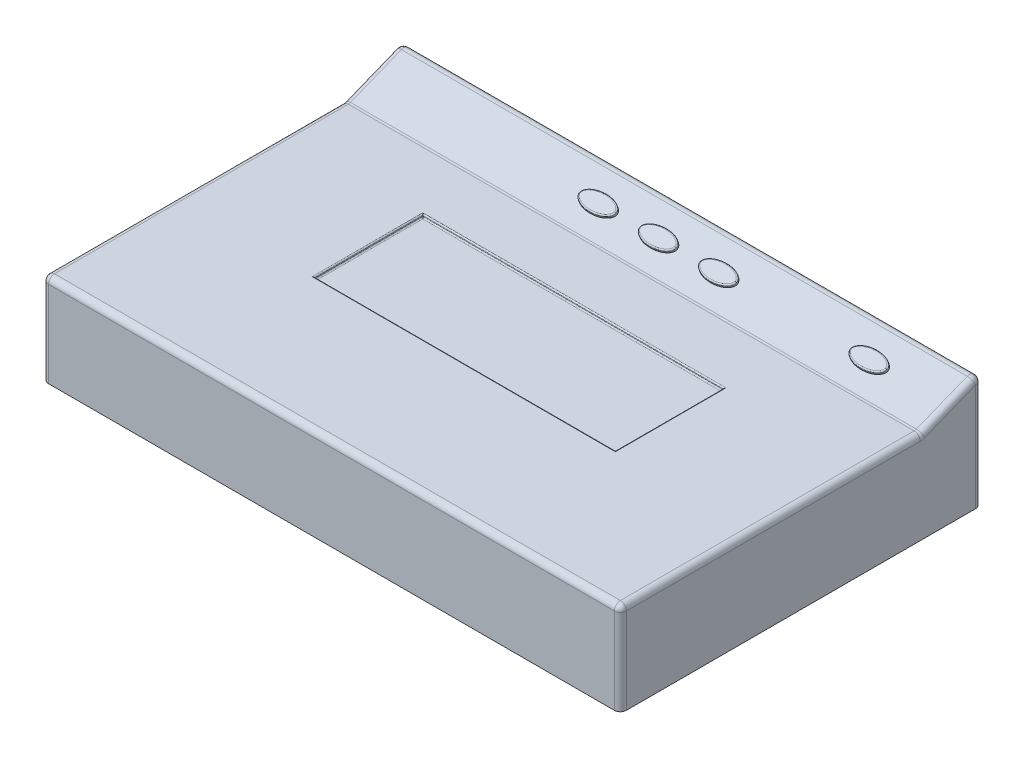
ISO-10303-21;
HEADER;
FILE_DESCRIPTION(('STEP AP214'),'2;1');
FILE_NAME('part.step','',(''),(''),'','','');
FILE_SCHEMA(('AUTOMOTIVE_DESIGN { 1 0 10303 214 1 1 1 1 }'));
ENDSEC;
DATA;
#1=APPLICATION_CONTEXT('core data for automotive mechanical design processes');
#2=APPLICATION_PROTOCOL_DEFINITION('international standard','automotive_design',2000,#1);
#3=PRODUCT_CONTEXT('',#1,'mechanical');
#4=PRODUCT('Part','Part','',(#3));
#5=PRODUCT_RELATED_PRODUCT_CATEGORY('part','',(#4));
#6=PRODUCT_DEFINITION_FORMATION('','',#4);
#7=PRODUCT_DEFINITION_CONTEXT('part definition',#1,'design');
#8=PRODUCT_DEFINITION('design','',#6,#7);
#9=PRODUCT_DEFINITION_SHAPE('','',#8);
#10=(LENGTH_UNIT() NAMED_UNIT(*) SI_UNIT(.MILLI.,.METRE.));
#11=(NAMED_UNIT(*) PLANE_ANGLE_UNIT() SI_UNIT($,.RADIAN.));
#12=(NAMED_UNIT(*) SI_UNIT($,.STERADIAN.) SOLID_ANGLE_UNIT());
#13=UNCERTAINTY_MEASURE_WITH_UNIT(LENGTH_MEASURE(1.E-05),#10,'distance_accuracy_value','');
#14=(GEOMETRIC_REPRESENTATION_CONTEXT(3) GLOBAL_UNCERTAINTY_ASSIGNED_CONTEXT((#13)) GLOBAL_UNIT_ASSIGNED_CONTEXT((#10,
#11,#12)) REPRESENTATION_CONTEXT('',''));
#15=CARTESIAN_POINT('',(0.,0.,0.));
#16=DIRECTION('',(0.,0.,1.));
#17=DIRECTION('',(1.,0.,0.));
#18=AXIS2_PLACEMENT_3D('',#15,#16,#17);
#19=CARTESIAN_POINT('',(0.,18.,0.));
#20=DIRECTION('',(0.,1.,0.));
#21=DIRECTION('',(0.,0.,1.));
#22=AXIS2_PLACEMENT_3D('',#19,#20,#21);
#23=PLANE('',#22);
#24=DIRECTION('',(0.,0.,1.));
#25=VECTOR('',#24,1.);
#26=CARTESIAN_POINT('',(-24.8,18.,-26.1788082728));
#27=LINE('',#26,#25);
#28=CARTESIAN_POINT('',(-24.8,18.,-34.9788082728));
#29=VERTEX_POINT('',#28);
#30=CARTESIAN_POINT('',(-24.8,18.,-17.3788082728));
#31=VERTEX_POINT('',#30);
#32=EDGE_CURVE('E989',#29,#31,#27,.T.);
#33=ORIENTED_EDGE('',*,*,#32,.T.);
#34=DIRECTION('',(1.,0.,0.));
#35=VECTOR('',#34,1.);
#36=CARTESIAN_POINT('',(0.,18.,-17.3788082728));
#37=LINE('',#36,#35);
#38=CARTESIAN_POINT('',(24.8,18.,-17.3788082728));
#39=VERTEX_POINT('',#38);
#40=EDGE_CURVE('E987',#31,#39,#37,.T.);
#41=ORIENTED_EDGE('',*,*,#40,.T.);
#42=DIRECTION('',(0.,0.,1.));
#43=VECTOR('',#42,1.);
#44=CARTESIAN_POINT('',(24.8,18.,-26.1788082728));
#45=LINE('',#44,#43);
#46=CARTESIAN_POINT('',(24.8,18.,-34.9788082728));
#47=VERTEX_POINT('',#46);
#48=EDGE_CURVE('E981',#39,#47,#45,.F.);
#49=ORIENTED_EDGE('',*,*,#48,.T.);
#50=DIRECTION('',(-1.,0.,0.));
#51=VECTOR('',#50,1.);
#52=CARTESIAN_POINT('',(0.,18.,-34.9788082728));
#53=LINE('',#52,#51);
#54=EDGE_CURVE('E817',#47,#29,#53,.T.);
#55=ORIENTED_EDGE('',*,*,#54,.T.);
#56=EDGE_LOOP('',(#33,#41,#49,#55));
#57=FACE_BOUND('',#56,.T.);
#58=ADVANCED_FACE('F17',(#57),#23,.T.);
#59=CARTESIAN_POINT('',(0.,0.895272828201,0.35810913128));
#60=DIRECTION('',(0.,0.928476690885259,0.371390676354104));
#61=DIRECTION('',(0.,-0.371390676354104,0.928476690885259));
#62=AXIS2_PLACEMENT_3D('',#59,#60,#61);
#63=PLANE('',#62);
#64=CARTESIAN_POINT('',(-2.8,20.7257218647,-49.21801346));
#65=CARTESIAN_POINT('',(-2.8,20.7756054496,-49.3427224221));
#66=CARTESIAN_POINT('',(-2.76002958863,20.8252850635,-49.466921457));
#67=CARTESIAN_POINT('',(-2.67356938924,20.8791262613,-49.6015244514));
#68=CARTESIAN_POINT('',(-2.44589624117,20.965850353,-49.8183346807));
#69=CARTESIAN_POINT('',(-2.11678606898,21.0401333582,-50.0040421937));
#70=CARTESIAN_POINT('',(-1.96668355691,21.067878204,-50.0734043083));
#71=CARTESIAN_POINT('',(-1.38923015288,21.1567934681,-50.2956924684));
#72=CARTESIAN_POINT('',(-0.698658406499,21.2059901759,-50.418684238));
#73=CARTESIAN_POINT('',(-0.181964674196,21.2199110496,-50.4534864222));
#74=CARTESIAN_POINT('',(0.716123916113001,21.2086911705,-50.4254367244));
#75=CARTESIAN_POINT('',(1.53962238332,21.1345404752,-50.2400599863));
#76=CARTESIAN_POINT('',(1.86398903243,21.0924715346,-50.1348876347));
#77=CARTESIAN_POINT('',(2.36320620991,20.9973984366,-49.8972048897));
#78=CARTESIAN_POINT('',(2.67351107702,20.8791104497,-49.6014849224));
#79=CARTESIAN_POINT('',(2.76002984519,20.8252847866,-49.4669207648));
#80=CARTESIAN_POINT('',(2.79999999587,20.7756055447,-49.34272266));
#81=CARTESIAN_POINT('',(2.80000000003,20.7257218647,-49.21801346));
#82=B_SPLINE_CURVE_WITH_KNOTS('',5,(#64,#65,#66,#67,#68,#69,#70,#71,#72,#73,#74,#75,#76,#77,#78,
#79,#80,#81),.UNSPECIFIED.,.F.,.F.,(6,3,3,3,3,6),(0.,2.15507803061,3.66454235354,7.56923170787,
10.4108999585,12.5659823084),.UNSPECIFIED.);
#83=CARTESIAN_POINT('',(2.800000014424,20.7257218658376,-49.218013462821));
#84=VERTEX_POINT('',#83);
#85=CARTESIAN_POINT('',(-2.8,20.7257218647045,-49.2180134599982));
#86=VERTEX_POINT('',#85);
#87=EDGE_CURVE('E793',#84,#86,#82,.F.);
#88=ORIENTED_EDGE('',*,*,#87,.T.);
#89=CARTESIAN_POINT('',(2.80000002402,20.7257218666,-49.2180134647));
#90=CARTESIAN_POINT('',(2.80000013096,20.6790400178,-49.1013088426));
#91=CARTESIAN_POINT('',(2.76481487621,20.6325415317,-48.9850626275));
#92=CARTESIAN_POINT('',(2.68993987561,20.5825979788,-48.8602037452));
#93=CARTESIAN_POINT('',(2.48368891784,20.4978312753,-48.6482869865));
#94=CARTESIAN_POINT('',(2.17724914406,20.4237121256,-48.4629891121));
#95=CARTESIAN_POINT('',(2.0288969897,20.3945084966,-48.3899800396));
#96=CARTESIAN_POINT('',(1.45497545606,20.3007884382,-48.1556798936));
#97=CARTESIAN_POINT('',(0.757399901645,20.247741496,-48.0230625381));
#98=CARTESIAN_POINT('',(0.233873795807,20.2318163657,-47.9832497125));
#99=CARTESIAN_POINT('',(-0.596543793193,20.2398422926,-48.0033145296));
#100=CARTESIAN_POINT('',(-1.36655835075,20.3014866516,-48.1574254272));
#101=CARTESIAN_POINT('',(-1.63431519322,20.330795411,-48.2306973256));
#102=CARTESIAN_POINT('',(-2.1831139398,20.413165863,-48.4366234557));
#103=CARTESIAN_POINT('',(-2.58285517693,20.5252854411,-48.716922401));
#104=CARTESIAN_POINT('',(-2.73495569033,20.5969677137,-48.8961280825));
#105=CARTESIAN_POINT('',(-2.8,20.6613463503,-49.0570746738));
#106=CARTESIAN_POINT('',(-2.8,20.7257218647,-49.21801346));
#107=B_SPLINE_CURVE_WITH_KNOTS('',5,(#89,#90,#91,#92,#93,#94,#95,#96,#97,#98,#99,#100,#101,#102,
#103,#104,#105,#106),.UNSPECIFIED.,.F.,.F.,(6,3,3,3,3,6),(0.,2.0167889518,3.55210089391,
7.51358107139,9.78476467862,12.5659252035),.UNSPECIFIED.);
#108=EDGE_CURVE('E1029',#84,#86,#107,.T.);
#109=ORIENTED_EDGE('',*,*,#108,.F.);
#110=EDGE_LOOP('',(#88,#109));
#111=FACE_BOUND('',#110,.T.);
#112=ADVANCED_FACE('F698',(#111),#63,.T.);
#113=CARTESIAN_POINT('',(0.,0.895272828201,0.35810913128));
#114=DIRECTION('',(0.,0.928476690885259,0.371390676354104));
#115=DIRECTION('',(0.,-0.371390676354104,0.928476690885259));
#116=AXIS2_PLACEMENT_3D('',#113,#114,#115);
#117=PLANE('',#116);
#118=CARTESIAN_POINT('',(-12.79998387,20.7190513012,-49.2013370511));
#119=CARTESIAN_POINT('',(-12.79998387,20.768934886,-49.3260460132));
#120=CARTESIAN_POINT('',(-12.7600134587,20.8186144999,-49.4502450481));
#121=CARTESIAN_POINT('',(-12.6735532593,20.8724556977,-49.5848480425));
#122=CARTESIAN_POINT('',(-12.4458801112,20.9591797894,-49.8016582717));
#123=CARTESIAN_POINT('',(-12.116769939,21.0334627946,-49.9873657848));
#124=CARTESIAN_POINT('',(-11.9666674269,21.0612076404,-50.0567278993));
#125=CARTESIAN_POINT('',(-11.3892140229,21.1501229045,-50.2790160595));
#126=CARTESIAN_POINT('',(-10.6986422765,21.1993196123,-50.4020078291));
#127=CARTESIAN_POINT('',(-10.1819485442,21.213240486,-50.4368100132));
#128=CARTESIAN_POINT('',(-9.28385995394,21.2020206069,-50.4087603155));
#129=CARTESIAN_POINT('',(-8.4603614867,21.1278699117,-50.2233835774));
#130=CARTESIAN_POINT('',(-8.1359948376,21.085800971,-50.1182112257));
#131=CARTESIAN_POINT('',(-7.63677766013,20.990727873,-49.8805284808));
#132=CARTESIAN_POINT('',(-7.32647279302,20.8724398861,-49.5848085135));
#133=CARTESIAN_POINT('',(-7.23995402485,20.818614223,-49.4502443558));
#134=CARTESIAN_POINT('',(-7.19998387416,20.7689349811,-49.326046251));
#135=CARTESIAN_POINT('',(-7.19998387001,20.7190513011,-49.201337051));
#136=B_SPLINE_CURVE_WITH_KNOTS('',5,(#118,#119,#120,#121,#122,#123,#124,#125,#126,#127,#128,
#129,#130,#131,#132,#133,#134,#135),.UNSPECIFIED.,.F.,.F.,(6,3,3,3,3,6),(0.,2.15507803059,
3.66454235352,7.56923170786,10.4108999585,12.5659823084),.UNSPECIFIED.);
#137=CARTESIAN_POINT('',(-7.199983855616,20.7190513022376,-49.201337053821));
#138=VERTEX_POINT('',#137);
#139=CARTESIAN_POINT('',(-12.79998387,20.7190513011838,-49.2013370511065));
#140=VERTEX_POINT('',#139);
#141=EDGE_CURVE('E684',#138,#140,#136,.F.);
#142=ORIENTED_EDGE('',*,*,#141,.T.);
#143=CARTESIAN_POINT('',(-7.19998384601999,20.719051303,-49.2013370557));
#144=CARTESIAN_POINT('',(-7.19998373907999,20.6723694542,-49.0846324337));
#145=CARTESIAN_POINT('',(-7.23516899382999,20.6258709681,-48.9683862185));
#146=CARTESIAN_POINT('',(-7.31004399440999,20.5759274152,-48.8435273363));
#147=CARTESIAN_POINT('',(-7.51629495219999,20.4911607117,-48.6316105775));
#148=CARTESIAN_POINT('',(-7.82273472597,20.417041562,-48.4463127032));
#149=CARTESIAN_POINT('',(-7.97108688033,20.387837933,-48.3733036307));
#150=CARTESIAN_POINT('',(-8.54500841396,20.2941178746,-48.1390034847));
#151=CARTESIAN_POINT('',(-9.24258396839,20.2410709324,-48.0063861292));
#152=CARTESIAN_POINT('',(-9.76611007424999,20.2251458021,-47.9665733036));
#153=CARTESIAN_POINT('',(-10.5965276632,20.233171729,-47.9866381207));
#154=CARTESIAN_POINT('',(-11.3665422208,20.294816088,-48.1407490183));
#155=CARTESIAN_POINT('',(-11.6342990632,20.3241248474,-48.2140209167));
#156=CARTESIAN_POINT('',(-12.1830978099,20.4064952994,-48.4199470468));
#157=CARTESIAN_POINT('',(-12.5828390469,20.5186148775,-48.700245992));
#158=CARTESIAN_POINT('',(-12.7349395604,20.5902971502,-48.8794516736));
#159=CARTESIAN_POINT('',(-12.79998387,20.6546757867,-49.0403982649));
#160=CARTESIAN_POINT('',(-12.79998387,20.7190513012,-49.2013370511));
#161=B_SPLINE_CURVE_WITH_KNOTS('',5,(#143,#144,#145,#146,#147,#148,#149,#150,#151,#152,#153,
#154,#155,#156,#157,#158,#159,#160),.UNSPECIFIED.,.F.,.F.,(6,3,3,3,3,6),(0.,2.0167889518,
3.55210089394,7.51358107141,9.78476467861,12.5659252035),.UNSPECIFIED.);
#162=EDGE_CURVE('E725',#138,#140,#161,.T.);
#163=ORIENTED_EDGE('',*,*,#162,.F.);
#164=EDGE_LOOP('',(#142,#163));
#165=FACE_BOUND('',#164,.T.);
#166=ADVANCED_FACE('F689',(#165),#117,.T.);
#167=CARTESIAN_POINT('',(0.,0.895272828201,0.35810913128));
#168=DIRECTION('',(0.,0.928476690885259,0.371390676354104));
#169=DIRECTION('',(0.,-0.371390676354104,0.928476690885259));
#170=AXIS2_PLACEMENT_3D('',#167,#168,#169);
#171=PLANE('',#170);
#172=CARTESIAN_POINT('',(12.8,20.7257218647,-49.21801346));
#173=CARTESIAN_POINT('',(12.8,20.6900647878,-49.1288707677));
#174=CARTESIAN_POINT('',(12.7791793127,20.6544907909,-49.0399357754));
#175=CARTESIAN_POINT('',(12.7367258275,20.6174620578,-48.9473639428));
#176=CARTESIAN_POINT('',(12.5606388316,20.5199461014,-48.7035740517));
#177=CARTESIAN_POINT('',(12.2352080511,20.4299688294,-48.4786308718));
#178=CARTESIAN_POINT('',(11.9882113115,20.382167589,-48.3591277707));
#179=CARTESIAN_POINT('',(11.4274832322,20.3017380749,-48.1580539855));
#180=CARTESIAN_POINT('',(10.7846043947,20.2570484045,-48.0463298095));
#181=CARTESIAN_POINT('',(10.4458963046,20.2436857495,-48.0129231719));
#182=CARTESIAN_POINT('',(9.69733350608,20.2346382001,-47.9903042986));
#183=CARTESIAN_POINT('',(8.96292873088,20.2699949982,-48.0786962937));
#184=CARTESIAN_POINT('',(8.58005582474,20.3015806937,-48.1576605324));
#185=CARTESIAN_POINT('',(7.90349510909,20.3906265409,-48.3802751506));
#186=CARTESIAN_POINT('',(7.42682528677,20.5210025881,-48.7062152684));
#187=CARTESIAN_POINT('',(7.26761624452,20.5942763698,-48.8893997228));
#188=CARTESIAN_POINT('',(7.2,20.6600281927,-49.05377928));
#189=CARTESIAN_POINT('',(7.2,20.7257218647,-49.21801346));
#190=B_SPLINE_CURVE_WITH_KNOTS('',5,(#172,#173,#174,#175,#176,#177,#178,#179,#180,#181,#182,
#183,#184,#185,#186,#187,#188,#189),.UNSPECIFIED.,.F.,.F.,(6,3,3,3,3,6),(0.,1.54046232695,
4.04073774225,6.64485350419,9.72751286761,12.5656206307),.UNSPECIFIED.);
#191=CARTESIAN_POINT('',(7.199999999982,20.7257218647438,-49.2180134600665));
#192=VERTEX_POINT('',#191);
#193=CARTESIAN_POINT('',(12.8,20.7257218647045,-49.2180134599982));
#194=VERTEX_POINT('',#193);
#195=EDGE_CURVE('E621',#192,#194,#190,.F.);
#196=ORIENTED_EDGE('',*,*,#195,.T.);
#197=CARTESIAN_POINT('',(7.19999999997,20.7257218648,-49.2180134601));
#198=CARTESIAN_POINT('',(7.20000000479,20.7756054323,-49.3427223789));
#199=CARTESIAN_POINT('',(7.23997046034,20.8252851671,-49.466921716));
#200=CARTESIAN_POINT('',(7.32643063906,20.8791262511,-49.6015244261));
#201=CARTESIAN_POINT('',(7.55410378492,20.9658503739,-49.8183347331));
#202=CARTESIAN_POINT('',(7.88321392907,21.0401333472,-50.0040421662));
#203=CARTESIAN_POINT('',(8.03331644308,21.067878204,-50.0734043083));
#204=CARTESIAN_POINT('',(8.61076984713,21.1567934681,-50.2956924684));
#205=CARTESIAN_POINT('',(9.30134159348,21.2059901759,-50.418684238));
#206=CARTESIAN_POINT('',(9.81803532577,21.2199110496,-50.4534864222));
#207=CARTESIAN_POINT('',(10.7161239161,21.2086911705,-50.4254367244));
#208=CARTESIAN_POINT('',(11.5396223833,21.1345404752,-50.2400599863));
#209=CARTESIAN_POINT('',(11.8639890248,21.0924715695,-50.1348877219));
#210=CARTESIAN_POINT('',(12.3632062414,20.9973984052,-49.8972048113));
#211=CARTESIAN_POINT('',(12.6735111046,20.8791104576,-49.6014849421));
#212=CARTESIAN_POINT('',(12.7600298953,20.8252846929,-49.4669205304));
#213=CARTESIAN_POINT('',(12.8,20.7756055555,-49.3427226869));
#214=CARTESIAN_POINT('',(12.8,20.7257218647,-49.21801346));
#215=B_SPLINE_CURVE_WITH_KNOTS('',5,(#197,#198,#199,#200,#201,#202,#203,#204,#205,#206,#207,
#208,#209,#210,#211,#212,#213,#214),.UNSPECIFIED.,.F.,.F.,(6,3,3,3,3,6),(12.565807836,
14.7208856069,16.2303499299,20.1350392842,22.9767075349,25.1317901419),.UNSPECIFIED.);
#216=EDGE_CURVE('E1156',#194,#192,#215,.F.);
#217=ORIENTED_EDGE('',*,*,#216,.T.);
#218=EDGE_LOOP('',(#196,#217));
#219=FACE_BOUND('',#218,.T.);
#220=ADVANCED_FACE('F522',(#219),#171,.T.);
#221=CARTESIAN_POINT('',(0.,0.895272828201,0.35810913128));
#222=DIRECTION('',(0.,0.928476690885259,0.371390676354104));
#223=DIRECTION('',(0.,-0.371390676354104,0.928476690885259));
#224=AXIS2_PLACEMENT_3D('',#221,#222,#223);
#225=PLANE('',#224);
#226=CARTESIAN_POINT('',(32.2,20.7257218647,-49.21801346));
#227=CARTESIAN_POINT('',(32.2,20.7756054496,-49.3427224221));
#228=CARTESIAN_POINT('',(32.2399704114,20.8252850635,-49.466921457));
#229=CARTESIAN_POINT('',(32.3264306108,20.8791262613,-49.6015244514));
#230=CARTESIAN_POINT('',(32.5541037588,20.965850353,-49.8183346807));
#231=CARTESIAN_POINT('',(32.883213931,21.0401333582,-50.0040421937));
#232=CARTESIAN_POINT('',(33.0333164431,21.067878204,-50.0734043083));
#233=CARTESIAN_POINT('',(33.6107698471,21.1567934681,-50.2956924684));
#234=CARTESIAN_POINT('',(34.3013415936,21.2059901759,-50.4186842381));
#235=CARTESIAN_POINT('',(34.8180353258,21.2199110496,-50.4534864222));
#236=CARTESIAN_POINT('',(35.7161239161,21.2086911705,-50.4254367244));
#237=CARTESIAN_POINT('',(36.5396223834,21.1345404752,-50.2400599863));
#238=CARTESIAN_POINT('',(36.8639890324,21.0924715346,-50.1348876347));
#239=CARTESIAN_POINT('',(37.3632062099,20.9973984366,-49.8972048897));
#240=CARTESIAN_POINT('',(37.673511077,20.8791104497,-49.6014849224));
#241=CARTESIAN_POINT('',(37.7600298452,20.8252847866,-49.4669207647));
#242=CARTESIAN_POINT('',(37.7999999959,20.7756055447,-49.34272266));
#243=CARTESIAN_POINT('',(37.8,20.7257218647,-49.21801346));
#244=B_SPLINE_CURVE_WITH_KNOTS('',5,(#226,#227,#228,#229,#230,#231,#232,#233,#234,#235,#236,
#237,#238,#239,#240,#241,#242,#243),.UNSPECIFIED.,.F.,.F.,(6,3,3,3,3,6),(0.,2.15507803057,
3.66454235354,7.56923170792,10.4108999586,12.5659823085),.UNSPECIFIED.);
#245=CARTESIAN_POINT('',(37.8000000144,20.7257218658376,-49.218013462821));
#246=VERTEX_POINT('',#245);
#247=CARTESIAN_POINT('',(32.2,20.7257218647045,-49.2180134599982));
#248=VERTEX_POINT('',#247);
#249=EDGE_CURVE('E545',#246,#248,#244,.F.);
#250=ORIENTED_EDGE('',*,*,#249,.T.);
#251=CARTESIAN_POINT('',(37.800000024,20.7257218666,-49.2180134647));
#252=CARTESIAN_POINT('',(37.800000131,20.6790400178,-49.1013088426));
#253=CARTESIAN_POINT('',(37.7648148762,20.6325415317,-48.9850626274));
#254=CARTESIAN_POINT('',(37.6899398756,20.5825979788,-48.8602037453));
#255=CARTESIAN_POINT('',(37.4836889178,20.4978312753,-48.6482869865));
#256=CARTESIAN_POINT('',(37.1772491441,20.4237121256,-48.4629891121));
#257=CARTESIAN_POINT('',(37.0288969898,20.3945084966,-48.3899800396));
#258=CARTESIAN_POINT('',(36.454975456,20.3007884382,-48.1556798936));
#259=CARTESIAN_POINT('',(35.7573999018,20.247741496,-48.0230625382));
#260=CARTESIAN_POINT('',(35.2338737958,20.2318163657,-47.9832497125));
#261=CARTESIAN_POINT('',(34.4034562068,20.2398422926,-48.0033145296));
#262=CARTESIAN_POINT('',(33.6334416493,20.3014866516,-48.1574254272));
#263=CARTESIAN_POINT('',(33.3656848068,20.3307954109,-48.2306973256));
#264=CARTESIAN_POINT('',(32.8168860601,20.413165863,-48.4366234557));
#265=CARTESIAN_POINT('',(32.4171448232,20.5252854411,-48.7169224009));
#266=CARTESIAN_POINT('',(32.2650443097,20.5969677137,-48.8961280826));
#267=CARTESIAN_POINT('',(32.2,20.6613463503,-49.0570746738));
#268=CARTESIAN_POINT('',(32.2,20.7257218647,-49.21801346));
#269=B_SPLINE_CURVE_WITH_KNOTS('',5,(#251,#252,#253,#254,#255,#256,#257,#258,#259,#260,#261,
#262,#263,#264,#265,#266,#267,#268),.UNSPECIFIED.,.F.,.F.,(6,3,3,3,3,6),(0.,2.0167889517,
3.55210089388,7.5135810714,9.78476467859,12.5659252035),.UNSPECIFIED.);
#270=EDGE_CURVE('E161',#246,#248,#269,.T.);
#271=ORIENTED_EDGE('',*,*,#270,.F.);
#272=EDGE_LOOP('',(#250,#271));
#273=FACE_BOUND('',#272,.T.);
#274=ADVANCED_FACE('F517',(#273),#225,.T.);
#275=CARTESIAN_POINT('',(-24.8,18.2,-26.1788082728));
#276=DIRECTION('',(0.,0.,1.));
#277=DIRECTION('',(1.,0.,0.));
#278=AXIS2_PLACEMENT_3D('',#275,#276,#277);
#279=CYLINDRICAL_SURFACE('',#278,0.2);
#280=CARTESIAN_POINT('',(-24.8,18.2,-17.3788082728));
#281=DIRECTION('',(0.707106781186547,0.,0.707106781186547));
#282=DIRECTION('',(0.707106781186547,0.,-0.707106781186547));
#283=AXIS2_PLACEMENT_3D('',#280,#281,#282);
#284=ELLIPSE('',#283,0.282842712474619,0.2);
#285=CARTESIAN_POINT('',(-25.,18.2,-17.1788082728));
#286=VERTEX_POINT('',#285);
#287=EDGE_CURVE('E152',#286,#31,#284,.T.);
#288=ORIENTED_EDGE('',*,*,#287,.T.);
#289=ORIENTED_EDGE('',*,*,#32,.F.);
#290=CARTESIAN_POINT('',(-24.8,18.2,-34.9788082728));
#291=DIRECTION('',(-0.707106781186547,0.,0.707106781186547));
#292=DIRECTION('',(0.707106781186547,0.,0.707106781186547));
#293=AXIS2_PLACEMENT_3D('',#290,#291,#292);
#294=ELLIPSE('',#293,0.282842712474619,0.2);
#295=CARTESIAN_POINT('',(-25.,18.2,-35.1788082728));
#296=VERTEX_POINT('',#295);
#297=EDGE_CURVE('E1033',#29,#296,#294,.F.);
#298=ORIENTED_EDGE('',*,*,#297,.T.);
#299=DIRECTION('',(0.,0.,-1.));
#300=VECTOR('',#299,1.);
#301=CARTESIAN_POINT('',(-25.,18.2,-35.1788082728));
#302=LINE('',#301,#300);
#303=EDGE_CURVE('E965',#286,#296,#302,.T.);
#304=ORIENTED_EDGE('',*,*,#303,.F.);
#305=EDGE_LOOP('',(#288,#289,#298,#304));
#306=FACE_BOUND('',#305,.T.);
#307=ADVANCED_FACE('F514',(#306),#279,.F.);
#308=CARTESIAN_POINT('',(0.,18.2,-17.3788082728));
#309=DIRECTION('',(1.,0.,0.));
#310=DIRECTION('',(0.,0.,-1.));
#311=AXIS2_PLACEMENT_3D('',#308,#309,#310);
#312=CYLINDRICAL_SURFACE('',#311,0.2);
#313=CARTESIAN_POINT('',(24.8,18.2,-17.3788082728));
#314=DIRECTION('',(-0.707106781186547,0.,0.707106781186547));
#315=DIRECTION('',(0.707106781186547,0.,0.707106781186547));
#316=AXIS2_PLACEMENT_3D('',#313,#314,#315);
#317=ELLIPSE('',#316,0.282842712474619,0.2);
#318=CARTESIAN_POINT('',(25.,18.2,-17.1788082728));
#319=VERTEX_POINT('',#318);
#320=EDGE_CURVE('E984',#319,#39,#317,.F.);
#321=ORIENTED_EDGE('',*,*,#320,.T.);
#322=ORIENTED_EDGE('',*,*,#40,.F.);
#323=ORIENTED_EDGE('',*,*,#287,.F.);
#324=DIRECTION('',(1.,0.,0.));
#325=VECTOR('',#324,1.);
#326=CARTESIAN_POINT('',(25.,18.2,-17.1788082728));
#327=LINE('',#326,#325);
#328=EDGE_CURVE('E977',#286,#319,#327,.T.);
#329=ORIENTED_EDGE('',*,*,#328,.T.);
#330=EDGE_LOOP('',(#321,#322,#323,#329));
#331=FACE_BOUND('',#330,.T.);
#332=ADVANCED_FACE('F510',(#331),#312,.F.);
#333=CARTESIAN_POINT('',(24.8,18.2,-26.1788082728));
#334=DIRECTION('',(0.,0.,1.));
#335=DIRECTION('',(1.,0.,0.));
#336=AXIS2_PLACEMENT_3D('',#333,#334,#335);
#337=CYLINDRICAL_SURFACE('',#336,0.2);
#338=CARTESIAN_POINT('',(24.8,18.2,-34.9788082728));
#339=DIRECTION('',(-0.707106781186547,0.,-0.707106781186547));
#340=DIRECTION('',(-0.707106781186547,0.,0.707106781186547));
#341=AXIS2_PLACEMENT_3D('',#338,#339,#340);
#342=ELLIPSE('',#341,0.282842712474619,0.2);
#343=CARTESIAN_POINT('',(25.,18.2,-35.1788082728));
#344=VERTEX_POINT('',#343);
#345=EDGE_CURVE('E983',#344,#47,#342,.T.);
#346=ORIENTED_EDGE('',*,*,#345,.T.);
#347=ORIENTED_EDGE('',*,*,#48,.F.);
#348=ORIENTED_EDGE('',*,*,#320,.F.);
#349=DIRECTION('',(0.,0.,1.));
#350=VECTOR('',#349,1.);
#351=CARTESIAN_POINT('',(25.,18.2,-17.1788082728));
#352=LINE('',#351,#350);
#353=EDGE_CURVE('E980',#344,#319,#352,.T.);
#354=ORIENTED_EDGE('',*,*,#353,.F.);
#355=EDGE_LOOP('',(#346,#347,#348,#354));
#356=FACE_BOUND('',#355,.T.);
#357=ADVANCED_FACE('F506',(#356),#337,.F.);
#358=CARTESIAN_POINT('',(0.,18.2,-34.9788082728));
#359=DIRECTION('',(-1.,0.,0.));
#360=DIRECTION('',(0.,0.,1.));
#361=AXIS2_PLACEMENT_3D('',#358,#359,#360);
#362=CYLINDRICAL_SURFACE('',#361,0.2);
#363=ORIENTED_EDGE('',*,*,#297,.F.);
#364=ORIENTED_EDGE('',*,*,#54,.F.);
#365=ORIENTED_EDGE('',*,*,#345,.F.);
#366=DIRECTION('',(-1.,0.,0.));
#367=VECTOR('',#366,1.);
#368=CARTESIAN_POINT('',(-25.,18.2,-35.1788082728));
#369=LINE('',#368,#367);
#370=EDGE_CURVE('E1048',#344,#296,#369,.T.);
#371=ORIENTED_EDGE('',*,*,#370,.T.);
#372=EDGE_LOOP('',(#363,#364,#365,#371));
#373=FACE_BOUND('',#372,.T.);
#374=ADVANCED_FACE('F502',(#373),#362,.F.);
#375=CARTESIAN_POINT('',(-3.,20.5400265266,-49.2922915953));
#376=CARTESIAN_POINT('',(-3.,20.5983644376,-49.2689564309));
#377=CARTESIAN_POINT('',(-2.975325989,20.6567023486,-49.2456212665));
#378=CARTESIAN_POINT('',(-2.92566370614,20.7028126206,-49.2271771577));
#379=CARTESIAN_POINT('',(-2.86283185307,20.7257218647,-49.21801346));
#380=CARTESIAN_POINT('',(-2.8,20.7257218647,-49.21801346));
#381=CARTESIAN_POINT('',(-3.,20.4522417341,-49.0728296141));
#382=CARTESIAN_POINT('',(-3.,20.5105796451,-49.0494944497));
#383=CARTESIAN_POINT('',(-2.975325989,20.5718055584,-49.033379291));
#384=CARTESIAN_POINT('',(-2.92566370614,20.623728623,-49.0294671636));
#385=CARTESIAN_POINT('',(-2.86283185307,20.6539921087,-49.0386890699));
#386=CARTESIAN_POINT('',(-2.8,20.6613463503,-49.0570746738));
#387=CARTESIAN_POINT('',(-2.9066521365,20.3642866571,-48.8529419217));
#388=CARTESIAN_POINT('',(-2.90665212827,20.4226245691,-48.8296067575));
#389=CARTESIAN_POINT('',(-2.88546992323,20.4867591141,-48.8207631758));
#390=CARTESIAN_POINT('',(-2.84283573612,20.5445364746,-48.8314867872));
#391=CARTESIAN_POINT('',(-2.78889571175,20.5822067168,-48.8592255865));
#392=CARTESIAN_POINT('',(-2.73495569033,20.5969677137,-48.8961280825));
#393=CARTESIAN_POINT('',(-2.72106408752,20.2846695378,-48.6538991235));
#394=CARTESIAN_POINT('',(-2.72106405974,20.3430074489,-48.6305639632));
#395=CARTESIAN_POINT('',(-2.70401320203,20.4081209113,-48.6241676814));
#396=CARTESIAN_POINT('',(-2.66969435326,20.4678685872,-48.6398170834));
#397=CARTESIAN_POINT('',(-2.62627476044,20.5080316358,-48.6737878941));
#398=CARTESIAN_POINT('',(-2.58285517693,20.5252854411,-48.716922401));
#399=CARTESIAN_POINT('',(-2.27892461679,20.1607508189,-48.3441023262));
#400=CARTESIAN_POINT('',(-2.27892463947,20.2190887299,-48.3207671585));
#401=CARTESIAN_POINT('',(-2.26710448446,20.2856578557,-48.3180100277));
#402=CARTESIAN_POINT('',(-2.24331359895,20.3483353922,-48.3409840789));
#403=CARTESIAN_POINT('',(-2.21321377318,20.3922052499,-48.3842219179));
#404=CARTESIAN_POINT('',(-2.1831139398,20.413165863,-48.4366234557));
#405=CARTESIAN_POINT('',(-1.69705470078,20.0745633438,-48.1286336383));
#406=CARTESIAN_POINT('',(-1.69705468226,20.1329012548,-48.1052984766));
#407=CARTESIAN_POINT('',(-1.68931449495,20.1999412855,-48.103718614));
#408=CARTESIAN_POINT('',(-1.67373555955,20.2635666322,-48.1290621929));
#409=CARTESIAN_POINT('',(-1.65402537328,20.3086356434,-48.1752979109));
#410=CARTESIAN_POINT('',(-1.63431519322,20.330795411,-48.2306973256));
#411=CARTESIAN_POINT('',(-1.41732494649,20.0437305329,-48.0515516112));
#412=CARTESIAN_POINT('',(-1.41732509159,20.1020684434,-48.0282164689));
#413=CARTESIAN_POINT('',(-1.41106210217,20.1692964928,-48.0271066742));
#414=CARTESIAN_POINT('',(-1.39845617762,20.2333002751,-48.0533963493));
#415=CARTESIAN_POINT('',(-1.38250729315,20.2788480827,-48.100829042));
#416=CARTESIAN_POINT('',(-1.36655835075,20.3014866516,-48.1574254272));
#417=CARTESIAN_POINT('',(-0.615676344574,19.9796480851,-47.8913454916));
#418=CARTESIAN_POINT('',(-0.615676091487,20.0379859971,-47.8680102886));
#419=CARTESIAN_POINT('',(-0.613315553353,20.1055148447,-47.8676524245));
#420=CARTESIAN_POINT('',(-0.608564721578,20.1701240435,-47.895455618));
#421=CARTESIAN_POINT('',(-0.602554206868,20.2164377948,-47.9448032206));
#422=CARTESIAN_POINT('',(-0.596543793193,20.2398422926,-48.0033145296));
#423=CARTESIAN_POINT('',(0.241644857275,19.9715111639,-47.8710031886));
#424=CARTESIAN_POINT('',(0.24164441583,20.0298490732,-47.8476680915));
#425=CARTESIAN_POINT('',(0.240685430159,20.0973915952,-47.8473445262));
#426=CARTESIAN_POINT('',(0.238755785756,20.1620283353,-47.8752166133));
#427=CARTESIAN_POINT('',(0.236314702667,20.2083769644,-47.9246513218));
#428=CARTESIAN_POINT('',(0.233873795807,20.2318163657,-47.9832497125));
#429=CARTESIAN_POINT('',(0.782725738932,19.9880247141,-47.9122870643));
#430=CARTESIAN_POINT('',(0.782725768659,20.0463626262,-47.888951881));
#431=CARTESIAN_POINT('',(0.779601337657,20.1138325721,-47.8884467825));
#432=CARTESIAN_POINT('',(0.773312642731,20.1783232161,-47.9159535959));
#433=CARTESIAN_POINT('',(0.765356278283,20.2244869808,-47.9649262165));
#434=CARTESIAN_POINT('',(0.757399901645,20.247741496,-48.0230625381));
#435=CARTESIAN_POINT('',(1.50654968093,20.0423931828,-48.0482082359));
#436=CARTESIAN_POINT('',(1.50654966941,20.1007310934,-48.0248730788));
#437=CARTESIAN_POINT('',(1.50018694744,20.1680379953,-48.0239603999));
#438=CARTESIAN_POINT('',(1.48738047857,20.2322004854,-48.0506468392));
#439=CARTESIAN_POINT('',(1.47117796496,20.2779490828,-48.0985815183));
#440=CARTESIAN_POINT('',(1.45497545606,20.3007884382,-48.1556798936));
#441=CARTESIAN_POINT('',(2.11697357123,20.1419189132,-48.2970225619));
#442=CARTESIAN_POINT('',(2.1169735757,20.2002568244,-48.2736873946));
#443=CARTESIAN_POINT('',(2.10610756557,20.2668474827,-48.2709840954));
#444=CARTESIAN_POINT('',(2.08423714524,20.32956836,-48.2940664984));
#445=CARTESIAN_POINT('',(2.05656706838,20.3734930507,-48.3374414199));
#446=CARTESIAN_POINT('',(2.0288969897,20.3945084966,-48.3899800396));
#447=CARTESIAN_POINT('',(2.2762989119,20.1732402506,-48.3753259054));
#448=CARTESIAN_POINT('',(2.27629889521,20.2315781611,-48.3519907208));
#449=CARTESIAN_POINT('',(2.26407910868,20.2979075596,-48.3486342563));
#450=CARTESIAN_POINT('',(2.23948391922,20.360102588,-48.3704020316));
#451=CARTESIAN_POINT('',(2.20836652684,20.4033619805,-48.41211372));
#452=CARTESIAN_POINT('',(2.17724914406,20.4237121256,-48.4629891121));
#453=CARTESIAN_POINT('',(2.61221020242,20.2539305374,-48.5770516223));
#454=CARTESIAN_POINT('',(2.61221022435,20.3122684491,-48.5537164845));
#455=CARTESIAN_POINT('',(2.59635456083,20.3777871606,-48.548333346));
#456=CARTESIAN_POINT('',(2.5644412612,20.4383504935,-48.5660218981));
#457=CARTESIAN_POINT('',(2.52406509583,20.4795455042,-48.6025725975));
#458=CARTESIAN_POINT('',(2.48368891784,20.4978312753,-48.6482869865));
#459=CARTESIAN_POINT('',(2.85294822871,20.3519646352,-48.8221368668));
#460=CARTESIAN_POINT('',(2.8529481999,20.4103025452,-48.7988016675));
#461=CARTESIAN_POINT('',(2.83283783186,20.4741844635,-48.7893264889));
#462=CARTESIAN_POINT('',(2.79236099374,20.5314533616,-48.7987789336));
#463=CARTESIAN_POINT('',(2.74115042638,20.5684802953,-48.8249094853));
#464=CARTESIAN_POINT('',(2.68993987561,20.5825979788,-48.8602037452));
#465=CARTESIAN_POINT('',(2.95105367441,20.4126763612,-48.9739161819));
#466=CARTESIAN_POINT('',(2.95105369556,20.4710142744,-48.9505810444));
#467=CARTESIAN_POINT('',(2.92807741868,20.5335677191,-48.9377847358));
#468=CARTESIAN_POINT('',(2.88183220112,20.5881627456,-48.9405525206));
#469=CARTESIAN_POINT('',(2.8233235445,20.621806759,-48.9582257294));
#470=CARTESIAN_POINT('',(2.76481487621,20.6325415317,-48.9850626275));
#471=CARTESIAN_POINT('',(3.00000007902,20.476369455,-49.1331489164));
#472=CARTESIAN_POINT('',(3.00000007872,20.5347073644,-49.1098137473));
#473=CARTESIAN_POINT('',(2.9753260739,20.5951395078,-49.091714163));
#474=CARTESIAN_POINT('',(2.92566380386,20.6454649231,-49.0838079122));
#475=CARTESIAN_POINT('',(2.86283196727,20.6737070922,-49.0879765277));
#476=CARTESIAN_POINT('',(2.80000013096,20.6790400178,-49.1013088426));
#477=CARTESIAN_POINT('',(3.00000001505,20.5400265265,-49.2922915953));
#478=CARTESIAN_POINT('',(3.00000001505,20.5983644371,-49.2689564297));
#479=CARTESIAN_POINT('',(2.97532600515,20.656702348,-49.2456212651));
#480=CARTESIAN_POINT('',(2.92566372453,20.7028126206,-49.2271771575));
#481=CARTESIAN_POINT('',(2.86283187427,20.7257218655,-49.218013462));
#482=CARTESIAN_POINT('',(2.80000002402,20.7257218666,-49.2180134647));
#483=B_SPLINE_SURFACE_WITH_KNOTS('',5,5,((#375,#376,#377,#378,#379,#380),(#381,#382,#383,#384,
#385,#386),(#387,#388,#389,#390,#391,#392),(#393,#394,#395,#396,#397,#398),(#399,#400,#401,#402,
#403,#404),(#405,#406,#407,#408,#409,#410),(#411,#412,#413,#414,#415,#416),(#417,#418,#419,#420,
#421,#422),(#423,#424,#425,#426,#427,#428),(#429,#430,#431,#432,#433,#434),(#435,#436,#437,#438,
#439,#440),(#441,#442,#443,#444,#445,#446),(#447,#448,#449,#450,#451,#452),(#453,#454,#455,#456,
#457,#458),(#459,#460,#461,#462,#463,#464),(#465,#466,#467,#468,#469,#470),(#471,#472,#473,#474,
#475,#476),(#477,#478,#479,#480,#481,#482)),.UNSPECIFIED.,.F.,.F.,.F.,(6,3,3,3,3,6),(6,6),(0.,
2.78116052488,5.05234413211,9.01382430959,10.5491362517,12.5659252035),(0.,0.2),.UNSPECIFIED.);
#484=CARTESIAN_POINT('',(3.00000000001,20.5400265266,-49.2922915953));
#485=CARTESIAN_POINT('',(3.00000000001,20.5983644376,-49.2689564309));
#486=CARTESIAN_POINT('',(2.97532598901,20.6567023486,-49.2456212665));
#487=CARTESIAN_POINT('',(2.92566370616,20.7028126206,-49.2271771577));
#488=CARTESIAN_POINT('',(2.86283185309,20.7257218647,-49.21801346));
#489=CARTESIAN_POINT('',(2.80000000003,20.7257218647,-49.21801346));
#490=B_SPLINE_CURVE_WITH_KNOTS('',5,(#484,#485,#486,#487,#488,#489),.UNSPECIFIED.,.F.,.F.,(6,6),
(0.,0.2),.UNSPECIFIED.);
#491=CARTESIAN_POINT('',(3.00000000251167,20.5400265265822,-49.2922915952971));
#492=VERTEX_POINT('',#491);
#493=EDGE_CURVE('E792',#492,#84,#490,.T.);
#494=CARTESIAN_POINT('',(-3.,20.5400265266,-49.2922915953));
#495=CARTESIAN_POINT('',(-3.,20.5983644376,-49.2689564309));
#496=CARTESIAN_POINT('',(-2.975325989,20.6567023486,-49.2456212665));
#497=CARTESIAN_POINT('',(-2.92566370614,20.7028126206,-49.2271771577));
#498=CARTESIAN_POINT('',(-2.86283185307,20.7257218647,-49.21801346));
#499=CARTESIAN_POINT('',(-2.8,20.7257218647,-49.21801346));
#500=B_SPLINE_CURVE_WITH_KNOTS('',5,(#494,#495,#496,#497,#498,#499),.UNSPECIFIED.,.F.,.F.,(6,6),
(0.,0.2),.UNSPECIFIED.);
#501=CARTESIAN_POINT('',(-3.,20.5400265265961,-49.2922915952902));
#502=VERTEX_POINT('',#501);
#503=EDGE_CURVE('E784',#86,#502,#500,.F.);
#504=CARTESIAN_POINT('',(3.,20.5400265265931,-49.2922915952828));
#505=CARTESIAN_POINT('',(3.,19.9829405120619,-47.8995765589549));
#506=CARTESIAN_POINT('',(0.,19.9829405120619,-47.8995765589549));
#507=CARTESIAN_POINT('',(-3.,19.9829405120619,-47.8995765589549));
#508=CARTESIAN_POINT('',(-3.,20.5400265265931,-49.2922915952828));
#509=(BOUNDED_CURVE() B_SPLINE_CURVE(2,(#504,#505,#506,#507,#508),.UNSPECIFIED.,.F.,
.F.) B_SPLINE_CURVE_WITH_KNOTS((3,2,3),(0.,1.5707963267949,3.14159265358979),
.UNSPECIFIED.) CURVE() GEOMETRIC_REPRESENTATION_ITEM() RATIONAL_B_SPLINE_CURVE((1.,
0.707106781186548,1.,0.707106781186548,1.)) REPRESENTATION_ITEM(''));
#510=EDGE_CURVE('E813',#492,#502,#509,.T.);
#511=ORIENTED_EDGE('',*,*,#493,.T.);
#512=ORIENTED_EDGE('',*,*,#108,.T.);
#513=ORIENTED_EDGE('',*,*,#503,.T.);
#514=ORIENTED_EDGE('',*,*,#510,.F.);
#515=EDGE_LOOP('',(#511,#512,#513,#514));
#516=FACE_BOUND('',#515,.T.);
#517=ADVANCED_FACE('F505',(#516),#483,.T.);
#518=CARTESIAN_POINT('',(-3.,20.5400265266,-49.2922915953));
#519=CARTESIAN_POINT('',(-3.,20.5983644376,-49.2689564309));
#520=CARTESIAN_POINT('',(-2.975325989,20.6567023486,-49.2456212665));
#521=CARTESIAN_POINT('',(-2.92566370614,20.7028126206,-49.2271771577));
#522=CARTESIAN_POINT('',(-2.86283185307,20.7257218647,-49.21801346));
#523=CARTESIAN_POINT('',(-2.8,20.7257218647,-49.21801346));
#524=CARTESIAN_POINT('',(-3.,20.6080495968,-49.4623492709));
#525=CARTESIAN_POINT('',(-3.,20.6663875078,-49.4390141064));
#526=CARTESIAN_POINT('',(-2.975325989,20.7224875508,-49.410084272));
#527=CARTESIAN_POINT('',(-2.92566370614,20.7640935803,-49.3803795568));
#528=CARTESIAN_POINT('',(-2.86283185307,20.781304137,-49.3569691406));
#529=CARTESIAN_POINT('',(-2.8,20.7756054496,-49.3427224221));
#530=CARTESIAN_POINT('',(-2.94409884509,20.6761203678,-49.6325261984));
#531=CARTESIAN_POINT('',(-2.94409882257,20.7344582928,-49.6091910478));
#532=CARTESIAN_POINT('',(-2.92139017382,20.7882894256,-49.5745889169));
#533=CARTESIAN_POINT('',(-2.87568367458,20.8253287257,-49.5334673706));
#534=CARTESIAN_POINT('',(-2.81785662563,20.8367615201,-49.4956125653));
#535=CARTESIAN_POINT('',(-2.76002958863,20.8252850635,-49.466921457));
#536=CARTESIAN_POINT('',(-2.8321105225,20.7405144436,-49.7935113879));
#537=CARTESIAN_POINT('',(-2.8321105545,20.7988523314,-49.7701761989));
#538=CARTESIAN_POINT('',(-2.81255134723,20.851381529,-49.7323192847));
#539=CARTESIAN_POINT('',(-2.773183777,20.8858004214,-49.6846467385));
#540=CARTESIAN_POINT('',(-2.723376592,20.8939179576,-49.6385037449));
#541=CARTESIAN_POINT('',(-2.67356938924,20.8791262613,-49.6015244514));
#542=CARTESIAN_POINT('',(-2.5695233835,20.8397581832,-50.0416207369));
#543=CARTESIAN_POINT('',(-2.56952336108,20.8980961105,-50.0182855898));
#544=CARTESIAN_POINT('',(-2.55427145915,20.9490807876,-49.9765673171));
#545=CARTESIAN_POINT('',(-2.52357342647,20.9803909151,-49.9211228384));
#546=CARTESIAN_POINT('',(-2.4847348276,20.9845752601,-49.8651469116));
#547=CARTESIAN_POINT('',(-2.44589624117,20.965850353,-49.8183346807));
#548=CARTESIAN_POINT('',(-2.21105460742,20.9201443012,-50.2425860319));
#549=CARTESIAN_POINT('',(-2.21105462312,20.9784822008,-50.2192508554));
#550=CARTESIAN_POINT('',(-2.19942471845,21.0287139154,-50.1756502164));
#551=CARTESIAN_POINT('',(-2.17601676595,21.0585085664,-50.1164170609));
#552=CARTESIAN_POINT('',(-2.14640142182,21.0607755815,-50.0556477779));
#553=CARTESIAN_POINT('',(-2.11678606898,21.0401333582,-50.0040421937));
#554=CARTESIAN_POINT('',(-2.05052736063,20.9498016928,-50.3167295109));
#555=CARTESIAN_POINT('',(-2.05052735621,21.0081396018,-50.2933943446));
#556=CARTESIAN_POINT('',(-2.04018353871,21.0581353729,-50.2492038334));
#557=CARTESIAN_POINT('',(-2.0193641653,21.0874551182,-50.1887834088));
#558=CARTESIAN_POINT('',(-1.9930238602,21.0891212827,-50.1265120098));
#559=CARTESIAN_POINT('',(-1.96668355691,21.067878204,-50.0734043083));
#560=CARTESIAN_POINT('',(-1.43813240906,21.0439666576,-50.5521419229));
#561=CARTESIAN_POINT('',(-1.43813242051,21.1023045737,-50.5288067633));
#562=CARTESIAN_POINT('',(-1.43209935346,21.1516526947,-50.4829971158));
#563=CARTESIAN_POINT('',(-1.4199563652,21.1796688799,-50.419317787));
#564=CARTESIAN_POINT('',(-1.40459326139,21.1796857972,-50.3529232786));
#565=CARTESIAN_POINT('',(-1.38923015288,21.1567934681,-50.2956924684));
#566=CARTESIAN_POINT('',(-0.721962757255,21.0944087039,-50.6782470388));
#567=CARTESIAN_POINT('',(-0.721962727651,21.1527466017,-50.6549118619));
#568=CARTESIAN_POINT('',(-0.71908765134,21.2019410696,-50.6087181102));
#569=CARTESIAN_POINT('',(-0.713300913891,21.2296480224,-50.5442657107));
#570=CARTESIAN_POINT('',(-0.705979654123,21.2292737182,-50.4768931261));
#571=CARTESIAN_POINT('',(-0.698658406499,21.2059901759,-50.418684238));
#572=CARTESIAN_POINT('',(-0.18795501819,21.1088513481,-50.7143536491));
#573=CARTESIAN_POINT('',(-0.187955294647,21.1671892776,-50.6910185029));
#574=CARTESIAN_POINT('',(-0.187216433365,21.2163194,-50.6446638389));
#575=CARTESIAN_POINT('',(-0.185728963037,21.243896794,-50.579887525));
#576=CARTESIAN_POINT('',(-0.183846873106,21.2433585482,-50.5121051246));
#577=CARTESIAN_POINT('',(-0.181964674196,21.2199110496,-50.4534864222));
#578=CARTESIAN_POINT('',(0.739198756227,21.0974075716,-50.6857442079));
#579=CARTESIAN_POINT('',(0.739198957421,21.1557454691,-50.6624090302));
#580=CARTESIAN_POINT('',(0.736352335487,21.2049031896,-50.6161234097));
#581=CARTESIAN_POINT('',(0.730622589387,21.2325361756,-50.5514860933));
#582=CARTESIAN_POINT('',(0.723373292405,21.2320682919,-50.4838795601));
#583=CARTESIAN_POINT('',(0.716123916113,21.2086911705,-50.4254367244));
#584=CARTESIAN_POINT('',(1.5978038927,21.0202845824,-50.4929367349));
#585=CARTESIAN_POINT('',(1.59780374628,21.0786225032,-50.4696015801));
#586=CARTESIAN_POINT('',(1.59062580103,21.1281469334,-50.4242326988));
#587=CARTESIAN_POINT('',(1.57617866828,21.156517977,-50.3614405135));
#588=CARTESIAN_POINT('',(1.55790049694,21.1569838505,-50.296168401));
#589=CARTESIAN_POINT('',(1.53962238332,21.1345404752,-50.2400599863));
#590=CARTESIAN_POINT('',(1.93771555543,20.9760836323,-50.3824343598));
#591=CARTESIAN_POINT('',(1.93771553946,21.0344215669,-50.3590992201));
#592=CARTESIAN_POINT('',(1.92861988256,21.084209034,-50.3143879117));
#593=CARTESIAN_POINT('',(1.9103127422,21.1131094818,-50.25291923));
#594=CARTESIAN_POINT('',(1.88715088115,21.1142451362,-50.189321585));
#595=CARTESIAN_POINT('',(1.86398903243,21.0924715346,-50.1348876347));
#596=CARTESIAN_POINT('',(2.47408787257,20.8758487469,-50.1318471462));
#597=CARTESIAN_POINT('',(2.47408788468,20.9341866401,-50.1085119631));
#598=CARTESIAN_POINT('',(2.46040841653,20.9846108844,-50.0653926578));
#599=CARTESIAN_POINT('',(2.43287523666,21.014793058,-50.0071283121));
#600=CARTESIAN_POINT('',(2.39804072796,21.0175503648,-49.947584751));
#601=CARTESIAN_POINT('',(2.36320620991,20.9973984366,-49.8972048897));
#602=CARTESIAN_POINT('',(2.83209242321,20.7405053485,-49.7934886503));
#603=CARTESIAN_POINT('',(2.83209241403,20.7988432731,-49.7701535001));
#604=CARTESIAN_POINT('',(2.81252821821,20.8513716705,-49.7322945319));
#605=CARTESIAN_POINT('',(2.77315065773,20.8857889,-49.6846178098));
#606=CARTESIAN_POINT('',(2.72333086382,20.8939043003,-49.6384695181));
#607=CARTESIAN_POINT('',(2.67351107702,20.8791104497,-49.6014849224));
#608=CARTESIAN_POINT('',(2.94409896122,20.6761201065,-49.6325255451));
#609=CARTESIAN_POINT('',(2.94409898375,20.7344580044,-49.6091903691));
#610=CARTESIAN_POINT('',(2.92139038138,20.788289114,-49.5745882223));
#611=CARTESIAN_POINT('',(2.87568392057,20.8253284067,-49.5334666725));
#612=CARTESIAN_POINT('',(2.81785688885,20.8367612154,-49.4956118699));
#613=CARTESIAN_POINT('',(2.76002984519,20.8252847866,-49.4669207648));
#614=CARTESIAN_POINT('',(2.99999999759,20.6080497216,-49.462349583));
#615=CARTESIAN_POINT('',(2.99999999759,20.666387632,-49.4390144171));
#616=CARTESIAN_POINT('',(2.97532598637,20.722487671,-49.4100845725));
#617=CARTESIAN_POINT('',(2.92566370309,20.7640936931,-49.3803798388));
#618=CARTESIAN_POINT('',(2.86283184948,20.7813042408,-49.3569694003));
#619=CARTESIAN_POINT('',(2.79999999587,20.7756055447,-49.34272266));
#620=CARTESIAN_POINT('',(3.00000000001,20.5400265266,-49.2922915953));
#621=CARTESIAN_POINT('',(3.00000000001,20.5983644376,-49.2689564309));
#622=CARTESIAN_POINT('',(2.97532598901,20.6567023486,-49.2456212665));
#623=CARTESIAN_POINT('',(2.92566370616,20.7028126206,-49.2271771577));
#624=CARTESIAN_POINT('',(2.86283185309,20.7257218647,-49.21801346));
#625=CARTESIAN_POINT('',(2.80000000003,20.7257218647,-49.21801346));
#626=B_SPLINE_SURFACE_WITH_KNOTS('',5,5,((#518,#519,#520,#521,#522,#523),(#524,#525,#526,#527,
#528,#529),(#530,#531,#532,#533,#534,#535),(#536,#537,#538,#539,#540,#541),(#542,#543,#544,#545,
#546,#547),(#548,#549,#550,#551,#552,#553),(#554,#555,#556,#557,#558,#559),(#560,#561,#562,#563,
#564,#565),(#566,#567,#568,#569,#570,#571),(#572,#573,#574,#575,#576,#577),(#578,#579,#580,#581,
#582,#583),(#584,#585,#586,#587,#588,#589),(#590,#591,#592,#593,#594,#595),(#596,#597,#598,#599,
#600,#601),(#602,#603,#604,#605,#606,#607),(#608,#609,#610,#611,#612,#613),(#614,#615,#616,#617,
#618,#619),(#620,#621,#622,#623,#624,#625)),.UNSPECIFIED.,.F.,.F.,.F.,(6,3,3,3,3,6),(6,6),(0.,
2.15507803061,3.66454235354,7.56923170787,10.4108999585,12.5659823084),(0.,0.2),.UNSPECIFIED.);
#627=CARTESIAN_POINT('',(-3.,20.5400265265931,-49.2922915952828));
#628=CARTESIAN_POINT('',(-3.,21.0971125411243,-50.6850066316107));
#629=CARTESIAN_POINT('',(0.,21.0971125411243,-50.6850066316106));
#630=CARTESIAN_POINT('',(3.,21.0971125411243,-50.6850066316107));
#631=CARTESIAN_POINT('',(3.,20.5400265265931,-49.2922915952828));
#632=(BOUNDED_CURVE() B_SPLINE_CURVE(2,(#627,#628,#629,#630,#631),.UNSPECIFIED.,.F.,
.F.) B_SPLINE_CURVE_WITH_KNOTS((3,2,3),(3.14159265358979,4.71238898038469,6.28318530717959),
.UNSPECIFIED.) CURVE() GEOMETRIC_REPRESENTATION_ITEM() RATIONAL_B_SPLINE_CURVE((1.,
0.707106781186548,1.,0.707106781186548,1.)) REPRESENTATION_ITEM(''));
#633=EDGE_CURVE('E769',#502,#492,#632,.T.);
#634=ORIENTED_EDGE('',*,*,#633,.F.);
#635=ORIENTED_EDGE('',*,*,#503,.F.);
#636=ORIENTED_EDGE('',*,*,#87,.F.);
#637=ORIENTED_EDGE('',*,*,#493,.F.);
#638=EDGE_LOOP('',(#634,#635,#636,#637));
#639=FACE_BOUND('',#638,.T.);
#640=ADVANCED_FACE('F742',(#639),#626,.F.);
#641=CARTESIAN_POINT('',(-12.99998387,20.533355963,-49.2756151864));
#642=CARTESIAN_POINT('',(-12.99998387,20.591693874,-49.252280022));
#643=CARTESIAN_POINT('',(-12.975309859,20.650031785,-49.2289448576));
#644=CARTESIAN_POINT('',(-12.9256475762,20.6961420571,-49.2105007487));
#645=CARTESIAN_POINT('',(-12.8628157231,20.7190513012,-49.2013370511));
#646=CARTESIAN_POINT('',(-12.79998387,20.7190513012,-49.2013370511));
#647=CARTESIAN_POINT('',(-12.99998387,20.4455711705,-49.0561532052));
#648=CARTESIAN_POINT('',(-12.99998387,20.5039090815,-49.0328180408));
#649=CARTESIAN_POINT('',(-12.975309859,20.5651349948,-49.016702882));
#650=CARTESIAN_POINT('',(-12.9256475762,20.6170580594,-49.0127907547));
#651=CARTESIAN_POINT('',(-12.8628157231,20.6473215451,-49.022012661));
#652=CARTESIAN_POINT('',(-12.79998387,20.6546757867,-49.0403982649));
#653=CARTESIAN_POINT('',(-12.9066360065,20.3576160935,-48.8362655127));
#654=CARTESIAN_POINT('',(-12.9066359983,20.4159540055,-48.8129303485));
#655=CARTESIAN_POINT('',(-12.8854537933,20.4800885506,-48.8040867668));
#656=CARTESIAN_POINT('',(-12.8428196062,20.537865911,-48.8148103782));
#657=CARTESIAN_POINT('',(-12.7888795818,20.5755361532,-48.8425491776));
#658=CARTESIAN_POINT('',(-12.7349395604,20.5902971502,-48.8794516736));
#659=CARTESIAN_POINT('',(-12.7210479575,20.2779989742,-48.6372227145));
#660=CARTESIAN_POINT('',(-12.7210479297,20.3363368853,-48.6138875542));
#661=CARTESIAN_POINT('',(-12.703997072,20.4014503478,-48.6074912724));
#662=CARTESIAN_POINT('',(-12.6696782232,20.4611980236,-48.6231406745));
#663=CARTESIAN_POINT('',(-12.6262586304,20.5013610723,-48.6571114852));
#664=CARTESIAN_POINT('',(-12.5828390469,20.5186148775,-48.700245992));
#665=CARTESIAN_POINT('',(-12.2789084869,20.1540802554,-48.3274259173));
#666=CARTESIAN_POINT('',(-12.2789085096,20.2124181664,-48.3040907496));
#667=CARTESIAN_POINT('',(-12.2670883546,20.2789872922,-48.3013336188));
#668=CARTESIAN_POINT('',(-12.243297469,20.3416648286,-48.32430767));
#669=CARTESIAN_POINT('',(-12.2131976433,20.3855346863,-48.3675455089));
#670=CARTESIAN_POINT('',(-12.1830978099,20.4064952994,-48.4199470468));
#671=CARTESIAN_POINT('',(-11.6970385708,20.0678927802,-48.1119572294));
#672=CARTESIAN_POINT('',(-11.6970385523,20.1262306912,-48.0886220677));
#673=CARTESIAN_POINT('',(-11.689298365,20.1932707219,-48.0870422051));
#674=CARTESIAN_POINT('',(-11.6737194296,20.2568960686,-48.1123857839));
#675=CARTESIAN_POINT('',(-11.6540092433,20.3019650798,-48.158621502));
#676=CARTESIAN_POINT('',(-11.6342990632,20.3241248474,-48.2140209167));
#677=CARTESIAN_POINT('',(-11.4173088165,20.0370599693,-48.0348752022));
#678=CARTESIAN_POINT('',(-11.4173089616,20.0953978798,-48.01154006));
#679=CARTESIAN_POINT('',(-11.4110459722,20.1626259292,-48.0104302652));
#680=CARTESIAN_POINT('',(-11.3984400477,20.2266297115,-48.0367199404));
#681=CARTESIAN_POINT('',(-11.3824911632,20.2721775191,-48.084152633));
#682=CARTESIAN_POINT('',(-11.3665422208,20.294816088,-48.1407490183));
#683=CARTESIAN_POINT('',(-10.6156602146,19.9729775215,-47.8746690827));
#684=CARTESIAN_POINT('',(-10.6156599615,20.0313154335,-47.8513338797));
#685=CARTESIAN_POINT('',(-10.6132994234,20.0988442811,-47.8509760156));
#686=CARTESIAN_POINT('',(-10.6085485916,20.1634534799,-47.878779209));
#687=CARTESIAN_POINT('',(-10.6025380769,20.2097672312,-47.9281268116));
#688=CARTESIAN_POINT('',(-10.5965276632,20.233171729,-47.9866381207));
#689=CARTESIAN_POINT('',(-9.75833901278,19.9648406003,-47.8543267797));
#690=CARTESIAN_POINT('',(-9.75833945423,20.0231785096,-47.8309916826));
#691=CARTESIAN_POINT('',(-9.7592984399,20.0907210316,-47.8306681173));
#692=CARTESIAN_POINT('',(-9.7612280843,20.1553577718,-47.8585402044));
#693=CARTESIAN_POINT('',(-9.76366916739,20.2017064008,-47.9079749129));
#694=CARTESIAN_POINT('',(-9.76611007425,20.2251458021,-47.9665733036));
#695=CARTESIAN_POINT('',(-9.2172581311,19.9813541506,-47.8956106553));
#696=CARTESIAN_POINT('',(-9.21725810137,20.0396920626,-47.872275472));
#697=CARTESIAN_POINT('',(-9.22038253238,20.1071620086,-47.8717703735));
#698=CARTESIAN_POINT('',(-9.2266712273,20.1716526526,-47.8992771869));
#699=CARTESIAN_POINT('',(-9.23462759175,20.2178164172,-47.9482498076));
#700=CARTESIAN_POINT('',(-9.24258396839,20.2410709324,-48.0063861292));
#701=CARTESIAN_POINT('',(-8.49343418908,20.0357226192,-48.0315318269));
#702=CARTESIAN_POINT('',(-8.49343420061,20.0940605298,-48.0081966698));
#703=CARTESIAN_POINT('',(-8.49979692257,20.1613674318,-48.007283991));
#704=CARTESIAN_POINT('',(-8.51260339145,20.2255299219,-48.0339704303));
#705=CARTESIAN_POINT('',(-8.52880590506,20.2712785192,-48.0819051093));
#706=CARTESIAN_POINT('',(-8.54500841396,20.2941178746,-48.1390034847));
#707=CARTESIAN_POINT('',(-7.88301029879,20.1352483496,-48.280346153));
#708=CARTESIAN_POINT('',(-7.88301029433,20.1935862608,-48.2570109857));
#709=CARTESIAN_POINT('',(-7.89387630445,20.2601769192,-48.2543076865));
#710=CARTESIAN_POINT('',(-7.91574672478,20.3228977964,-48.2773900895));
#711=CARTESIAN_POINT('',(-7.94341680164,20.3668224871,-48.320765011));
#712=CARTESIAN_POINT('',(-7.97108688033,20.387837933,-48.3733036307));
#713=CARTESIAN_POINT('',(-7.72368495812,20.166569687,-48.3586494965));
#714=CARTESIAN_POINT('',(-7.72368497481,20.2249075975,-48.3353143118));
#715=CARTESIAN_POINT('',(-7.73590476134,20.291236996,-48.3319578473));
#716=CARTESIAN_POINT('',(-7.7604999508,20.3534320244,-48.3537256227));
#717=CARTESIAN_POINT('',(-7.79161734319,20.396691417,-48.3954373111));
#718=CARTESIAN_POINT('',(-7.82273472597,20.417041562,-48.4463127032));
#719=CARTESIAN_POINT('',(-7.38777366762,20.2472599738,-48.5603752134));
#720=CARTESIAN_POINT('',(-7.38777364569,20.3055978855,-48.5370400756));
#721=CARTESIAN_POINT('',(-7.40362930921,20.3711165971,-48.5316569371));
#722=CARTESIAN_POINT('',(-7.43554260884,20.4316799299,-48.5493454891));
#723=CARTESIAN_POINT('',(-7.47591877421,20.4728749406,-48.5858961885));
#724=CARTESIAN_POINT('',(-7.5162949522,20.4911607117,-48.6316105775));
#725=CARTESIAN_POINT('',(-7.14703564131,20.3452940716,-48.8054604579));
#726=CARTESIAN_POINT('',(-7.14703567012,20.4036319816,-48.7821252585));
#727=CARTESIAN_POINT('',(-7.16714603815,20.4675139,-48.7726500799));
#728=CARTESIAN_POINT('',(-7.20762287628,20.5247827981,-48.7821025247));
#729=CARTESIAN_POINT('',(-7.25883344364,20.5618097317,-48.8082330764));
#730=CARTESIAN_POINT('',(-7.31004399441,20.5759274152,-48.8435273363));
#731=CARTESIAN_POINT('',(-7.04893019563,20.4060057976,-48.9572397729));
#732=CARTESIAN_POINT('',(-7.04893017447,20.4643437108,-48.9339046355));
#733=CARTESIAN_POINT('',(-7.07190645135,20.5268971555,-48.9211083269));
#734=CARTESIAN_POINT('',(-7.11815166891,20.581492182,-48.9238761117));
#735=CARTESIAN_POINT('',(-7.17666032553,20.6151361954,-48.9415493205));
#736=CARTESIAN_POINT('',(-7.23516899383,20.6258709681,-48.9683862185));
#737=CARTESIAN_POINT('',(-6.99998379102,20.4696988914,-49.1164725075));
#738=CARTESIAN_POINT('',(-6.99998379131,20.5280368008,-49.0931373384));
#739=CARTESIAN_POINT('',(-7.02465779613,20.5884689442,-49.0750377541));
#740=CARTESIAN_POINT('',(-7.07432006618,20.6387943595,-49.0671315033));
#741=CARTESIAN_POINT('',(-7.13715190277,20.6670365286,-49.0713001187));
#742=CARTESIAN_POINT('',(-7.19998373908,20.6723694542,-49.0846324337));
#743=CARTESIAN_POINT('',(-6.99998385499,20.533355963,-49.2756151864));
#744=CARTESIAN_POINT('',(-6.99998385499,20.5916938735,-49.2522800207));
#745=CARTESIAN_POINT('',(-7.02465786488,20.6500317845,-49.2289448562));
#746=CARTESIAN_POINT('',(-7.07432014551,20.696142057,-49.2105007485));
#747=CARTESIAN_POINT('',(-7.13715199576,20.7190513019,-49.2013370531));
#748=CARTESIAN_POINT('',(-7.19998384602,20.719051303,-49.2013370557));
#749=B_SPLINE_SURFACE_WITH_KNOTS('',5,5,((#641,#642,#643,#644,#645,#646),(#647,#648,#649,#650,
#651,#652),(#653,#654,#655,#656,#657,#658),(#659,#660,#661,#662,#663,#664),(#665,#666,#667,#668,
#669,#670),(#671,#672,#673,#674,#675,#676),(#677,#678,#679,#680,#681,#682),(#683,#684,#685,#686,
#687,#688),(#689,#690,#691,#692,#693,#694),(#695,#696,#697,#698,#699,#700),(#701,#702,#703,#704,
#705,#706),(#707,#708,#709,#710,#711,#712),(#713,#714,#715,#716,#717,#718),(#719,#720,#721,#722,
#723,#724),(#725,#726,#727,#728,#729,#730),(#731,#732,#733,#734,#735,#736),(#737,#738,#739,#740,
#741,#742),(#743,#744,#745,#746,#747,#748)),.UNSPECIFIED.,.F.,.F.,.F.,(6,3,3,3,3,6),(6,6),(0.,
2.78116052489,5.05234413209,9.01382430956,10.5491362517,12.5659252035),(0.,0.2),.UNSPECIFIED.);
#750=CARTESIAN_POINT('',(-6.99998387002,20.533355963,-49.2756151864));
#751=CARTESIAN_POINT('',(-6.99998387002,20.591693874,-49.252280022));
#752=CARTESIAN_POINT('',(-7.02465788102,20.650031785,-49.2289448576));
#753=CARTESIAN_POINT('',(-7.07432016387,20.6961420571,-49.2105007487));
#754=CARTESIAN_POINT('',(-7.13715201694,20.7190513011,-49.2013370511));
#755=CARTESIAN_POINT('',(-7.19998387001,20.7190513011,-49.201337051));
#756=B_SPLINE_CURVE_WITH_KNOTS('',5,(#750,#751,#752,#753,#754,#755),.UNSPECIFIED.,.F.,.F.,(6,6),
(0.,0.2),.UNSPECIFIED.);
#757=CARTESIAN_POINT('',(-6.999983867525,20.5333559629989,-49.2756151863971));
#758=VERTEX_POINT('',#757);
#759=EDGE_CURVE('E1136',#758,#138,#756,.T.);
#760=CARTESIAN_POINT('',(-12.99998387,20.533355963,-49.2756151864));
#761=CARTESIAN_POINT('',(-12.99998387,20.591693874,-49.252280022));
#762=CARTESIAN_POINT('',(-12.975309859,20.650031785,-49.2289448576));
#763=CARTESIAN_POINT('',(-12.9256475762,20.6961420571,-49.2105007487));
#764=CARTESIAN_POINT('',(-12.8628157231,20.7190513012,-49.2013370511));
#765=CARTESIAN_POINT('',(-12.79998387,20.7190513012,-49.2013370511));
#766=B_SPLINE_CURVE_WITH_KNOTS('',5,(#760,#761,#762,#763,#764,#765),.UNSPECIFIED.,.F.,.F.,(6,6),
(0.,0.2),.UNSPECIFIED.);
#767=CARTESIAN_POINT('',(-12.9999838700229,20.5333559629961,-49.2756151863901));
#768=VERTEX_POINT('',#767);
#769=EDGE_CURVE('E1135',#140,#768,#766,.F.);
#770=CARTESIAN_POINT('',(-6.99998387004,20.5333559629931,-49.2756151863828));
#771=CARTESIAN_POINT('',(-6.99998387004,19.976269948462,-47.8829001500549));
#772=CARTESIAN_POINT('',(-9.99998387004,19.976269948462,-47.8829001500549));
#773=CARTESIAN_POINT('',(-12.99998387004,19.976269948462,-47.8829001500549));
#774=CARTESIAN_POINT('',(-12.99998387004,20.5333559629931,-49.2756151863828));
#775=(BOUNDED_CURVE() B_SPLINE_CURVE(2,(#770,#771,#772,#773,#774),.UNSPECIFIED.,.F.,
.F.) B_SPLINE_CURVE_WITH_KNOTS((3,2,3),(0.,1.5707963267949,3.14159265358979),
.UNSPECIFIED.) CURVE() GEOMETRIC_REPRESENTATION_ITEM() RATIONAL_B_SPLINE_CURVE((1.,
0.707106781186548,1.,0.707106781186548,1.)) REPRESENTATION_ITEM(''));
#776=EDGE_CURVE('E1019',#758,#768,#775,.T.);
#777=ORIENTED_EDGE('',*,*,#759,.T.);
#778=ORIENTED_EDGE('',*,*,#162,.T.);
#779=ORIENTED_EDGE('',*,*,#769,.T.);
#780=ORIENTED_EDGE('',*,*,#776,.F.);
#781=EDGE_LOOP('',(#777,#778,#779,#780));
#782=FACE_BOUND('',#781,.T.);
#783=ADVANCED_FACE('F731',(#782),#749,.T.);
#784=CARTESIAN_POINT('',(-12.99998387,20.533355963,-49.2756151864));
#785=CARTESIAN_POINT('',(-12.99998387,20.591693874,-49.252280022));
#786=CARTESIAN_POINT('',(-12.975309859,20.650031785,-49.2289448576));
#787=CARTESIAN_POINT('',(-12.9256475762,20.6961420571,-49.2105007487));
#788=CARTESIAN_POINT('',(-12.8628157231,20.7190513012,-49.2013370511));
#789=CARTESIAN_POINT('',(-12.79998387,20.7190513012,-49.2013370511));
#790=CARTESIAN_POINT('',(-12.99998387,20.6013790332,-49.4456728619));
#791=CARTESIAN_POINT('',(-12.99998387,20.6597169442,-49.4223376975));
#792=CARTESIAN_POINT('',(-12.975309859,20.7158169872,-49.393407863));
#793=CARTESIAN_POINT('',(-12.9256475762,20.7574230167,-49.3637031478));
#794=CARTESIAN_POINT('',(-12.8628157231,20.7746335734,-49.3402927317));
#795=CARTESIAN_POINT('',(-12.79998387,20.768934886,-49.3260460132));
#796=CARTESIAN_POINT('',(-12.9440827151,20.6694498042,-49.6158497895));
#797=CARTESIAN_POINT('',(-12.9440826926,20.7277877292,-49.5925146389));
#798=CARTESIAN_POINT('',(-12.9213740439,20.7816188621,-49.557912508));
#799=CARTESIAN_POINT('',(-12.8756675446,20.8186581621,-49.5167909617));
#800=CARTESIAN_POINT('',(-12.8178404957,20.8300909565,-49.4789361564));
#801=CARTESIAN_POINT('',(-12.7600134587,20.8186144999,-49.4502450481));
#802=CARTESIAN_POINT('',(-12.8320943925,20.73384388,-49.776834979));
#803=CARTESIAN_POINT('',(-12.8320944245,20.7921817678,-49.75349979));
#804=CARTESIAN_POINT('',(-12.8125352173,20.8447109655,-49.7156428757));
#805=CARTESIAN_POINT('',(-12.773167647,20.8791298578,-49.6679703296));
#806=CARTESIAN_POINT('',(-12.723360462,20.887247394,-49.621827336));
#807=CARTESIAN_POINT('',(-12.6735532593,20.8724556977,-49.5848480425));
#808=CARTESIAN_POINT('',(-12.5695072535,20.8330876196,-50.024944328));
#809=CARTESIAN_POINT('',(-12.5695072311,20.8914255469,-50.0016091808));
#810=CARTESIAN_POINT('',(-12.5542553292,20.942410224,-49.9598909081));
#811=CARTESIAN_POINT('',(-12.5235572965,20.9737203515,-49.9044464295));
#812=CARTESIAN_POINT('',(-12.4847186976,20.9779046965,-49.8484705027));
#813=CARTESIAN_POINT('',(-12.4458801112,20.9591797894,-49.8016582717));
#814=CARTESIAN_POINT('',(-12.2110384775,20.9134737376,-50.2259096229));
#815=CARTESIAN_POINT('',(-12.2110384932,20.9718116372,-50.2025744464));
#816=CARTESIAN_POINT('',(-12.1994085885,21.0220433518,-50.1589738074));
#817=CARTESIAN_POINT('',(-12.176000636,21.0518380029,-50.099740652));
#818=CARTESIAN_POINT('',(-12.1463852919,21.054105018,-50.038971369));
#819=CARTESIAN_POINT('',(-12.116769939,21.0334627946,-49.9873657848));
#820=CARTESIAN_POINT('',(-12.0505112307,20.9431311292,-50.300053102));
#821=CARTESIAN_POINT('',(-12.0505112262,21.0014690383,-50.2767179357));
#822=CARTESIAN_POINT('',(-12.0401674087,21.0514648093,-50.2325274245));
#823=CARTESIAN_POINT('',(-12.0193480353,21.0807845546,-50.1721069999));
#824=CARTESIAN_POINT('',(-11.9930077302,21.0824507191,-50.1098356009));
#825=CARTESIAN_POINT('',(-11.9666674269,21.0612076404,-50.0567278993));
#826=CARTESIAN_POINT('',(-11.4381162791,21.037296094,-50.535465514));
#827=CARTESIAN_POINT('',(-11.4381162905,21.0956340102,-50.5121303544));
#828=CARTESIAN_POINT('',(-11.4320832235,21.1449821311,-50.4663207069));
#829=CARTESIAN_POINT('',(-11.4199402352,21.1729983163,-50.402641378));
#830=CARTESIAN_POINT('',(-11.4045771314,21.1730152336,-50.3362468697));
#831=CARTESIAN_POINT('',(-11.3892140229,21.1501229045,-50.2790160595));
#832=CARTESIAN_POINT('',(-10.7219466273,21.0877381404,-50.6615706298));
#833=CARTESIAN_POINT('',(-10.7219465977,21.1460760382,-50.638235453));
#834=CARTESIAN_POINT('',(-10.7190715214,21.195270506,-50.5920417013));
#835=CARTESIAN_POINT('',(-10.7132847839,21.2229774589,-50.5275893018));
#836=CARTESIAN_POINT('',(-10.7059635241,21.2226031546,-50.4602167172));
#837=CARTESIAN_POINT('',(-10.6986422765,21.1993196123,-50.4020078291));
#838=CARTESIAN_POINT('',(-10.1879388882,21.1021807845,-50.6976772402));
#839=CARTESIAN_POINT('',(-10.1879391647,21.160518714,-50.674342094));
#840=CARTESIAN_POINT('',(-10.1872003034,21.2096488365,-50.62798743));
#841=CARTESIAN_POINT('',(-10.1857128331,21.2372262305,-50.5632111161));
#842=CARTESIAN_POINT('',(-10.1838307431,21.2366879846,-50.4954287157));
#843=CARTESIAN_POINT('',(-10.1819485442,21.213240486,-50.4368100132));
#844=CARTESIAN_POINT('',(-9.26078511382,21.090737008,-50.669067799));
#845=CARTESIAN_POINT('',(-9.26078491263,21.1490749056,-50.6457326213));
#846=CARTESIAN_POINT('',(-9.26363153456,21.198232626,-50.5994470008));
#847=CARTESIAN_POINT('',(-9.26936128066,21.2258656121,-50.5348096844));
#848=CARTESIAN_POINT('',(-9.27661057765,21.2253977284,-50.4672031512));
#849=CARTESIAN_POINT('',(-9.28385995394,21.2020206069,-50.4087603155));
#850=CARTESIAN_POINT('',(-8.40217997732,21.0136140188,-50.4762603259));
#851=CARTESIAN_POINT('',(-8.40218012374,21.0719519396,-50.4529251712));
#852=CARTESIAN_POINT('',(-8.40935806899,21.1214763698,-50.4075562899));
#853=CARTESIAN_POINT('',(-8.42380520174,21.1498474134,-50.3447641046));
#854=CARTESIAN_POINT('',(-8.44208337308,21.1503132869,-50.2794919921));
#855=CARTESIAN_POINT('',(-8.4603614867,21.1278699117,-50.2233835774));
#856=CARTESIAN_POINT('',(-8.0622683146,20.9694130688,-50.3657579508));
#857=CARTESIAN_POINT('',(-8.06226833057,21.0277510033,-50.3424228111));
#858=CARTESIAN_POINT('',(-8.07136398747,21.0775384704,-50.2977115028));
#859=CARTESIAN_POINT('',(-8.08967112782,21.1064389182,-50.2362428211));
#860=CARTESIAN_POINT('',(-8.11283298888,21.1075745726,-50.172645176));
#861=CARTESIAN_POINT('',(-8.1359948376,21.085800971,-50.1182112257));
#862=CARTESIAN_POINT('',(-7.52589599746,20.8691781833,-50.1151707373));
#863=CARTESIAN_POINT('',(-7.52589598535,20.9275160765,-50.0918355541));
#864=CARTESIAN_POINT('',(-7.53957545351,20.9779403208,-50.0487162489));
#865=CARTESIAN_POINT('',(-7.56710863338,21.0081224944,-49.9904519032));
#866=CARTESIAN_POINT('',(-7.60194314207,21.0108798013,-49.9309083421));
#867=CARTESIAN_POINT('',(-7.63677766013,20.990727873,-49.8805284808));
#868=CARTESIAN_POINT('',(-7.16789144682,20.733834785,-49.7768122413));
#869=CARTESIAN_POINT('',(-7.167891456,20.7921727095,-49.7534770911));
#870=CARTESIAN_POINT('',(-7.18745565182,20.8447011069,-49.715618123));
#871=CARTESIAN_POINT('',(-7.2268332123,20.8791183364,-49.6679414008));
#872=CARTESIAN_POINT('',(-7.27665300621,20.8872337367,-49.6217931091));
#873=CARTESIAN_POINT('',(-7.32647279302,20.8724398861,-49.5848085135));
#874=CARTESIAN_POINT('',(-7.05588490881,20.6694495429,-49.6158491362));
#875=CARTESIAN_POINT('',(-7.05588488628,20.7277874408,-49.5925139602));
#876=CARTESIAN_POINT('',(-7.07859348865,20.7816185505,-49.5579118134));
#877=CARTESIAN_POINT('',(-7.12429994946,20.8186578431,-49.5167902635));
#878=CARTESIAN_POINT('',(-7.18212698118,20.8300906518,-49.478935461));
#879=CARTESIAN_POINT('',(-7.23995402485,20.818614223,-49.4502443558));
#880=CARTESIAN_POINT('',(-6.99998387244,20.601379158,-49.445673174));
#881=CARTESIAN_POINT('',(-6.99998387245,20.6597170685,-49.4223380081));
#882=CARTESIAN_POINT('',(-7.02465788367,20.7158171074,-49.3934081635));
#883=CARTESIAN_POINT('',(-7.07432016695,20.7574231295,-49.3637034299));
#884=CARTESIAN_POINT('',(-7.13715202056,20.7746336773,-49.3402929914));
#885=CARTESIAN_POINT('',(-7.19998387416,20.7689349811,-49.326046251));
#886=CARTESIAN_POINT('',(-6.99998387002,20.533355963,-49.2756151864));
#887=CARTESIAN_POINT('',(-6.99998387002,20.591693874,-49.252280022));
#888=CARTESIAN_POINT('',(-7.02465788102,20.650031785,-49.2289448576));
#889=CARTESIAN_POINT('',(-7.07432016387,20.6961420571,-49.2105007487));
#890=CARTESIAN_POINT('',(-7.13715201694,20.7190513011,-49.2013370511));
#891=CARTESIAN_POINT('',(-7.19998387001,20.7190513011,-49.201337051));
#892=B_SPLINE_SURFACE_WITH_KNOTS('',5,5,((#784,#785,#786,#787,#788,#789),(#790,#791,#792,#793,
#794,#795),(#796,#797,#798,#799,#800,#801),(#802,#803,#804,#805,#806,#807),(#808,#809,#810,#811,
#812,#813),(#814,#815,#816,#817,#818,#819),(#820,#821,#822,#823,#824,#825),(#826,#827,#828,#829,
#830,#831),(#832,#833,#834,#835,#836,#837),(#838,#839,#840,#841,#842,#843),(#844,#845,#846,#847,
#848,#849),(#850,#851,#852,#853,#854,#855),(#856,#857,#858,#859,#860,#861),(#862,#863,#864,#865,
#866,#867),(#868,#869,#870,#871,#872,#873),(#874,#875,#876,#877,#878,#879),(#880,#881,#882,#883,
#884,#885),(#886,#887,#888,#889,#890,#891)),.UNSPECIFIED.,.F.,.F.,.F.,(6,3,3,3,3,6),(6,6),(0.,
2.15507803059,3.66454235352,7.56923170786,10.4108999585,12.5659823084),(0.,0.2),.UNSPECIFIED.);
#893=CARTESIAN_POINT('',(-12.99998387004,20.5333559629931,-49.2756151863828));
#894=CARTESIAN_POINT('',(-12.99998387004,21.0904419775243,-50.6683302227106));
#895=CARTESIAN_POINT('',(-9.99998387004,21.0904419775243,-50.6683302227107));
#896=CARTESIAN_POINT('',(-6.99998387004,21.0904419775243,-50.6683302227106));
#897=CARTESIAN_POINT('',(-6.99998387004,20.5333559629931,-49.2756151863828));
#898=(BOUNDED_CURVE() B_SPLINE_CURVE(2,(#893,#894,#895,#896,#897),.UNSPECIFIED.,.F.,
.F.) B_SPLINE_CURVE_WITH_KNOTS((3,2,3),(3.14159265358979,4.71238898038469,6.28318530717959),
.UNSPECIFIED.) CURVE() GEOMETRIC_REPRESENTATION_ITEM() RATIONAL_B_SPLINE_CURVE((1.,
0.707106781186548,1.,0.707106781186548,1.)) REPRESENTATION_ITEM(''));
#899=EDGE_CURVE('E1132',#768,#758,#898,.T.);
#900=ORIENTED_EDGE('',*,*,#899,.F.);
#901=ORIENTED_EDGE('',*,*,#769,.F.);
#902=ORIENTED_EDGE('',*,*,#141,.F.);
#903=ORIENTED_EDGE('',*,*,#759,.F.);
#904=EDGE_LOOP('',(#900,#901,#902,#903));
#905=FACE_BOUND('',#904,.T.);
#906=ADVANCED_FACE('F658',(#905),#892,.F.);
#907=CARTESIAN_POINT('',(6.99999999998,20.5400265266,-49.2922915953));
#908=CARTESIAN_POINT('',(6.99999999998,20.5983644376,-49.2689564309));
#909=CARTESIAN_POINT('',(7.02467401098,20.6567023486,-49.2456212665));
#910=CARTESIAN_POINT('',(7.07433629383,20.7028126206,-49.2271771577));
#911=CARTESIAN_POINT('',(7.1371681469,20.7257218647,-49.2180134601));
#912=CARTESIAN_POINT('',(7.19999999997,20.7257218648,-49.2180134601));
#913=CARTESIAN_POINT('',(7.00000000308,20.608049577,-49.4623492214));
#914=CARTESIAN_POINT('',(7.00000000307,20.6663874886,-49.4390140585));
#915=CARTESIAN_POINT('',(7.02467401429,20.7224875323,-49.4100842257));
#916=CARTESIAN_POINT('',(7.07433629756,20.7640935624,-49.3803795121));
#917=CARTESIAN_POINT('',(7.13716815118,20.7813041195,-49.356969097));
#918=CARTESIAN_POINT('',(7.20000000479,20.7756054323,-49.3427223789));
#919=CARTESIAN_POINT('',(7.05590122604,20.6761205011,-49.6325265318));
#920=CARTESIAN_POINT('',(7.05590124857,20.7344584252,-49.609191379));
#921=CARTESIAN_POINT('',(7.07860989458,20.7882895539,-49.5745892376));
#922=CARTESIAN_POINT('',(7.12431638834,20.8253288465,-49.5334676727));
#923=CARTESIAN_POINT('',(7.18214343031,20.8367616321,-49.4956128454));
#924=CARTESIAN_POINT('',(7.23997046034,20.8252851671,-49.466921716));
#925=CARTESIAN_POINT('',(7.16788950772,20.7405144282,-49.7935113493));
#926=CARTESIAN_POINT('',(7.16788947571,20.7988523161,-49.7701761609));
#927=CARTESIAN_POINT('',(7.18744868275,20.8513815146,-49.7323192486));
#928=CARTESIAN_POINT('',(7.22681625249,20.8858004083,-49.6846467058));
#929=CARTESIAN_POINT('',(7.2766234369,20.893917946,-49.638503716));
#930=CARTESIAN_POINT('',(7.32643063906,20.8791262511,-49.6015244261));
#931=CARTESIAN_POINT('',(7.43047664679,20.8397582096,-50.0416208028));
#932=CARTESIAN_POINT('',(7.43047666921,20.8980961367,-50.0182856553));
#933=CARTESIAN_POINT('',(7.44572857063,20.9490808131,-49.9765673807));
#934=CARTESIAN_POINT('',(7.47642660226,20.9803909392,-49.9211228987));
#935=CARTESIAN_POINT('',(7.51526519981,20.9845752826,-49.8651469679));
#936=CARTESIAN_POINT('',(7.55410378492,20.9658503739,-49.8183347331));
#937=CARTESIAN_POINT('',(7.78894538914,20.9201442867,-50.2425859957));
#938=CARTESIAN_POINT('',(7.78894537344,20.9784821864,-50.2192508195));
#939=CARTESIAN_POINT('',(7.8005752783,21.0287139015,-50.1756501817));
#940=CARTESIAN_POINT('',(7.82398323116,21.0585085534,-50.1164170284));
#941=CARTESIAN_POINT('',(7.85359857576,21.0607755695,-50.0556477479));
#942=CARTESIAN_POINT('',(7.88321392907,21.0401333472,-50.0040421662));
#943=CARTESIAN_POINT('',(7.94947263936,20.9498016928,-50.3167295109));
#944=CARTESIAN_POINT('',(7.94947264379,21.0081396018,-50.2933943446));
#945=CARTESIAN_POINT('',(7.95981646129,21.0581353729,-50.2492038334));
#946=CARTESIAN_POINT('',(7.9806358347,21.0874551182,-50.1887834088));
#947=CARTESIAN_POINT('',(8.0069761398,21.0891212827,-50.1265120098));
#948=CARTESIAN_POINT('',(8.03331644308,21.067878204,-50.0734043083));
#949=CARTESIAN_POINT('',(8.56186759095,21.0439666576,-50.5521419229));
#950=CARTESIAN_POINT('',(8.5618675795,21.1023045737,-50.5288067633));
#951=CARTESIAN_POINT('',(8.56790064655,21.1516526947,-50.4829971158));
#952=CARTESIAN_POINT('',(8.58004363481,21.1796688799,-50.419317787));
#953=CARTESIAN_POINT('',(8.59540673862,21.1796857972,-50.3529232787));
#954=CARTESIAN_POINT('',(8.61076984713,21.1567934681,-50.2956924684));
#955=CARTESIAN_POINT('',(9.27803724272,21.0944087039,-50.6782470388));
#956=CARTESIAN_POINT('',(9.27803727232,21.1527466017,-50.6549118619));
#957=CARTESIAN_POINT('',(9.28091234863,21.2019410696,-50.6087181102));
#958=CARTESIAN_POINT('',(9.28669908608,21.2296480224,-50.5442657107));
#959=CARTESIAN_POINT('',(9.29402034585,21.2292737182,-50.4768931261));
#960=CARTESIAN_POINT('',(9.30134159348,21.2059901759,-50.418684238));
#961=CARTESIAN_POINT('',(9.81204498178,21.1088513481,-50.7143536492));
#962=CARTESIAN_POINT('',(9.81204470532,21.1671892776,-50.691018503));
#963=CARTESIAN_POINT('',(9.8127835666,21.2163194,-50.6446638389));
#964=CARTESIAN_POINT('',(9.81427103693,21.2438967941,-50.5798875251));
#965=CARTESIAN_POINT('',(9.81615312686,21.2433585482,-50.5121051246));
#966=CARTESIAN_POINT('',(9.81803532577,21.2199110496,-50.4534864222));
#967=CARTESIAN_POINT('',(10.7391987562,21.0974075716,-50.6857442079));
#968=CARTESIAN_POINT('',(10.7391989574,21.1557454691,-50.6624090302));
#969=CARTESIAN_POINT('',(10.7363523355,21.2049031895,-50.6161234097));
#970=CARTESIAN_POINT('',(10.7306225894,21.2325361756,-50.5514860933));
#971=CARTESIAN_POINT('',(10.7233732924,21.2320682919,-50.4838795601));
#972=CARTESIAN_POINT('',(10.7161239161,21.2086911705,-50.4254367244));
#973=CARTESIAN_POINT('',(11.5978038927,21.0202845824,-50.4929367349));
#974=CARTESIAN_POINT('',(11.5978037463,21.0786225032,-50.4696015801));
#975=CARTESIAN_POINT('',(11.590625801,21.1281469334,-50.4242326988));
#976=CARTESIAN_POINT('',(11.5761786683,21.156517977,-50.3614405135));
#977=CARTESIAN_POINT('',(11.5579004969,21.1569838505,-50.296168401));
#978=CARTESIAN_POINT('',(11.5396223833,21.1345404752,-50.2400599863));
#979=CARTESIAN_POINT('',(11.9377155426,20.9760836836,-50.3824344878));
#980=CARTESIAN_POINT('',(11.9377155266,21.0344216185,-50.3590993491));
#981=CARTESIAN_POINT('',(11.9286198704,21.0842090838,-50.3143880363));
#982=CARTESIAN_POINT('',(11.9103127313,21.1131095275,-50.2529193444));
#983=CARTESIAN_POINT('',(11.8871508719,21.1142451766,-50.189321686));
#984=CARTESIAN_POINT('',(11.8639890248,21.0924715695,-50.1348877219));
#985=CARTESIAN_POINT('',(12.4740879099,20.8758487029,-50.1318470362));
#986=CARTESIAN_POINT('',(12.474087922,20.9341865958,-50.1085118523));
#987=CARTESIAN_POINT('',(12.4604084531,20.9846108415,-50.0653925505));
#988=CARTESIAN_POINT('',(12.4328752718,21.0147930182,-50.0071282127));
#989=CARTESIAN_POINT('',(12.3980407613,21.0175503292,-49.947584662));
#990=CARTESIAN_POINT('',(12.3632062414,20.9973984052,-49.8972048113));
#991=CARTESIAN_POINT('',(12.8320924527,20.7405053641,-49.7934886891));
#992=CARTESIAN_POINT('',(12.8320924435,20.7988432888,-49.7701535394));
#993=CARTESIAN_POINT('',(12.8125282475,20.8513716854,-49.7322945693));
#994=CARTESIAN_POINT('',(12.7731506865,20.885788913,-49.6846178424));
#995=CARTESIAN_POINT('',(12.723330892,20.8939043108,-49.6384695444));
#996=CARTESIAN_POINT('',(12.6735111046,20.8791104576,-49.6014849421));
#997=CARTESIAN_POINT('',(12.9440990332,20.6761199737,-49.6325252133));
#998=CARTESIAN_POINT('',(12.9440990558,20.7344578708,-49.6091900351));
#999=CARTESIAN_POINT('',(12.9213904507,20.7882889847,-49.5745878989));
#1000=CARTESIAN_POINT('',(12.8756839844,20.825328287,-49.5334663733));
#1001=CARTESIAN_POINT('',(12.8178569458,20.8367611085,-49.4956116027));
#1002=CARTESIAN_POINT('',(12.7600298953,20.8252846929,-49.4669205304));
#1003=CARTESIAN_POINT('',(13.,20.6080497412,-49.462349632));
#1004=CARTESIAN_POINT('',(13.,20.6663876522,-49.4390144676));
#1005=CARTESIAN_POINT('',(12.975325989,20.7224876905,-49.4100846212));
#1006=CARTESIAN_POINT('',(12.9256637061,20.7640937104,-49.3803798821));
#1007=CARTESIAN_POINT('',(12.8628318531,20.781304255,-49.3569694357));
#1008=CARTESIAN_POINT('',(12.8,20.7756055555,-49.3427226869));
#1009=CARTESIAN_POINT('',(13.,20.5400265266,-49.2922915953));
#1010=CARTESIAN_POINT('',(13.,20.5983644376,-49.2689564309));
#1011=CARTESIAN_POINT('',(12.975325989,20.6567023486,-49.2456212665));
#1012=CARTESIAN_POINT('',(12.9256637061,20.7028126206,-49.2271771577));
#1013=CARTESIAN_POINT('',(12.8628318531,20.7257218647,-49.21801346));
#1014=CARTESIAN_POINT('',(12.8,20.7257218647,-49.21801346));
#1015=B_SPLINE_SURFACE_WITH_KNOTS('',5,5,((#907,#908,#909,#910,#911,#912),(#913,#914,#915,#916,
#917,#918),(#919,#920,#921,#922,#923,#924),(#925,#926,#927,#928,#929,#930),(#931,#932,#933,#934,
#935,#936),(#937,#938,#939,#940,#941,#942),(#943,#944,#945,#946,#947,#948),(#949,#950,#951,#952,
#953,#954),(#955,#956,#957,#958,#959,#960),(#961,#962,#963,#964,#965,#966),(#967,#968,#969,#970,
#971,#972),(#973,#974,#975,#976,#977,#978),(#979,#980,#981,#982,#983,#984),(#985,#986,#987,#988,
#989,#990),(#991,#992,#993,#994,#995,#996),(#997,#998,#999,#1000,#1001,#1002),(#1003,#1004,
#1005,#1006,#1007,#1008),(#1009,#1010,#1011,#1012,#1013,#1014)),.UNSPECIFIED.,.F.,.F.,.F.,(6,3,
3,3,3,6),(6,6),(12.565807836,14.7208856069,16.2303499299,20.1350392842,22.9767075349,
25.1317901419),(0.,0.2),.UNSPECIFIED.);
#1016=CARTESIAN_POINT('',(7.,20.5400265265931,-49.2922915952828));
#1017=CARTESIAN_POINT('',(7.,21.0971125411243,-50.6850066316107));
#1018=CARTESIAN_POINT('',(10.,21.0971125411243,-50.6850066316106));
#1019=CARTESIAN_POINT('',(13.,21.0971125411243,-50.6850066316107));
#1020=CARTESIAN_POINT('',(13.,20.5400265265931,-49.2922915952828));
#1021=(BOUNDED_CURVE() B_SPLINE_CURVE(2,(#1016,#1017,#1018,#1019,#1020),.UNSPECIFIED.,.F.,
.F.) B_SPLINE_CURVE_WITH_KNOTS((3,2,3),(0.,1.5707963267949,3.14159265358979),
.UNSPECIFIED.) CURVE() GEOMETRIC_REPRESENTATION_ITEM() RATIONAL_B_SPLINE_CURVE((1.,
0.707106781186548,1.,0.707106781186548,1.)) REPRESENTATION_ITEM(''));
#1022=CARTESIAN_POINT('',(6.99999999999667,20.5400265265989,-49.2922915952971));
#1023=VERTEX_POINT('',#1022);
#1024=CARTESIAN_POINT('',(13.,20.5400265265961,-49.2922915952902));
#1025=VERTEX_POINT('',#1024);
#1026=EDGE_CURVE('E641',#1023,#1025,#1021,.T.);
#1027=CARTESIAN_POINT('',(7.,20.5400265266,-49.2922915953));
#1028=CARTESIAN_POINT('',(7.,20.5983644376,-49.2689564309));
#1029=CARTESIAN_POINT('',(7.024674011,20.6567023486,-49.2456212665));
#1030=CARTESIAN_POINT('',(7.07433629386,20.7028126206,-49.2271771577));
#1031=CARTESIAN_POINT('',(7.13716814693,20.7257218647,-49.21801346));
#1032=CARTESIAN_POINT('',(7.2,20.7257218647,-49.21801346));
#1033=B_SPLINE_CURVE_WITH_KNOTS('',5,(#1027,#1028,#1029,#1030,#1031,#1032),.UNSPECIFIED.,.F.,
.F.,(6,6),(0.,0.2),.UNSPECIFIED.);
#1034=EDGE_CURVE('E620',#1023,#192,#1033,.T.);
#1035=CARTESIAN_POINT('',(13.,20.5400265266,-49.2922915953));
#1036=CARTESIAN_POINT('',(13.,20.5983644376,-49.2689564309));
#1037=CARTESIAN_POINT('',(12.975325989,20.6567023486,-49.2456212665));
#1038=CARTESIAN_POINT('',(12.9256637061,20.7028126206,-49.2271771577));
#1039=CARTESIAN_POINT('',(12.8628318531,20.7257218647,-49.21801346));
#1040=CARTESIAN_POINT('',(12.8,20.7257218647,-49.21801346));
#1041=B_SPLINE_CURVE_WITH_KNOTS('',5,(#1035,#1036,#1037,#1038,#1039,#1040),.UNSPECIFIED.,.F.,
.F.,(6,6),(0.,0.2),.UNSPECIFIED.);
#1042=EDGE_CURVE('E612',#194,#1025,#1041,.F.);
#1043=ORIENTED_EDGE('',*,*,#1026,.F.);
#1044=ORIENTED_EDGE('',*,*,#1034,.T.);
#1045=ORIENTED_EDGE('',*,*,#216,.F.);
#1046=ORIENTED_EDGE('',*,*,#1042,.T.);
#1047=EDGE_LOOP('',(#1043,#1044,#1045,#1046));
#1048=FACE_BOUND('',#1047,.T.);
#1049=ADVANCED_FACE('F647',(#1048),#1015,.F.);
#1050=CARTESIAN_POINT('',(13.,20.5400265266,-49.2922915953));
#1051=CARTESIAN_POINT('',(13.,20.5983644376,-49.2689564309));
#1052=CARTESIAN_POINT('',(12.975325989,20.6567023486,-49.2456212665));
#1053=CARTESIAN_POINT('',(12.9256637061,20.7028126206,-49.2271771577));
#1054=CARTESIAN_POINT('',(12.8628318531,20.7257218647,-49.21801346));
#1055=CARTESIAN_POINT('',(12.8,20.7257218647,-49.21801346));
#1056=CARTESIAN_POINT('',(13.,20.4914032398,-49.1707333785));
#1057=CARTESIAN_POINT('',(13.,20.5497411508,-49.147398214));
#1058=CARTESIAN_POINT('',(12.975325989,20.609678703,-49.1280621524));
#1059=CARTESIAN_POINT('',(12.9256637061,20.6590086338,-49.1176671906));
#1060=CARTESIAN_POINT('',(12.8628318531,20.6859913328,-49.1186871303));
#1061=CARTESIAN_POINT('',(12.8,20.6900647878,-49.1288707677));
#1062=CARTESIAN_POINT('',(12.9714488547,20.4427752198,-49.0491633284));
#1063=CARTESIAN_POINT('',(12.9714488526,20.5011131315,-49.0258281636));
#1064=CARTESIAN_POINT('',(12.9477285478,20.562661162,-49.0105182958));
#1065=CARTESIAN_POINT('',(12.8999858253,20.6152325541,-49.0082269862));
#1066=CARTESIAN_POINT('',(12.8395825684,20.6463162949,-49.0194995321));
#1067=CARTESIAN_POINT('',(12.7791793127,20.6544907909,-49.0399357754));
#1068=CARTESIAN_POINT('',(12.914200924,20.3954256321,-48.9307893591));
#1069=CARTESIAN_POINT('',(12.9142009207,20.4537635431,-48.9074541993));
#1070=CARTESIAN_POINT('',(12.8923058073,20.5165848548,-48.8953275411));
#1071=CARTESIAN_POINT('',(12.8482367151,20.5717190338,-48.8994432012));
#1072=CARTESIAN_POINT('',(12.7924812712,20.6060451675,-48.918821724));
#1073=CARTESIAN_POINT('',(12.7367258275,20.6174620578,-48.9473639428));
#1074=CARTESIAN_POINT('',(12.6984580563,20.2774804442,-48.6359263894));
#1075=CARTESIAN_POINT('',(12.6984580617,20.3358183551,-48.6125912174));
#1076=CARTESIAN_POINT('',(12.6814552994,20.401160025,-48.6067654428));
#1077=CARTESIAN_POINT('',(12.6472332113,20.4613670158,-48.6235631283));
#1078=CARTESIAN_POINT('',(12.6039360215,20.5021111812,-48.6589867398));
#1079=CARTESIAN_POINT('',(12.5606388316,20.5199461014,-48.7035740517));
#1080=CARTESIAN_POINT('',(12.3358301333,20.1794120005,-48.3907552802));
#1081=CARTESIAN_POINT('',(12.3358301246,20.2377499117,-48.3674201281));
#1082=CARTESIAN_POINT('',(12.3234163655,20.3040897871,-48.3640898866));
#1083=CARTESIAN_POINT('',(12.2984307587,20.3663059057,-48.3859103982));
#1084=CARTESIAN_POINT('',(12.2668194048,20.4095919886,-48.4276887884));
#1085=CARTESIAN_POINT('',(12.2352080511,20.4299688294,-48.4786308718));
#1086=CARTESIAN_POINT('',(12.0718737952,20.1285558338,-48.2636148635));
#1087=CARTESIAN_POINT('',(12.0718739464,20.1868937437,-48.2402797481));
#1088=CARTESIAN_POINT('',(12.0615525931,20.2536104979,-48.2378917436));
#1089=CARTESIAN_POINT('',(12.0407782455,20.3165851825,-48.2616086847));
#1090=CARTESIAN_POINT('',(12.0144948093,20.3608310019,-48.3057863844));
#1091=CARTESIAN_POINT('',(11.9882113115,20.382167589,-48.3591277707));
#1092=CARTESIAN_POINT('',(11.4794335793,20.0437905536,-48.0517016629));
#1093=CARTESIAN_POINT('',(11.4794334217,20.1021284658,-48.0283664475));
#1094=CARTESIAN_POINT('',(11.4730242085,20.1693801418,-48.0273156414));
#1095=CARTESIAN_POINT('',(11.4601243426,20.2334314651,-48.0537241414));
#1096=CARTESIAN_POINT('',(11.4438037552,20.2790393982,-48.1013072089));
#1097=CARTESIAN_POINT('',(11.4274832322,20.3017380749,-48.1580539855));
#1098=CARTESIAN_POINT('',(10.8118170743,19.9975683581,-47.9361461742));
#1099=CARTESIAN_POINT('',(10.8118172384,20.0559062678,-47.9128110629));
#1100=CARTESIAN_POINT('',(10.8084601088,20.123346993,-47.91223299));
#1101=CARTESIAN_POINT('',(10.8017028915,20.1877788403,-47.9395928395));
#1102=CARTESIAN_POINT('',(10.7931536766,20.233868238,-47.9883794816));
#1103=CARTESIAN_POINT('',(10.7846043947,20.2570484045,-48.0463298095));
#1104=CARTESIAN_POINT('',(10.4610938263,19.9837340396,-47.901560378));
#1105=CARTESIAN_POINT('',(10.4610939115,20.0420719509,-47.878225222));
#1106=CARTESIAN_POINT('',(10.4592190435,20.1095708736,-47.8777925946));
#1107=CARTESIAN_POINT('',(10.4554453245,20.1741198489,-47.9054452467));
#1108=CARTESIAN_POINT('',(10.4506708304,20.2203574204,-47.9546023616));
#1109=CARTESIAN_POINT('',(10.4458963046,20.2436857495,-48.0129231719));
#1110=CARTESIAN_POINT('',(9.68726117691,19.9743825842,-47.8781817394));
#1111=CARTESIAN_POINT('',(9.6872610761,20.032720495,-47.8548465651));
#1112=CARTESIAN_POINT('',(9.68850363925,20.1002569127,-47.8545076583));
#1113=CARTESIAN_POINT('',(9.69100471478,20.1648813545,-47.8823489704));
#1114=CARTESIAN_POINT('',(9.69416909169,20.2112144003,-47.9317447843));
#1115=CARTESIAN_POINT('',(9.69733350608,20.2346382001,-47.9903042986));
#1116=CARTESIAN_POINT('',(8.92645353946,20.0109556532,-47.9696144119));
#1117=CARTESIAN_POINT('',(8.92645365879,20.0692935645,-47.9462792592));
#1118=CARTESIAN_POINT('',(8.93095367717,20.1366799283,-47.9455652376));
#1119=CARTESIAN_POINT('',(8.94001088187,20.2010023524,-47.972651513));
#1120=CARTESIAN_POINT('',(8.95146982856,20.2469532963,-48.0210920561));
#1121=CARTESIAN_POINT('',(8.96292873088,20.2699949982,-48.0786962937));
#1122=CARTESIAN_POINT('',(8.52919746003,20.0441999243,-48.0527250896));
#1123=CARTESIAN_POINT('',(8.52919753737,20.1025378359,-48.0293898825));
#1124=CARTESIAN_POINT('',(8.53547198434,20.1697195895,-48.0281642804));
#1125=CARTESIAN_POINT('',(8.54810069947,20.2336301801,-48.0542209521));
#1126=CARTESIAN_POINT('',(8.5640782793,20.2790600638,-48.1013588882));
#1127=CARTESIAN_POINT('',(8.58005582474,20.3015806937,-48.1576605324));
#1128=CARTESIAN_POINT('',(7.81612765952,20.1360457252,-48.282339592));
#1129=CARTESIAN_POINT('',(7.81612758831,20.1943836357,-48.2590044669));
#1130=CARTESIAN_POINT('',(7.8269060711,20.2612199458,-48.256915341));
#1131=CARTESIAN_POINT('',(7.84860040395,20.3244352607,-48.2812338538));
#1132=CARTESIAN_POINT('',(7.87604774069,20.3689855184,-48.3261726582));
#1133=CARTESIAN_POINT('',(7.90349510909,20.3906265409,-48.3802751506));
#1134=CARTESIAN_POINT('',(7.29041459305,20.2798073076,-48.641743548));
#1135=CARTESIAN_POINT('',(7.29041465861,20.3381452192,-48.6184083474));
#1136=CARTESIAN_POINT('',(7.30724369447,20.4033301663,-48.6121907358));
#1137=CARTESIAN_POINT('',(7.34111602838,20.4632217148,-48.6281998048));
#1138=CARTESIAN_POINT('',(7.38397067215,20.5035667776,-48.6626256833));
#1139=CARTESIAN_POINT('',(7.42682528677,20.5210025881,-48.7062152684));
#1140=CARTESIAN_POINT('',(7.09725105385,20.3606758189,-48.8439148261));
#1141=CARTESIAN_POINT('',(7.09725104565,20.4190137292,-48.8205796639));
#1142=CARTESIAN_POINT('',(7.11826900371,20.4832617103,-48.8120196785));
#1143=CARTESIAN_POINT('',(7.16057262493,20.5412673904,-48.8233140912));
#1144=CARTESIAN_POINT('',(7.21409443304,20.5792265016,-48.8517750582));
#1145=CARTESIAN_POINT('',(7.26761624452,20.5942763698,-48.8893997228));
#1146=CARTESIAN_POINT('',(7.,20.4504442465,-49.0683358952));
#1147=CARTESIAN_POINT('',(7.,20.5087821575,-49.0450007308));
#1148=CARTESIAN_POINT('',(7.024674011,20.5700672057,-49.0290334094));
#1149=CARTESIAN_POINT('',(7.07433629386,20.6221092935,-49.0254188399));
#1150=CARTESIAN_POINT('',(7.13716814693,20.6525233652,-49.0350172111));
#1151=CARTESIAN_POINT('',(7.2,20.6600281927,-49.05377928));
#1152=CARTESIAN_POINT('',(7.,20.5400265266,-49.2922915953));
#1153=CARTESIAN_POINT('',(7.,20.5983644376,-49.2689564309));
#1154=CARTESIAN_POINT('',(7.024674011,20.6567023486,-49.2456212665));
#1155=CARTESIAN_POINT('',(7.07433629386,20.7028126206,-49.2271771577));
#1156=CARTESIAN_POINT('',(7.13716814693,20.7257218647,-49.21801346));
#1157=CARTESIAN_POINT('',(7.2,20.7257218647,-49.21801346));
#1158=B_SPLINE_SURFACE_WITH_KNOTS('',5,5,((#1050,#1051,#1052,#1053,#1054,#1055),(#1056,#1057,
#1058,#1059,#1060,#1061),(#1062,#1063,#1064,#1065,#1066,#1067),(#1068,#1069,#1070,#1071,#1072,
#1073),(#1074,#1075,#1076,#1077,#1078,#1079),(#1080,#1081,#1082,#1083,#1084,#1085),(#1086,#1087,
#1088,#1089,#1090,#1091),(#1092,#1093,#1094,#1095,#1096,#1097),(#1098,#1099,#1100,#1101,#1102,
#1103),(#1104,#1105,#1106,#1107,#1108,#1109),(#1110,#1111,#1112,#1113,#1114,#1115),(#1116,#1117,
#1118,#1119,#1120,#1121),(#1122,#1123,#1124,#1125,#1126,#1127),(#1128,#1129,#1130,#1131,#1132,
#1133),(#1134,#1135,#1136,#1137,#1138,#1139),(#1140,#1141,#1142,#1143,#1144,#1145),(#1146,#1147,
#1148,#1149,#1150,#1151),(#1152,#1153,#1154,#1155,#1156,#1157)),.UNSPECIFIED.,.F.,.F.,.F.,(6,3,
3,3,3,6),(6,6),(0.,1.54046232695,4.04073774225,6.64485350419,9.72751286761,12.5656206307),(0.,
0.2),.UNSPECIFIED.);
#1159=CARTESIAN_POINT('',(13.,20.5400265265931,-49.2922915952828));
#1160=CARTESIAN_POINT('',(13.,19.9829405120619,-47.8995765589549));
#1161=CARTESIAN_POINT('',(10.,19.9829405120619,-47.8995765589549));
#1162=CARTESIAN_POINT('',(7.,19.9829405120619,-47.8995765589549));
#1163=CARTESIAN_POINT('',(7.,20.5400265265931,-49.2922915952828));
#1164=(BOUNDED_CURVE() B_SPLINE_CURVE(2,(#1159,#1160,#1161,#1162,#1163),.UNSPECIFIED.,.F.,
.F.) B_SPLINE_CURVE_WITH_KNOTS((3,2,3),(3.14159265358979,4.71238898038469,6.28318530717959),
.UNSPECIFIED.) CURVE() GEOMETRIC_REPRESENTATION_ITEM() RATIONAL_B_SPLINE_CURVE((1.,
0.707106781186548,1.,0.707106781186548,1.)) REPRESENTATION_ITEM(''));
#1165=EDGE_CURVE('E597',#1025,#1023,#1164,.T.);
#1166=ORIENTED_EDGE('',*,*,#1165,.F.);
#1167=ORIENTED_EDGE('',*,*,#1042,.F.);
#1168=ORIENTED_EDGE('',*,*,#195,.F.);
#1169=ORIENTED_EDGE('',*,*,#1034,.F.);
#1170=EDGE_LOOP('',(#1166,#1167,#1168,#1169));
#1171=FACE_BOUND('',#1170,.T.);
#1172=ADVANCED_FACE('F570',(#1171),#1158,.F.);
#1173=CARTESIAN_POINT('',(32.,20.5400265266,-49.2922915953));
#1174=CARTESIAN_POINT('',(32.,20.5983644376,-49.2689564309));
#1175=CARTESIAN_POINT('',(32.024674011,20.6567023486,-49.2456212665));
#1176=CARTESIAN_POINT('',(32.0743362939,20.7028126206,-49.2271771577));
#1177=CARTESIAN_POINT('',(32.1371681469,20.7257218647,-49.21801346));
#1178=CARTESIAN_POINT('',(32.2,20.7257218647,-49.21801346));
#1179=CARTESIAN_POINT('',(32.,20.4522417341,-49.0728296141));
#1180=CARTESIAN_POINT('',(32.,20.5105796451,-49.0494944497));
#1181=CARTESIAN_POINT('',(32.024674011,20.5718055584,-49.033379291));
#1182=CARTESIAN_POINT('',(32.0743362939,20.623728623,-49.0294671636));
#1183=CARTESIAN_POINT('',(32.1371681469,20.6539921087,-49.0386890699));
#1184=CARTESIAN_POINT('',(32.2,20.6613463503,-49.0570746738));
#1185=CARTESIAN_POINT('',(32.0933478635,20.3642866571,-48.8529419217));
#1186=CARTESIAN_POINT('',(32.0933478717,20.4226245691,-48.8296067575));
#1187=CARTESIAN_POINT('',(32.1145300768,20.4867591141,-48.8207631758));
#1188=CARTESIAN_POINT('',(32.1571642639,20.5445364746,-48.8314867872));
#1189=CARTESIAN_POINT('',(32.2111042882,20.5822067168,-48.8592255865));
#1190=CARTESIAN_POINT('',(32.2650443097,20.5969677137,-48.8961280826));
#1191=CARTESIAN_POINT('',(32.2789359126,20.2846695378,-48.6538991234));
#1192=CARTESIAN_POINT('',(32.2789359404,20.3430074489,-48.6305639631));
#1193=CARTESIAN_POINT('',(32.2959867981,20.4081209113,-48.6241676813));
#1194=CARTESIAN_POINT('',(32.3303056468,20.4678685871,-48.6398170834));
#1195=CARTESIAN_POINT('',(32.3737252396,20.5080316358,-48.6737878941));
#1196=CARTESIAN_POINT('',(32.4171448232,20.5252854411,-48.7169224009));
#1197=CARTESIAN_POINT('',(32.7210753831,20.1607508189,-48.3441023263));
#1198=CARTESIAN_POINT('',(32.7210753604,20.2190887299,-48.3207671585));
#1199=CARTESIAN_POINT('',(32.7328955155,20.2856578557,-48.3180100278));
#1200=CARTESIAN_POINT('',(32.756686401,20.3483353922,-48.3409840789));
#1201=CARTESIAN_POINT('',(32.7867862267,20.3922052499,-48.3842219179));
#1202=CARTESIAN_POINT('',(32.8168860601,20.413165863,-48.4366234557));
#1203=CARTESIAN_POINT('',(33.3029452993,20.0745633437,-48.1286336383));
#1204=CARTESIAN_POINT('',(33.3029453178,20.1329012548,-48.1052984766));
#1205=CARTESIAN_POINT('',(33.3106855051,20.1999412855,-48.103718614));
#1206=CARTESIAN_POINT('',(33.3262644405,20.2635666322,-48.1290621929));
#1207=CARTESIAN_POINT('',(33.3459746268,20.3086356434,-48.1752979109));
#1208=CARTESIAN_POINT('',(33.3656848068,20.3307954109,-48.2306973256));
#1209=CARTESIAN_POINT('',(33.5826750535,20.0437305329,-48.0515516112));
#1210=CARTESIAN_POINT('',(33.5826749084,20.1020684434,-48.0282164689));
#1211=CARTESIAN_POINT('',(33.5889378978,20.1692964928,-48.0271066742));
#1212=CARTESIAN_POINT('',(33.6015438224,20.2333002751,-48.0533963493));
#1213=CARTESIAN_POINT('',(33.6174927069,20.2788480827,-48.100829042));
#1214=CARTESIAN_POINT('',(33.6334416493,20.3014866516,-48.1574254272));
#1215=CARTESIAN_POINT('',(34.3843236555,19.9796480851,-47.8913454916));
#1216=CARTESIAN_POINT('',(34.3843239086,20.0379859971,-47.8680102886));
#1217=CARTESIAN_POINT('',(34.3866844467,20.1055148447,-47.8676524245));
#1218=CARTESIAN_POINT('',(34.3914352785,20.1701240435,-47.895455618));
#1219=CARTESIAN_POINT('',(34.3974457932,20.2164377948,-47.9448032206));
#1220=CARTESIAN_POINT('',(34.4034562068,20.2398422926,-48.0033145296));
#1221=CARTESIAN_POINT('',(35.2416448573,19.9715111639,-47.8710031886));
#1222=CARTESIAN_POINT('',(35.2416444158,20.0298490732,-47.8476680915));
#1223=CARTESIAN_POINT('',(35.2406854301,20.0973915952,-47.8473445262));
#1224=CARTESIAN_POINT('',(35.2387557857,20.1620283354,-47.8752166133));
#1225=CARTESIAN_POINT('',(35.2363147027,20.2083769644,-47.9246513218));
#1226=CARTESIAN_POINT('',(35.2338737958,20.2318163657,-47.9832497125));
#1227=CARTESIAN_POINT('',(35.7827257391,19.9880247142,-47.9122870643));
#1228=CARTESIAN_POINT('',(35.7827257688,20.0463626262,-47.888951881));
#1229=CARTESIAN_POINT('',(35.7796013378,20.1138325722,-47.8884467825));
#1230=CARTESIAN_POINT('',(35.7733126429,20.1783232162,-47.9159535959));
#1231=CARTESIAN_POINT('',(35.7653562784,20.2244869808,-47.9649262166));
#1232=CARTESIAN_POINT('',(35.7573999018,20.247741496,-48.0230625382));
#1233=CARTESIAN_POINT('',(36.5065496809,20.0423931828,-48.0482082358));
#1234=CARTESIAN_POINT('',(36.5065496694,20.1007310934,-48.0248730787));
#1235=CARTESIAN_POINT('',(36.5001869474,20.1680379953,-48.0239603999));
#1236=CARTESIAN_POINT('',(36.4873804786,20.2322004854,-48.0506468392));
#1237=CARTESIAN_POINT('',(36.4711779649,20.2779490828,-48.0985815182));
#1238=CARTESIAN_POINT('',(36.454975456,20.3007884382,-48.1556798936));
#1239=CARTESIAN_POINT('',(37.1169735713,20.1419189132,-48.2970225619));
#1240=CARTESIAN_POINT('',(37.1169735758,20.2002568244,-48.2736873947));
#1241=CARTESIAN_POINT('',(37.1061075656,20.2668474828,-48.2709840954));
#1242=CARTESIAN_POINT('',(37.0842371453,20.32956836,-48.2940664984));
#1243=CARTESIAN_POINT('',(37.0565670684,20.3734930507,-48.33744142));
#1244=CARTESIAN_POINT('',(37.0288969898,20.3945084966,-48.3899800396));
#1245=CARTESIAN_POINT('',(37.276298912,20.1732402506,-48.3753259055));
#1246=CARTESIAN_POINT('',(37.2762988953,20.2315781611,-48.3519907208));
#1247=CARTESIAN_POINT('',(37.2640791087,20.2979075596,-48.3486342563));
#1248=CARTESIAN_POINT('',(37.2394839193,20.360102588,-48.3704020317));
#1249=CARTESIAN_POINT('',(37.2083665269,20.4033619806,-48.41211372));
#1250=CARTESIAN_POINT('',(37.1772491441,20.4237121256,-48.4629891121));
#1251=CARTESIAN_POINT('',(37.6122102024,20.2539305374,-48.5770516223));
#1252=CARTESIAN_POINT('',(37.6122102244,20.3122684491,-48.5537164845));
#1253=CARTESIAN_POINT('',(37.5963545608,20.3777871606,-48.5483333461));
#1254=CARTESIAN_POINT('',(37.5644412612,20.4383504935,-48.5660218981));
#1255=CARTESIAN_POINT('',(37.5240650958,20.4795455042,-48.6025725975));
#1256=CARTESIAN_POINT('',(37.4836889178,20.4978312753,-48.6482869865));
#1257=CARTESIAN_POINT('',(37.8529482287,20.3519646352,-48.8221368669));
#1258=CARTESIAN_POINT('',(37.8529481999,20.4103025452,-48.7988016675));
#1259=CARTESIAN_POINT('',(37.8328378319,20.4741844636,-48.7893264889));
#1260=CARTESIAN_POINT('',(37.7923609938,20.5314533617,-48.7987789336));
#1261=CARTESIAN_POINT('',(37.7411504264,20.5684802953,-48.8249094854));
#1262=CARTESIAN_POINT('',(37.6899398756,20.5825979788,-48.8602037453));
#1263=CARTESIAN_POINT('',(37.9510536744,20.4126763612,-48.9739161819));
#1264=CARTESIAN_POINT('',(37.9510536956,20.4710142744,-48.9505810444));
#1265=CARTESIAN_POINT('',(37.9280774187,20.5335677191,-48.9377847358));
#1266=CARTESIAN_POINT('',(37.8818322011,20.5881627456,-48.9405525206));
#1267=CARTESIAN_POINT('',(37.8233235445,20.621806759,-48.9582257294));
#1268=CARTESIAN_POINT('',(37.7648148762,20.6325415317,-48.9850626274));
#1269=CARTESIAN_POINT('',(38.000000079,20.476369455,-49.1331489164));
#1270=CARTESIAN_POINT('',(38.0000000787,20.5347073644,-49.1098137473));
#1271=CARTESIAN_POINT('',(37.9753260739,20.5951395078,-49.091714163));
#1272=CARTESIAN_POINT('',(37.9256638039,20.6454649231,-49.0838079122));
#1273=CARTESIAN_POINT('',(37.8628319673,20.6737070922,-49.0879765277));
#1274=CARTESIAN_POINT('',(37.800000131,20.6790400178,-49.1013088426));
#1275=CARTESIAN_POINT('',(38.000000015,20.5400265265,-49.2922915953));
#1276=CARTESIAN_POINT('',(38.000000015,20.5983644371,-49.2689564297));
#1277=CARTESIAN_POINT('',(37.9753260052,20.656702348,-49.2456212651));
#1278=CARTESIAN_POINT('',(37.9256637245,20.7028126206,-49.2271771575));
#1279=CARTESIAN_POINT('',(37.8628318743,20.7257218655,-49.218013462));
#1280=CARTESIAN_POINT('',(37.800000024,20.7257218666,-49.2180134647));
#1281=B_SPLINE_SURFACE_WITH_KNOTS('',5,5,((#1173,#1174,#1175,#1176,#1177,#1178),(#1179,#1180,
#1181,#1182,#1183,#1184),(#1185,#1186,#1187,#1188,#1189,#1190),(#1191,#1192,#1193,#1194,#1195,
#1196),(#1197,#1198,#1199,#1200,#1201,#1202),(#1203,#1204,#1205,#1206,#1207,#1208),(#1209,#1210,
#1211,#1212,#1213,#1214),(#1215,#1216,#1217,#1218,#1219,#1220),(#1221,#1222,#1223,#1224,#1225,
#1226),(#1227,#1228,#1229,#1230,#1231,#1232),(#1233,#1234,#1235,#1236,#1237,#1238),(#1239,#1240,
#1241,#1242,#1243,#1244),(#1245,#1246,#1247,#1248,#1249,#1250),(#1251,#1252,#1253,#1254,#1255,
#1256),(#1257,#1258,#1259,#1260,#1261,#1262),(#1263,#1264,#1265,#1266,#1267,#1268),(#1269,#1270,
#1271,#1272,#1273,#1274),(#1275,#1276,#1277,#1278,#1279,#1280)),.UNSPECIFIED.,.F.,.F.,.F.,(6,3,
3,3,3,6),(6,6),(0.,2.78116052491,5.0523441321,9.01382430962,10.5491362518,12.5659252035),(0.,
0.2),.UNSPECIFIED.);
#1282=CARTESIAN_POINT('',(38.,20.5400265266,-49.2922915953));
#1283=CARTESIAN_POINT('',(38.,20.5983644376,-49.2689564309));
#1284=CARTESIAN_POINT('',(37.975325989,20.6567023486,-49.2456212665));
#1285=CARTESIAN_POINT('',(37.9256637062,20.7028126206,-49.2271771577));
#1286=CARTESIAN_POINT('',(37.8628318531,20.7257218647,-49.21801346));
#1287=CARTESIAN_POINT('',(37.8,20.7257218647,-49.21801346));
#1288=B_SPLINE_CURVE_WITH_KNOTS('',5,(#1282,#1283,#1284,#1285,#1286,#1287),.UNSPECIFIED.,.F.,
.F.,(6,6),(0.,0.2),.UNSPECIFIED.);
#1289=CARTESIAN_POINT('',(38.0000000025,20.5400265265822,-49.2922915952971));
#1290=VERTEX_POINT('',#1289);
#1291=EDGE_CURVE('E957',#1290,#246,#1288,.T.);
#1292=CARTESIAN_POINT('',(32.,20.5400265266,-49.2922915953));
#1293=CARTESIAN_POINT('',(32.,20.5983644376,-49.2689564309));
#1294=CARTESIAN_POINT('',(32.024674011,20.6567023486,-49.2456212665));
#1295=CARTESIAN_POINT('',(32.0743362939,20.7028126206,-49.2271771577));
#1296=CARTESIAN_POINT('',(32.1371681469,20.7257218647,-49.21801346));
#1297=CARTESIAN_POINT('',(32.2,20.7257218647,-49.21801346));
#1298=B_SPLINE_CURVE_WITH_KNOTS('',5,(#1292,#1293,#1294,#1295,#1296,#1297),.UNSPECIFIED.,.F.,
.F.,(6,6),(0.,0.2),.UNSPECIFIED.);
#1299=CARTESIAN_POINT('',(32.,20.5400265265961,-49.2922915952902));
#1300=VERTEX_POINT('',#1299);
#1301=EDGE_CURVE('E950',#248,#1300,#1298,.F.);
#1302=CARTESIAN_POINT('',(38.,20.5400265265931,-49.2922915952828));
#1303=CARTESIAN_POINT('',(38.,19.9829405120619,-47.8995765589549));
#1304=CARTESIAN_POINT('',(35.,19.9829405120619,-47.8995765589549));
#1305=CARTESIAN_POINT('',(32.,19.9829405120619,-47.8995765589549));
#1306=CARTESIAN_POINT('',(32.,20.5400265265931,-49.2922915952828));
#1307=(BOUNDED_CURVE() B_SPLINE_CURVE(2,(#1302,#1303,#1304,#1305,#1306),.UNSPECIFIED.,.F.,
.F.) B_SPLINE_CURVE_WITH_KNOTS((3,2,3),(0.,1.5707963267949,3.14159265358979),
.UNSPECIFIED.) CURVE() GEOMETRIC_REPRESENTATION_ITEM() RATIONAL_B_SPLINE_CURVE((1.,
0.707106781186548,1.,0.707106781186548,1.)) REPRESENTATION_ITEM(''));
#1308=EDGE_CURVE('E999',#1290,#1300,#1307,.T.);
#1309=ORIENTED_EDGE('',*,*,#1291,.T.);
#1310=ORIENTED_EDGE('',*,*,#270,.T.);
#1311=ORIENTED_EDGE('',*,*,#1301,.T.);
#1312=ORIENTED_EDGE('',*,*,#1308,.F.);
#1313=EDGE_LOOP('',(#1309,#1310,#1311,#1312));
#1314=FACE_BOUND('',#1313,.T.);
#1315=ADVANCED_FACE('F559',(#1314),#1281,.T.);
#1316=CARTESIAN_POINT('',(32.,20.5400265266,-49.2922915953));
#1317=CARTESIAN_POINT('',(32.,20.5983644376,-49.2689564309));
#1318=CARTESIAN_POINT('',(32.024674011,20.6567023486,-49.2456212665));
#1319=CARTESIAN_POINT('',(32.0743362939,20.7028126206,-49.2271771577));
#1320=CARTESIAN_POINT('',(32.1371681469,20.7257218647,-49.21801346));
#1321=CARTESIAN_POINT('',(32.2,20.7257218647,-49.21801346));
#1322=CARTESIAN_POINT('',(32.,20.6080495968,-49.4623492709));
#1323=CARTESIAN_POINT('',(32.,20.6663875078,-49.4390141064));
#1324=CARTESIAN_POINT('',(32.024674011,20.7224875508,-49.410084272));
#1325=CARTESIAN_POINT('',(32.0743362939,20.7640935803,-49.3803795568));
#1326=CARTESIAN_POINT('',(32.1371681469,20.781304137,-49.3569691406));
#1327=CARTESIAN_POINT('',(32.2,20.7756054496,-49.3427224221));
#1328=CARTESIAN_POINT('',(32.0559011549,20.6761203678,-49.6325261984));
#1329=CARTESIAN_POINT('',(32.0559011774,20.7344582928,-49.6091910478));
#1330=CARTESIAN_POINT('',(32.0786098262,20.7882894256,-49.5745889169));
#1331=CARTESIAN_POINT('',(32.1243163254,20.8253287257,-49.5334673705));
#1332=CARTESIAN_POINT('',(32.1821433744,20.8367615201,-49.4956125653));
#1333=CARTESIAN_POINT('',(32.2399704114,20.8252850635,-49.466921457));
#1334=CARTESIAN_POINT('',(32.1678894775,20.7405144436,-49.7935113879));
#1335=CARTESIAN_POINT('',(32.1678894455,20.7988523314,-49.7701761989));
#1336=CARTESIAN_POINT('',(32.1874486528,20.851381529,-49.7323192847));
#1337=CARTESIAN_POINT('',(32.226816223,20.8858004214,-49.6846467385));
#1338=CARTESIAN_POINT('',(32.276623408,20.8939179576,-49.6385037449));
#1339=CARTESIAN_POINT('',(32.3264306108,20.8791262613,-49.6015244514));
#1340=CARTESIAN_POINT('',(32.4304766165,20.8397581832,-50.0416207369));
#1341=CARTESIAN_POINT('',(32.4304766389,20.8980961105,-50.0182855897));
#1342=CARTESIAN_POINT('',(32.4457285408,20.9490807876,-49.9765673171));
#1343=CARTESIAN_POINT('',(32.4764265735,20.9803909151,-49.9211228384));
#1344=CARTESIAN_POINT('',(32.5152651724,20.9845752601,-49.8651469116));
#1345=CARTESIAN_POINT('',(32.5541037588,20.965850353,-49.8183346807));
#1346=CARTESIAN_POINT('',(32.7889453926,20.9201443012,-50.2425860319));
#1347=CARTESIAN_POINT('',(32.7889453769,20.9784822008,-50.2192508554));
#1348=CARTESIAN_POINT('',(32.8005752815,21.0287139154,-50.1756502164));
#1349=CARTESIAN_POINT('',(32.823983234,21.0585085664,-50.1164170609));
#1350=CARTESIAN_POINT('',(32.8535985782,21.0607755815,-50.0556477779));
#1351=CARTESIAN_POINT('',(32.883213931,21.0401333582,-50.0040421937));
#1352=CARTESIAN_POINT('',(32.9494726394,20.9498016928,-50.3167295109));
#1353=CARTESIAN_POINT('',(32.9494726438,21.0081396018,-50.2933943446));
#1354=CARTESIAN_POINT('',(32.9598164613,21.0581353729,-50.2492038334));
#1355=CARTESIAN_POINT('',(32.9806358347,21.0874551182,-50.1887834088));
#1356=CARTESIAN_POINT('',(33.0069761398,21.0891212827,-50.1265120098));
#1357=CARTESIAN_POINT('',(33.0333164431,21.067878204,-50.0734043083));
#1358=CARTESIAN_POINT('',(33.5618675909,21.0439666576,-50.5521419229));
#1359=CARTESIAN_POINT('',(33.5618675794,21.1023045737,-50.5288067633));
#1360=CARTESIAN_POINT('',(33.5679006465,21.1516526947,-50.4829971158));
#1361=CARTESIAN_POINT('',(33.5800436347,21.1796688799,-50.419317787));
#1362=CARTESIAN_POINT('',(33.5954067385,21.1796857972,-50.3529232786));
#1363=CARTESIAN_POINT('',(33.6107698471,21.1567934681,-50.2956924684));
#1364=CARTESIAN_POINT('',(34.2780372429,21.094408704,-50.6782470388));
#1365=CARTESIAN_POINT('',(34.2780372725,21.1527466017,-50.6549118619));
#1366=CARTESIAN_POINT('',(34.2809123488,21.2019410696,-50.6087181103));
#1367=CARTESIAN_POINT('',(34.2866990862,21.2296480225,-50.5442657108));
#1368=CARTESIAN_POINT('',(34.294020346,21.2292737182,-50.4768931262));
#1369=CARTESIAN_POINT('',(34.3013415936,21.2059901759,-50.4186842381));
#1370=CARTESIAN_POINT('',(34.8120449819,21.1088513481,-50.7143536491));
#1371=CARTESIAN_POINT('',(34.8120447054,21.1671892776,-50.6910185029));
#1372=CARTESIAN_POINT('',(34.8127835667,21.2163194,-50.6446638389));
#1373=CARTESIAN_POINT('',(34.814271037,21.243896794,-50.579887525));
#1374=CARTESIAN_POINT('',(34.8161531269,21.2433585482,-50.5121051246));
#1375=CARTESIAN_POINT('',(34.8180353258,21.2199110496,-50.4534864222));
#1376=CARTESIAN_POINT('',(35.7391987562,21.0974075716,-50.6857442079));
#1377=CARTESIAN_POINT('',(35.7391989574,21.1557454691,-50.6624090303));
#1378=CARTESIAN_POINT('',(35.7363523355,21.2049031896,-50.6161234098));
#1379=CARTESIAN_POINT('',(35.7306225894,21.2325361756,-50.5514860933));
#1380=CARTESIAN_POINT('',(35.7233732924,21.2320682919,-50.4838795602));
#1381=CARTESIAN_POINT('',(35.7161239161,21.2086911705,-50.4254367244));
#1382=CARTESIAN_POINT('',(36.5978038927,21.0202845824,-50.4929367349));
#1383=CARTESIAN_POINT('',(36.5978037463,21.0786225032,-50.4696015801));
#1384=CARTESIAN_POINT('',(36.5906258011,21.1281469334,-50.4242326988));
#1385=CARTESIAN_POINT('',(36.5761786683,21.156517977,-50.3614405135));
#1386=CARTESIAN_POINT('',(36.557900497,21.1569838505,-50.296168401));
#1387=CARTESIAN_POINT('',(36.5396223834,21.1345404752,-50.2400599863));
#1388=CARTESIAN_POINT('',(36.9377155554,20.9760836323,-50.3824343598));
#1389=CARTESIAN_POINT('',(36.9377155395,21.0344215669,-50.3590992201));
#1390=CARTESIAN_POINT('',(36.9286198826,21.084209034,-50.3143879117));
#1391=CARTESIAN_POINT('',(36.9103127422,21.1131094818,-50.25291923));
#1392=CARTESIAN_POINT('',(36.8871508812,21.1142451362,-50.189321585));
#1393=CARTESIAN_POINT('',(36.8639890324,21.0924715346,-50.1348876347));
#1394=CARTESIAN_POINT('',(37.4740878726,20.8758487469,-50.1318471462));
#1395=CARTESIAN_POINT('',(37.4740878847,20.9341866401,-50.108511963));
#1396=CARTESIAN_POINT('',(37.4604084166,20.9846108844,-50.0653926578));
#1397=CARTESIAN_POINT('',(37.4328752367,21.014793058,-50.0071283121));
#1398=CARTESIAN_POINT('',(37.398040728,21.0175503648,-49.947584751));
#1399=CARTESIAN_POINT('',(37.3632062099,20.9973984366,-49.8972048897));
#1400=CARTESIAN_POINT('',(37.8320924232,20.7405053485,-49.7934886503));
#1401=CARTESIAN_POINT('',(37.832092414,20.7988432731,-49.7701535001));
#1402=CARTESIAN_POINT('',(37.8125282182,20.8513716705,-49.7322945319));
#1403=CARTESIAN_POINT('',(37.7731506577,20.8857889,-49.6846178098));
#1404=CARTESIAN_POINT('',(37.7233308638,20.8939043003,-49.6384695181));
#1405=CARTESIAN_POINT('',(37.673511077,20.8791104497,-49.6014849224));
#1406=CARTESIAN_POINT('',(37.9440989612,20.6761201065,-49.6325255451));
#1407=CARTESIAN_POINT('',(37.9440989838,20.7344580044,-49.6091903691));
#1408=CARTESIAN_POINT('',(37.9213903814,20.788289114,-49.5745882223));
#1409=CARTESIAN_POINT('',(37.8756839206,20.8253284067,-49.5334666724));
#1410=CARTESIAN_POINT('',(37.8178568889,20.8367612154,-49.4956118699));
#1411=CARTESIAN_POINT('',(37.7600298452,20.8252847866,-49.4669207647));
#1412=CARTESIAN_POINT('',(37.9999999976,20.6080497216,-49.462349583));
#1413=CARTESIAN_POINT('',(37.9999999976,20.666387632,-49.4390144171));
#1414=CARTESIAN_POINT('',(37.9753259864,20.722487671,-49.4100845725));
#1415=CARTESIAN_POINT('',(37.9256637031,20.7640936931,-49.3803798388));
#1416=CARTESIAN_POINT('',(37.8628318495,20.7813042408,-49.3569694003));
#1417=CARTESIAN_POINT('',(37.7999999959,20.7756055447,-49.34272266));
#1418=CARTESIAN_POINT('',(38.,20.5400265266,-49.2922915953));
#1419=CARTESIAN_POINT('',(38.,20.5983644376,-49.2689564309));
#1420=CARTESIAN_POINT('',(37.975325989,20.6567023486,-49.2456212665));
#1421=CARTESIAN_POINT('',(37.9256637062,20.7028126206,-49.2271771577));
#1422=CARTESIAN_POINT('',(37.8628318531,20.7257218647,-49.21801346));
#1423=CARTESIAN_POINT('',(37.8,20.7257218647,-49.21801346));
#1424=B_SPLINE_SURFACE_WITH_KNOTS('',5,5,((#1316,#1317,#1318,#1319,#1320,#1321),(#1322,#1323,
#1324,#1325,#1326,#1327),(#1328,#1329,#1330,#1331,#1332,#1333),(#1334,#1335,#1336,#1337,#1338,
#1339),(#1340,#1341,#1342,#1343,#1344,#1345),(#1346,#1347,#1348,#1349,#1350,#1351),(#1352,#1353,
#1354,#1355,#1356,#1357),(#1358,#1359,#1360,#1361,#1362,#1363),(#1364,#1365,#1366,#1367,#1368,
#1369),(#1370,#1371,#1372,#1373,#1374,#1375),(#1376,#1377,#1378,#1379,#1380,#1381),(#1382,#1383,
#1384,#1385,#1386,#1387),(#1388,#1389,#1390,#1391,#1392,#1393),(#1394,#1395,#1396,#1397,#1398,
#1399),(#1400,#1401,#1402,#1403,#1404,#1405),(#1406,#1407,#1408,#1409,#1410,#1411),(#1412,#1413,
#1414,#1415,#1416,#1417),(#1418,#1419,#1420,#1421,#1422,#1423)),.UNSPECIFIED.,.F.,.F.,.F.,(6,3,
3,3,3,6),(6,6),(0.,2.15507803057,3.66454235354,7.56923170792,10.4108999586,12.5659823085),(0.,
0.2),.UNSPECIFIED.);
#1425=CARTESIAN_POINT('',(32.,20.5400265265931,-49.2922915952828));
#1426=CARTESIAN_POINT('',(32.,21.0971125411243,-50.6850066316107));
#1427=CARTESIAN_POINT('',(35.,21.0971125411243,-50.6850066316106));
#1428=CARTESIAN_POINT('',(38.,21.0971125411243,-50.6850066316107));
#1429=CARTESIAN_POINT('',(38.,20.5400265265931,-49.2922915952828));
#1430=(BOUNDED_CURVE() B_SPLINE_CURVE(2,(#1425,#1426,#1427,#1428,#1429),.UNSPECIFIED.,.F.,
.F.) B_SPLINE_CURVE_WITH_KNOTS((3,2,3),(3.14159265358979,4.71238898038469,6.28318530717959),
.UNSPECIFIED.) CURVE() GEOMETRIC_REPRESENTATION_ITEM() RATIONAL_B_SPLINE_CURVE((1.,
0.707106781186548,1.,0.707106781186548,1.)) REPRESENTATION_ITEM(''));
#1431=EDGE_CURVE('E915',#1300,#1290,#1430,.T.);
#1432=ORIENTED_EDGE('',*,*,#1431,.F.);
#1433=ORIENTED_EDGE('',*,*,#1301,.F.);
#1434=ORIENTED_EDGE('',*,*,#249,.F.);
#1435=ORIENTED_EDGE('',*,*,#1291,.F.);
#1436=EDGE_LOOP('',(#1432,#1433,#1434,#1435));
#1437=FACE_BOUND('',#1436,.T.);
#1438=ADVANCED_FACE('F19',(#1437),#1424,.F.);
#1439=CARTESIAN_POINT('',(-25.,18.5,-35.1788082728));
#1440=DIRECTION('',(1.,0.,0.));
#1441=DIRECTION('',(0.,0.,-1.));
#1442=AXIS2_PLACEMENT_3D('',#1439,#1440,#1441);
#1443=PLANE('',#1442);
#1444=DIRECTION('',(0.,1.,0.));
#1445=VECTOR('',#1444,1.);
#1446=CARTESIAN_POINT('',(-25.,18.5,-17.1788082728));
#1447=LINE('',#1446,#1445);
#1448=CARTESIAN_POINT('',(-25.,18.3,-17.1788082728));
#1449=VERTEX_POINT('',#1448);
#1450=EDGE_CURVE('E972',#1449,#286,#1447,.F.);
#1451=ORIENTED_EDGE('',*,*,#1450,.T.);
#1452=ORIENTED_EDGE('',*,*,#303,.T.);
#1453=DIRECTION('',(0.,1.,0.));
#1454=VECTOR('',#1453,1.);
#1455=CARTESIAN_POINT('',(-25.,18.5,-35.1788082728));
#1456=LINE('',#1455,#1454);
#1457=CARTESIAN_POINT('',(-25.,18.3,-35.1788082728));
#1458=VERTEX_POINT('',#1457);
#1459=EDGE_CURVE('E1054',#296,#1458,#1456,.T.);
#1460=ORIENTED_EDGE('',*,*,#1459,.T.);
#1461=DIRECTION('',(0.,0.,1.));
#1462=VECTOR('',#1461,1.);
#1463=CARTESIAN_POINT('',(-25.,18.3,-20.4037087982));
#1464=LINE('',#1463,#1462);
#1465=EDGE_CURVE('E905',#1449,#1458,#1464,.F.);
#1466=ORIENTED_EDGE('',*,*,#1465,.F.);
#1467=EDGE_LOOP('',(#1451,#1452,#1460,#1466));
#1468=FACE_BOUND('',#1467,.T.);
#1469=ADVANCED_FACE('F497',(#1468),#1443,.T.);
#1470=CARTESIAN_POINT('',(25.,18.5,-17.1788082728));
#1471=DIRECTION('',(0.,0.,1.));
#1472=DIRECTION('',(1.,0.,0.));
#1473=AXIS2_PLACEMENT_3D('',#1470,#1471,#1472);
#1474=PLANE('',#1473);
#1475=ORIENTED_EDGE('',*,*,#1450,.F.);
#1476=DIRECTION('',(-1.,0.,0.));
#1477=VECTOR('',#1476,1.);
#1478=CARTESIAN_POINT('',(0.,18.3,-17.1788082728));
#1479=LINE('',#1478,#1477);
#1480=CARTESIAN_POINT('',(25.,18.3,-17.1788082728));
#1481=VERTEX_POINT('',#1480);
#1482=EDGE_CURVE('E902',#1481,#1449,#1479,.T.);
#1483=ORIENTED_EDGE('',*,*,#1482,.F.);
#1484=DIRECTION('',(0.,1.,0.));
#1485=VECTOR('',#1484,1.);
#1486=CARTESIAN_POINT('',(25.,18.5,-17.1788082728));
#1487=LINE('',#1486,#1485);
#1488=EDGE_CURVE('E986',#319,#1481,#1487,.T.);
#1489=ORIENTED_EDGE('',*,*,#1488,.F.);
#1490=ORIENTED_EDGE('',*,*,#328,.F.);
#1491=EDGE_LOOP('',(#1475,#1483,#1489,#1490));
#1492=FACE_BOUND('',#1491,.T.);
#1493=ADVANCED_FACE('F493',(#1492),#1474,.F.);
#1494=CARTESIAN_POINT('',(25.,18.5,-17.1788082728));
#1495=DIRECTION('',(-1.,0.,0.));
#1496=DIRECTION('',(0.,0.,1.));
#1497=AXIS2_PLACEMENT_3D('',#1494,#1495,#1496);
#1498=PLANE('',#1497);
#1499=DIRECTION('',(0.,1.,0.));
#1500=VECTOR('',#1499,1.);
#1501=CARTESIAN_POINT('',(25.,18.5,-35.1788082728));
#1502=LINE('',#1501,#1500);
#1503=CARTESIAN_POINT('',(25.,18.3,-35.1788082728));
#1504=VERTEX_POINT('',#1503);
#1505=EDGE_CURVE('E1053',#1504,#344,#1502,.F.);
#1506=ORIENTED_EDGE('',*,*,#1505,.T.);
#1507=ORIENTED_EDGE('',*,*,#353,.T.);
#1508=ORIENTED_EDGE('',*,*,#1488,.T.);
#1509=DIRECTION('',(0.,0.,-1.));
#1510=VECTOR('',#1509,1.);
#1511=CARTESIAN_POINT('',(25.,18.3,-20.4037087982));
#1512=LINE('',#1511,#1510);
#1513=EDGE_CURVE('E895',#1504,#1481,#1512,.F.);
#1514=ORIENTED_EDGE('',*,*,#1513,.F.);
#1515=EDGE_LOOP('',(#1506,#1507,#1508,#1514));
#1516=FACE_BOUND('',#1515,.T.);
#1517=ADVANCED_FACE('F489',(#1516),#1498,.T.);
#1518=CARTESIAN_POINT('',(-25.,18.5,-35.1788082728));
#1519=DIRECTION('',(0.,0.,-1.));
#1520=DIRECTION('',(-1.,0.,0.));
#1521=AXIS2_PLACEMENT_3D('',#1518,#1519,#1520);
#1522=PLANE('',#1521);
#1523=ORIENTED_EDGE('',*,*,#1505,.F.);
#1524=DIRECTION('',(1.,0.,0.));
#1525=VECTOR('',#1524,1.);
#1526=CARTESIAN_POINT('',(0.,18.3,-35.1788082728));
#1527=LINE('',#1526,#1525);
#1528=EDGE_CURVE('E880',#1458,#1504,#1527,.T.);
#1529=ORIENTED_EDGE('',*,*,#1528,.F.);
#1530=ORIENTED_EDGE('',*,*,#1459,.F.);
#1531=ORIENTED_EDGE('',*,*,#370,.F.);
#1532=EDGE_LOOP('',(#1523,#1529,#1530,#1531));
#1533=FACE_BOUND('',#1532,.T.);
#1534=ADVANCED_FACE('F485',(#1533),#1522,.F.);
#1535=CARTESIAN_POINT('',(47.,21.0229670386,-54.));
#1536=DIRECTION('',(0.,-0.0714851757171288,-0.997441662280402));
#1537=DIRECTION('',(0.,0.997441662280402,-0.0714851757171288));
#1538=AXIS2_PLACEMENT_3D('',#1535,#1536,#1537);
#1539=SPHERICAL_SURFACE('',#1538,1.);
#1540=CARTESIAN_POINT('',(47.,21.0229670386,-54.));
#1541=DIRECTION('',(1.,0.,0.));
#1542=DIRECTION('',(0.,0.,-1.));
#1543=AXIS2_PLACEMENT_3D('',#1540,#1541,#1542);
#1544=CIRCLE('',#1543,1.);
#1545=CARTESIAN_POINT('',(47.,21.9514437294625,-53.628609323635));
#1546=VERTEX_POINT('',#1545);
#1547=CARTESIAN_POINT('',(47.,21.0229670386,-55.));
#1548=VERTEX_POINT('',#1547);
#1549=EDGE_CURVE('E872',#1546,#1548,#1544,.F.);
#1550=ORIENTED_EDGE('',*,*,#1549,.F.);
#1551=CARTESIAN_POINT('',(47.,21.0229670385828,-54.0000000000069));
#1552=DIRECTION('',(0.,-0.371390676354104,0.928476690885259));
#1553=DIRECTION('',(0.,-0.928476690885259,-0.371390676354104));
#1554=AXIS2_PLACEMENT_3D('',#1551,#1552,#1553);
#1555=CIRCLE('',#1554,1.);
#1556=CARTESIAN_POINT('',(48.,21.0229670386,-54.));
#1557=VERTEX_POINT('',#1556);
#1558=EDGE_CURVE('E1077',#1546,#1557,#1555,.F.);
#1559=ORIENTED_EDGE('',*,*,#1558,.T.);
#1560=CARTESIAN_POINT('',(47.,21.0229670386,-54.));
#1561=DIRECTION('',(0.,1.,0.));
#1562=DIRECTION('',(0.,0.,1.));
#1563=AXIS2_PLACEMENT_3D('',#1560,#1561,#1562);
#1564=CIRCLE('',#1563,1.);
#1565=EDGE_CURVE('E1039',#1557,#1548,#1564,.T.);
#1566=ORIENTED_EDGE('',*,*,#1565,.T.);
#1567=EDGE_LOOP('',(#1550,#1559,#1566));
#1568=FACE_BOUND('',#1567,.T.);
#1569=ADVANCED_FACE('F481',(#1568),#1539,.T.);
#1570=CARTESIAN_POINT('',(-47.,21.0229670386,-54.));
#1571=DIRECTION('',(0.,0.899552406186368,0.436812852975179));
#1572=DIRECTION('',(0.,0.436812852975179,-0.899552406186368));
#1573=AXIS2_PLACEMENT_3D('',#1570,#1571,#1572);
#1574=SPHERICAL_SURFACE('',#1573,1.);
#1575=CARTESIAN_POINT('',(-47.,21.022967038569,-53.9999999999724));
#1576=DIRECTION('',(0.,0.371390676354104,-0.928476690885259));
#1577=DIRECTION('',(0.,0.928476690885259,0.371390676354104));
#1578=AXIS2_PLACEMENT_3D('',#1575,#1576,#1577);
#1579=CIRCLE('',#1578,1.);
#1580=CARTESIAN_POINT('',(-48.,21.02296703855,-53.99999999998));
#1581=VERTEX_POINT('',#1580);
#1582=CARTESIAN_POINT('',(-47.,21.9514437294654,-53.6286093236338));
#1583=VERTEX_POINT('',#1582);
#1584=EDGE_CURVE('E1027',#1581,#1583,#1579,.T.);
#1585=ORIENTED_EDGE('',*,*,#1584,.T.);
#1586=CARTESIAN_POINT('',(-47.,21.0229670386,-54.));
#1587=DIRECTION('',(1.,0.,0.));
#1588=DIRECTION('',(0.,0.,-1.));
#1589=AXIS2_PLACEMENT_3D('',#1586,#1587,#1588);
#1590=CIRCLE('',#1589,1.);
#1591=CARTESIAN_POINT('',(-47.,21.0229670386,-55.));
#1592=VERTEX_POINT('',#1591);
#1593=EDGE_CURVE('E875',#1592,#1583,#1590,.T.);
#1594=ORIENTED_EDGE('',*,*,#1593,.F.);
#1595=CARTESIAN_POINT('',(-47.,21.0229670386,-54.));
#1596=DIRECTION('',(0.,-1.,0.));
#1597=DIRECTION('',(0.,0.,-1.));
#1598=AXIS2_PLACEMENT_3D('',#1595,#1596,#1597);
#1599=CIRCLE('',#1598,1.);
#1600=EDGE_CURVE('E1076',#1592,#1581,#1599,.F.);
#1601=ORIENTED_EDGE('',*,*,#1600,.T.);
#1602=EDGE_LOOP('',(#1585,#1594,#1601));
#1603=FACE_BOUND('',#1602,.T.);
#1604=ADVANCED_FACE('F478',(#1603),#1574,.T.);
#1605=CARTESIAN_POINT('',(-3.,20.2614835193,-49.4037087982));
#1606=CARTESIAN_POINT('',(-3.,19.7043975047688,-48.0109937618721));
#1607=CARTESIAN_POINT('',(0.,19.7043975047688,-48.0109937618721));
#1608=CARTESIAN_POINT('',(3.,19.7043975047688,-48.0109937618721));
#1609=CARTESIAN_POINT('',(3.,20.2614835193,-49.4037087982));
#1610=CARTESIAN_POINT('',(3.,20.8185695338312,-50.7964238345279));
#1611=CARTESIAN_POINT('',(0.,20.8185695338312,-50.7964238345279));
#1612=CARTESIAN_POINT('',(-3.,20.8185695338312,-50.7964238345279));
#1613=CARTESIAN_POINT('',(-3.,20.2614835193,-49.4037087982));
#1614=(BOUNDED_CURVE() B_SPLINE_CURVE(2,(#1605,#1606,#1607,#1608,#1609,#1610,#1611,#1612,#1613),
.UNSPECIFIED.,.T.,.F.) B_SPLINE_CURVE_WITH_KNOTS((3,2,2,2,3),(0.,1.5707963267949,
3.14159265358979,4.71238898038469,6.28318530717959),
.UNSPECIFIED.) CURVE() GEOMETRIC_REPRESENTATION_ITEM() RATIONAL_B_SPLINE_CURVE((1.,
0.707106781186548,1.,0.707106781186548,1.,0.707106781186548,1.,0.707106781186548,1.)) REPRESENTATION_ITEM(''));
#1615=DIRECTION('',(0.,0.928476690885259,0.371390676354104));
#1616=VECTOR('',#1615,1.);
#1617=SURFACE_OF_LINEAR_EXTRUSION('',#1614,#1616);
#1618=CARTESIAN_POINT('',(3.,20.2614835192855,-49.4037087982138));
#1619=CARTESIAN_POINT('',(2.99999447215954,20.2795353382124,-49.4488383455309));
#1620=CARTESIAN_POINT('',(2.99521152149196,20.2976243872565,-49.4940609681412));
#1621=CARTESIAN_POINT('',(2.97662276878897,20.3331732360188,-49.5829330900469));
#1622=CARTESIAN_POINT('',(2.96278781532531,20.350630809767,-49.6265770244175));
#1623=CARTESIAN_POINT('',(2.92768071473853,20.3842553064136,-49.7106382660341));
#1624=CARTESIAN_POINT('',(2.90648600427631,20.4004335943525,-49.7510839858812));
#1625=CARTESIAN_POINT('',(2.8582082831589,20.4314972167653,-49.8287430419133));
#1626=CARTESIAN_POINT('',(2.83112595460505,20.4463827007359,-49.8659567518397));
#1627=CARTESIAN_POINT('',(2.75108332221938,20.4852213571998,-49.9630533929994));
#1628=CARTESIAN_POINT('',(2.69363121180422,20.5078921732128,-50.019730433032));
#1629=CARTESIAN_POINT('',(2.57021937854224,20.5497961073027,-50.1244902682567));
#1630=CARTESIAN_POINT('',(2.50423006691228,20.5690166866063,-50.1725417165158));
#1631=CARTESIAN_POINT('',(2.37322745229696,20.6028363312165,-50.2570908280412));
#1632=CARTESIAN_POINT('',(2.30870013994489,20.6176995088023,-50.2942487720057));
#1633=CARTESIAN_POINT('',(2.1764502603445,20.6453380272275,-50.3633450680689));
#1634=CARTESIAN_POINT('',(2.10872512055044,20.6581116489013,-50.3952791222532));
#1635=CARTESIAN_POINT('',(1.97093411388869,20.6818384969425,-50.4545962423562));
#1636=CARTESIAN_POINT('',(1.90086581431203,20.6927897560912,-50.4819743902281));
#1637=CARTESIAN_POINT('',(1.75903151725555,20.7130634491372,-50.532658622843));
#1638=CARTESIAN_POINT('',(1.68726493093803,20.7223853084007,-50.5559632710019));
#1639=CARTESIAN_POINT('',(1.48176043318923,20.7467632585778,-50.6169081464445));
#1640=CARTESIAN_POINT('',(1.34651103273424,20.760074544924,-50.65018636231));
#1641=CARTESIAN_POINT('',(1.07344173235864,20.7824229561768,-50.706057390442));
#1642=CARTESIAN_POINT('',(0.935619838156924,20.7914566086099,-50.7286415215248));
#1643=CARTESIAN_POINT('',(0.658101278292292,20.80565890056,-50.7641472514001));
#1644=CARTESIAN_POINT('',(0.518400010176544,20.8108150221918,-50.7770375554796));
#1645=CARTESIAN_POINT('',(0.238427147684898,20.8174248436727,-50.7935621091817));
#1646=CARTESIAN_POINT('',(0.0981557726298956,20.8188798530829,-50.7971996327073));
#1647=CARTESIAN_POINT('',(-0.191544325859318,20.8181255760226,-50.7953139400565));
#1648=CARTESIAN_POINT('',(-0.340968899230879,20.8156691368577,-50.7891728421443));
#1649=CARTESIAN_POINT('',(-0.638978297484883,20.8065092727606,-50.7662731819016));
#1650=CARTESIAN_POINT('',(-0.787562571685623,20.7998033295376,-50.749508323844));
#1651=CARTESIAN_POINT('',(-1.08190694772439,20.7818728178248,-50.7046820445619));
#1652=CARTESIAN_POINT('',(-1.22767823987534,20.7706739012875,-50.6766847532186));
#1653=CARTESIAN_POINT('',(-1.51561227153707,20.7431888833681,-50.6079722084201));
#1654=CARTESIAN_POINT('',(-1.65777978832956,20.7269099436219,-50.5672748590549));
#1655=CARTESIAN_POINT('',(-1.88261301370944,20.6956763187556,-50.4891907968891));
#1656=CARTESIAN_POINT('',(-1.96718053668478,20.6826098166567,-50.4565245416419));
#1657=CARTESIAN_POINT('',(-2.13308767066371,20.6537748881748,-50.3844372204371));
#1658=CARTESIAN_POINT('',(-2.21442354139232,20.6380034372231,-50.3450085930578));
#1659=CARTESIAN_POINT('',(-2.37272033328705,20.603153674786,-50.257884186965));
#1660=CARTESIAN_POINT('',(-2.44964211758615,20.5840504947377,-50.2101262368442));
#1661=CARTESIAN_POINT('',(-2.59544362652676,20.5419865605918,-50.1049664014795));
#1662=CARTESIAN_POINT('',(-2.66434443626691,20.5190363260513,-50.0475908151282));
#1663=CARTESIAN_POINT('',(-2.76266781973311,20.4792373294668,-49.948093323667));
#1664=CARTESIAN_POINT('',(-2.79648667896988,20.463896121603,-49.9097403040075));
#1665=CARTESIAN_POINT('',(-2.85817821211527,20.4316095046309,-49.8290237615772));
#1666=CARTESIAN_POINT('',(-2.88604883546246,20.4146635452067,-49.7866588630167));
#1667=CARTESIAN_POINT('',(-2.9341825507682,20.3789926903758,-49.6974817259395));
#1668=CARTESIAN_POINT('',(-2.9543353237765,20.3602464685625,-49.6506161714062));
#1669=CARTESIAN_POINT('',(-2.97678053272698,20.3313446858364,-49.5783617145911));
#1670=CARTESIAN_POINT('',(-2.98296198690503,20.3215933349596,-49.553983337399));
#1671=CARTESIAN_POINT('',(-2.99256252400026,20.3019079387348,-49.504769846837));
#1672=CARTESIAN_POINT('',(-2.99598427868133,20.2919740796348,-49.479935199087));
#1673=CARTESIAN_POINT('',(-2.99864169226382,20.27859134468,-49.4464783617));
#1674=CARTESIAN_POINT('',(-2.99915047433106,20.2751728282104,-49.4379320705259));
#1675=CARTESIAN_POINT('',(-2.99983017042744,20.2683311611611,-49.4208279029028));
#1676=CARTESIAN_POINT('',(-3.00000104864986,20.2649080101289,-49.4122700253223));
#1677=CARTESIAN_POINT('',(-2.99999447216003,20.2434317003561,-49.3585792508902));
#1678=CARTESIAN_POINT('',(-2.99521152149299,20.225342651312,-49.31335662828));
#1679=CARTESIAN_POINT('',(-2.97662276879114,20.1897938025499,-49.2244845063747));
#1680=CARTESIAN_POINT('',(-2.96278781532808,20.1723362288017,-49.1808405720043));
#1681=CARTESIAN_POINT('',(-2.92768071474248,20.1387117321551,-49.0967793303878));
#1682=CARTESIAN_POINT('',(-2.90648600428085,20.1225334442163,-49.0563336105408));
#1683=CARTESIAN_POINT('',(-2.85820828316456,20.0914698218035,-48.9786745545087));
#1684=CARTESIAN_POINT('',(-2.83112595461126,20.0765843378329,-48.9414608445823));
#1685=CARTESIAN_POINT('',(-2.75108332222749,20.0377456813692,-48.8443642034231));
#1686=CARTESIAN_POINT('',(-2.69363121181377,20.0150748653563,-48.7876871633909));
#1687=CARTESIAN_POINT('',(-2.57021937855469,19.9731709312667,-48.6829273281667));
#1688=CARTESIAN_POINT('',(-2.50423006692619,19.9539503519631,-48.6348758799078));
#1689=CARTESIAN_POINT('',(-2.37322745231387,19.9201307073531,-48.5503267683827));
#1690=CARTESIAN_POINT('',(-2.30870013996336,19.9052675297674,-48.5131688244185));
#1691=CARTESIAN_POINT('',(-2.17645026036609,19.8776290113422,-48.4440725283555));
#1692=CARTESIAN_POINT('',(-2.1087251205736,19.8648553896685,-48.4121384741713));
#1693=CARTESIAN_POINT('',(-1.97093411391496,19.8411285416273,-48.3528213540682));
#1694=CARTESIAN_POINT('',(-1.90086581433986,19.8301772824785,-48.3254432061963));
#1695=CARTESIAN_POINT('',(-1.75903151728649,19.8099035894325,-48.2747589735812));
#1696=CARTESIAN_POINT('',(-1.68726493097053,19.8005817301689,-48.2514543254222));
#1697=CARTESIAN_POINT('',(-1.48176043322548,19.7762037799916,-48.1905094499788));
#1698=CARTESIAN_POINT('',(-1.34651103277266,19.7628924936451,-48.1572312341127));
#1699=CARTESIAN_POINT('',(-1.07344173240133,19.7405440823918,-48.1013602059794));
#1700=CARTESIAN_POINT('',(-0.935619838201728,19.7315104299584,-48.0787760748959));
#1701=CARTESIAN_POINT('',(-0.658101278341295,19.7173081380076,-48.0432703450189));
#1702=CARTESIAN_POINT('',(-0.518400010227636,19.7121520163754,-48.0303800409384));
#1703=CARTESIAN_POINT('',(-0.23842714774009,19.7055421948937,-48.0138554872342));
#1704=CARTESIAN_POINT('',(-0.0981557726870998,19.7040871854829,-48.0102179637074));
#1705=CARTESIAN_POINT('',(0.191544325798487,19.7048414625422,-48.0121036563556));
#1706=CARTESIAN_POINT('',(0.34096889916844,19.7072979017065,-48.0182447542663));
#1707=CARTESIAN_POINT('',(0.638978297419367,19.7164577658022,-48.0411444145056));
#1708=CARTESIAN_POINT('',(0.787562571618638,19.7231637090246,-48.0579092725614));
#1709=CARTESIAN_POINT('',(1.08190694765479,19.7410942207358,-48.1027355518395));
#1710=CARTESIAN_POINT('',(1.22767823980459,19.7522931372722,-48.1307328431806));
#1711=CARTESIAN_POINT('',(1.51561227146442,19.7797781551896,-48.1994453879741));
#1712=CARTESIAN_POINT('',(1.65777978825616,19.7960570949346,-48.2401427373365));
#1713=CARTESIAN_POINT('',(1.88261301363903,19.8272907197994,-48.3182267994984));
#1714=CARTESIAN_POINT('',(1.96718053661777,19.840357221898,-48.3508930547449));
#1715=CARTESIAN_POINT('',(2.13308767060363,19.8691921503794,-48.4229803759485));
#1716=CARTESIAN_POINT('',(2.21442354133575,19.8849636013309,-48.4624090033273));
#1717=CARTESIAN_POINT('',(2.37272033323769,19.9198133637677,-48.5495334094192));
#1718=CARTESIAN_POINT('',(2.44964211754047,19.9389165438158,-48.5972913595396));
#1719=CARTESIAN_POINT('',(2.59544362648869,19.9809804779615,-48.7024511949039));
#1720=CARTESIAN_POINT('',(2.66434443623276,20.003930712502,-48.7598267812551));
#1721=CARTESIAN_POINT('',(2.76266781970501,20.0437297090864,-48.859324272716));
#1722=CARTESIAN_POINT('',(2.79648667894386,20.0590709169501,-48.8976772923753));
#1723=CARTESIAN_POINT('',(2.85817821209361,20.0913575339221,-48.9783938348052));
#1724=CARTESIAN_POINT('',(2.8860488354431,20.1083034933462,-49.0207587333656));
#1725=CARTESIAN_POINT('',(2.93418255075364,20.1439743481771,-49.1099358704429));
#1726=CARTESIAN_POINT('',(2.95433532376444,20.1627205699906,-49.1568014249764));
#1727=CARTESIAN_POINT('',(2.97678053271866,20.1916223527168,-49.2290558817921));
#1728=CARTESIAN_POINT('',(2.98296198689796,20.2013737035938,-49.2534342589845));
#1729=CARTESIAN_POINT('',(2.99256252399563,20.2210590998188,-49.3026477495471));
#1730=CARTESIAN_POINT('',(2.99598427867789,20.230992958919,-49.3274823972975));
#1731=CARTESIAN_POINT('',(2.99864169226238,20.2443756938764,-49.3609392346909));
#1732=CARTESIAN_POINT('',(2.99915047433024,20.2477942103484,-49.369485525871));
#1733=CARTESIAN_POINT('',(2.99983017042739,20.2546358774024,-49.3865896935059));
#1734=CARTESIAN_POINT('',(3.00000104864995,20.258059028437,-49.3951475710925));
#1735=CARTESIAN_POINT('',(3.,20.2614835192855,-49.4037087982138));
#1736=B_SPLINE_CURVE_WITH_KNOTS('',3,(#1618,#1619,#1620,#1621,#1622,#1623,#1624,#1625,#1626,
#1627,#1628,#1629,#1630,#1631,#1632,#1633,#1634,#1635,#1636,#1637,#1638,#1639,#1640,#1641,#1642,
#1643,#1644,#1645,#1646,#1647,#1648,#1649,#1650,#1651,#1652,#1653,#1654,#1655,#1656,#1657,#1658,
#1659,#1660,#1661,#1662,#1663,#1664,#1665,#1666,#1667,#1668,#1669,#1670,#1671,#1672,#1673,#1674,
#1675,#1676,#1677,#1678,#1679,#1680,#1681,#1682,#1683,#1684,#1685,#1686,#1687,#1688,#1689,#1690,
#1691,#1692,#1693,#1694,#1695,#1696,#1697,#1698,#1699,#1700,#1701,#1702,#1703,#1704,#1705,#1706,
#1707,#1708,#1709,#1710,#1711,#1712,#1713,#1714,#1715,#1716,#1717,#1718,#1719,#1720,#1721,#1722,
#1723,#1724,#1725,#1726,#1727,#1728,#1729,#1730,#1731,#1732,#1733,#1734,#1735),.UNSPECIFIED.,
.T.,.F.,(4,2,2,2,2,2,2,2,2,2,2,2,2,2,2,2,2,2,2,2,2,2,2,2,2,2,2,2,2,2,2,2,2,2,2,2,2,2,2,2,2,2,2,
2,2,2,2,2,2,2,2,2,2,2,2,2,2,2,4),(0.,0.145774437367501,0.292020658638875,0.436772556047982,
0.581507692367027,0.831547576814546,1.08247852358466,1.30993964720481,1.5375869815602,
1.76547848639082,1.99345019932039,2.41255141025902,2.83199225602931,3.25278144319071,
3.67342172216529,4.12171202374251,4.57026823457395,5.01629911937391,5.46170402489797,
5.73622216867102,6.01104929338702,6.28802317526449,6.56425168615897,6.72400954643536,
6.88382239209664,7.04584117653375,7.12664389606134,7.2073682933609,7.23501926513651,
7.26267316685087,7.40844760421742,7.55469382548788,7.69944572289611,7.84418085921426,
8.09422074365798,8.34515169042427,8.57261281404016,8.8002601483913,9.02815165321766,
9.25612336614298,9.67522457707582,10.0946654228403,10.5154546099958,10.9360948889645,
11.3843851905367,11.8329414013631,12.2789722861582,12.7243771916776,12.9988953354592,
13.2737224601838,13.5506963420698,13.8269248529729,13.9866827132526,14.1464955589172,
14.3085143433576,14.3893170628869,14.4700414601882,14.4976924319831,14.5253463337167),.UNSPECIFIED.);
#1737=CARTESIAN_POINT('',(3.,20.2614835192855,-49.4037087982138));
#1738=VERTEX_POINT('',#1737);
#1739=EDGE_CURVE('E439',#1738,#1738,#1736,.T.);
#1740=ORIENTED_EDGE('',*,*,#1739,.T.);
#1741=EDGE_LOOP('',(#1740));
#1742=FACE_BOUND('',#1741,.T.);
#1743=ORIENTED_EDGE('',*,*,#633,.T.);
#1744=ORIENTED_EDGE('',*,*,#510,.T.);
#1745=EDGE_LOOP('',(#1743,#1744));
#1746=FACE_BOUND('',#1745,.T.);
#1747=ADVANCED_FACE('F448',(#1742,#1746),#1617,.T.);
#1748=CARTESIAN_POINT('',(-12.99998387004,20.2548129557,-49.3870323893));
#1749=CARTESIAN_POINT('',(-12.99998387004,19.6977269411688,-47.9943173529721));
#1750=CARTESIAN_POINT('',(-9.99998387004,19.6977269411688,-47.9943173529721));
#1751=CARTESIAN_POINT('',(-6.99998387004,19.6977269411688,-47.9943173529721));
#1752=CARTESIAN_POINT('',(-6.99998387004,20.2548129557,-49.3870323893));
#1753=CARTESIAN_POINT('',(-6.99998387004,20.8118989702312,-50.7797474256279));
#1754=CARTESIAN_POINT('',(-9.99998387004,20.8118989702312,-50.7797474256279));
#1755=CARTESIAN_POINT('',(-12.99998387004,20.8118989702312,-50.7797474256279));
#1756=CARTESIAN_POINT('',(-12.99998387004,20.2548129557,-49.3870323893));
#1757=(BOUNDED_CURVE() B_SPLINE_CURVE(2,(#1748,#1749,#1750,#1751,#1752,#1753,#1754,#1755,#1756),
.UNSPECIFIED.,.T.,.F.) B_SPLINE_CURVE_WITH_KNOTS((3,2,2,2,3),(0.,1.5707963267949,
3.14159265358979,4.71238898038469,6.28318530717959),
.UNSPECIFIED.) CURVE() GEOMETRIC_REPRESENTATION_ITEM() RATIONAL_B_SPLINE_CURVE((1.,
0.707106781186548,1.,0.707106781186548,1.,0.707106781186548,1.,0.707106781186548,1.)) REPRESENTATION_ITEM(''));
#1758=DIRECTION('',(0.,0.928476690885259,0.371390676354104));
#1759=VECTOR('',#1758,1.);
#1760=SURFACE_OF_LINEAR_EXTRUSION('',#1757,#1759);
#1761=CARTESIAN_POINT('',(-6.99998387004,20.25481295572,-49.3870323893));
#1762=CARTESIAN_POINT('',(-6.99998939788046,20.2728647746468,-49.4321619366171));
#1763=CARTESIAN_POINT('',(-7.00477234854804,20.290953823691,-49.4773845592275));
#1764=CARTESIAN_POINT('',(-7.02336110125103,20.3265026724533,-49.5662566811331));
#1765=CARTESIAN_POINT('',(-7.03719605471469,20.3439602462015,-49.6099006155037));
#1766=CARTESIAN_POINT('',(-7.07230315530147,20.3775847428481,-49.6939618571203));
#1767=CARTESIAN_POINT('',(-7.09349786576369,20.393763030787,-49.7344075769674));
#1768=CARTESIAN_POINT('',(-7.14177558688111,20.4248266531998,-49.8120666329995));
#1769=CARTESIAN_POINT('',(-7.16885791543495,20.4397121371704,-49.8492803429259));
#1770=CARTESIAN_POINT('',(-7.24890054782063,20.4785507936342,-49.9463769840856));
#1771=CARTESIAN_POINT('',(-7.30635265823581,20.5012216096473,-50.0030540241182));
#1772=CARTESIAN_POINT('',(-7.42976449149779,20.5431255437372,-50.107813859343));
#1773=CARTESIAN_POINT('',(-7.49575380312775,20.5623461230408,-50.155865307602));
#1774=CARTESIAN_POINT('',(-7.62675641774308,20.596165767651,-50.2404144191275));
#1775=CARTESIAN_POINT('',(-7.69128373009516,20.6110289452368,-50.2775723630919));
#1776=CARTESIAN_POINT('',(-7.82353360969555,20.638667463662,-50.3466686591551));
#1777=CARTESIAN_POINT('',(-7.89125874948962,20.6514410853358,-50.3786027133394));
#1778=CARTESIAN_POINT('',(-8.02904975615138,20.675167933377,-50.4379198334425));
#1779=CARTESIAN_POINT('',(-8.09911805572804,20.6861191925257,-50.4652979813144));
#1780=CARTESIAN_POINT('',(-8.24095235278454,20.7063928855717,-50.5159822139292));
#1781=CARTESIAN_POINT('',(-8.31271893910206,20.7157147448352,-50.5392868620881));
#1782=CARTESIAN_POINT('',(-8.51822343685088,20.7400926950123,-50.6002317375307));
#1783=CARTESIAN_POINT('',(-8.65347283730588,20.7534039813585,-50.6335099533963));
#1784=CARTESIAN_POINT('',(-8.92654213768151,20.7757523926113,-50.6893809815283));
#1785=CARTESIAN_POINT('',(-9.06436403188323,20.7847860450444,-50.711965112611));
#1786=CARTESIAN_POINT('',(-9.34188259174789,20.7989883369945,-50.7474708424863));
#1787=CARTESIAN_POINT('',(-9.48158385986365,20.8041444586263,-50.7603611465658));
#1788=CARTESIAN_POINT('',(-9.76155672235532,20.8107542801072,-50.7768857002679));
#1789=CARTESIAN_POINT('',(-9.90182809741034,20.8122092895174,-50.7805232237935));
#1790=CARTESIAN_POINT('',(-10.1915281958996,20.8114550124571,-50.7786375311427));
#1791=CARTESIAN_POINT('',(-10.3409527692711,20.8089985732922,-50.7724964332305));
#1792=CARTESIAN_POINT('',(-10.6389621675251,20.7998387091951,-50.7495967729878));
#1793=CARTESIAN_POINT('',(-10.7875464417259,20.7931327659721,-50.7328319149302));
#1794=CARTESIAN_POINT('',(-11.0818908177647,20.7752022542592,-50.6880056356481));
#1795=CARTESIAN_POINT('',(-11.2276621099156,20.7640033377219,-50.6600083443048));
#1796=CARTESIAN_POINT('',(-11.5155961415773,20.7365183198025,-50.5912957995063));
#1797=CARTESIAN_POINT('',(-11.6577636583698,20.7202393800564,-50.550598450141));
#1798=CARTESIAN_POINT('',(-11.8825968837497,20.6890057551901,-50.4725143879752));
#1799=CARTESIAN_POINT('',(-11.967164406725,20.6759392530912,-50.439848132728));
#1800=CARTESIAN_POINT('',(-12.1330715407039,20.6471043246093,-50.3677608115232));
#1801=CARTESIAN_POINT('',(-12.2144074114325,20.6313328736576,-50.3283321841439));
#1802=CARTESIAN_POINT('',(-12.3727042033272,20.5964831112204,-50.2412077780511));
#1803=CARTESIAN_POINT('',(-12.4496259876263,20.5773799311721,-50.1934498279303));
#1804=CARTESIAN_POINT('',(-12.5954274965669,20.5353159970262,-50.0882899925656));
#1805=CARTESIAN_POINT('',(-12.664328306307,20.5123657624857,-50.0309144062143));
#1806=CARTESIAN_POINT('',(-12.7626516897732,20.4725667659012,-49.9314169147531));
#1807=CARTESIAN_POINT('',(-12.79647054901,20.4572255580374,-49.8930638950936));
#1808=CARTESIAN_POINT('',(-12.8581620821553,20.4249389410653,-49.8123473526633));
#1809=CARTESIAN_POINT('',(-12.8860327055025,20.4079929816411,-49.7699824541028));
#1810=CARTESIAN_POINT('',(-12.9341664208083,20.3723221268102,-49.6808053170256));
#1811=CARTESIAN_POINT('',(-12.9543191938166,20.3535759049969,-49.6339397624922));
#1812=CARTESIAN_POINT('',(-12.976764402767,20.3246741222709,-49.5616853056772));
#1813=CARTESIAN_POINT('',(-12.9829458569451,20.314922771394,-49.5373069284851));
#1814=CARTESIAN_POINT('',(-12.9925463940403,20.2952373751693,-49.4880934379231));
#1815=CARTESIAN_POINT('',(-12.9959681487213,20.2853035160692,-49.4632587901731));
#1816=CARTESIAN_POINT('',(-12.9986255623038,20.2719207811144,-49.4298019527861));
#1817=CARTESIAN_POINT('',(-12.9991343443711,20.2685022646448,-49.421255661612));
#1818=CARTESIAN_POINT('',(-12.9998140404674,20.2616605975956,-49.404151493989));
#1819=CARTESIAN_POINT('',(-12.9999849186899,20.2582374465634,-49.3955936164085));
#1820=CARTESIAN_POINT('',(-12.9999783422,20.2367611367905,-49.3419028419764));
#1821=CARTESIAN_POINT('',(-12.995195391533,20.2186720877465,-49.2966802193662));
#1822=CARTESIAN_POINT('',(-12.9766066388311,20.1831232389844,-49.2078080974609));
#1823=CARTESIAN_POINT('',(-12.9627716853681,20.1656656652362,-49.1641641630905));
#1824=CARTESIAN_POINT('',(-12.9276645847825,20.1320411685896,-49.0801029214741));
#1825=CARTESIAN_POINT('',(-12.9064698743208,20.1158628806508,-49.039657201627));
#1826=CARTESIAN_POINT('',(-12.8581921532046,20.084799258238,-48.9619981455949));
#1827=CARTESIAN_POINT('',(-12.8311098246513,20.0699137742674,-48.9247844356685));
#1828=CARTESIAN_POINT('',(-12.7510671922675,20.0310751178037,-48.8276877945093));
#1829=CARTESIAN_POINT('',(-12.6936150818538,20.0084043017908,-48.7710107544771));
#1830=CARTESIAN_POINT('',(-12.5702032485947,19.9665003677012,-48.6662509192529));
#1831=CARTESIAN_POINT('',(-12.5042139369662,19.9472797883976,-48.6181994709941));
#1832=CARTESIAN_POINT('',(-12.3732113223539,19.9134601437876,-48.533650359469));
#1833=CARTESIAN_POINT('',(-12.3086840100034,19.8985969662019,-48.4964924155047));
#1834=CARTESIAN_POINT('',(-12.1764341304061,19.8709584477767,-48.4273961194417));
#1835=CARTESIAN_POINT('',(-12.1087089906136,19.858184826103,-48.3954620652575));
#1836=CARTESIAN_POINT('',(-11.970917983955,19.8344579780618,-48.3361449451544));
#1837=CARTESIAN_POINT('',(-11.9008496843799,19.823506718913,-48.3087667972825));
#1838=CARTESIAN_POINT('',(-11.7590153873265,19.803233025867,-48.2580825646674));
#1839=CARTESIAN_POINT('',(-11.6872488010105,19.7939111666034,-48.2347779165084));
#1840=CARTESIAN_POINT('',(-11.4817443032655,19.769533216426,-48.1738330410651));
#1841=CARTESIAN_POINT('',(-11.3464949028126,19.7562219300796,-48.140554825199));
#1842=CARTESIAN_POINT('',(-11.0734256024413,19.7338735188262,-48.0846837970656));
#1843=CARTESIAN_POINT('',(-10.9356037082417,19.7248398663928,-48.0620996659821));
#1844=CARTESIAN_POINT('',(-10.6580851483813,19.710637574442,-48.0265939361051));
#1845=CARTESIAN_POINT('',(-10.5183838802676,19.7054814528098,-48.0137036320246));
#1846=CARTESIAN_POINT('',(-10.2384110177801,19.6988716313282,-47.9971790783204));
#1847=CARTESIAN_POINT('',(-10.0981396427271,19.6974166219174,-47.9935415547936));
#1848=CARTESIAN_POINT('',(-9.80843954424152,19.6981708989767,-47.9954272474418));
#1849=CARTESIAN_POINT('',(-9.65901497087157,19.700627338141,-48.0015683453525));
#1850=CARTESIAN_POINT('',(-9.36100557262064,19.7097872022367,-48.0244680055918));
#1851=CARTESIAN_POINT('',(-9.21242129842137,19.716493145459,-48.0412328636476));
#1852=CARTESIAN_POINT('',(-8.91807692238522,19.7344236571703,-48.0860591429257));
#1853=CARTESIAN_POINT('',(-8.77230563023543,19.7456225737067,-48.1140564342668));
#1854=CARTESIAN_POINT('',(-8.4843715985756,19.7731075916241,-48.1827689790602));
#1855=CARTESIAN_POINT('',(-8.34220408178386,19.7893865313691,-48.2234663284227));
#1856=CARTESIAN_POINT('',(-8.11737085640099,19.8206201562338,-48.3015503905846));
#1857=CARTESIAN_POINT('',(-8.03280333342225,19.8336866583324,-48.3342166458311));
#1858=CARTESIAN_POINT('',(-7.86689619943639,19.8625215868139,-48.4063039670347));
#1859=CARTESIAN_POINT('',(-7.78556032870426,19.8782930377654,-48.4457325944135));
#1860=CARTESIAN_POINT('',(-7.62726353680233,19.9131428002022,-48.5328570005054));
#1861=CARTESIAN_POINT('',(-7.55034175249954,19.9322459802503,-48.5806149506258));
#1862=CARTESIAN_POINT('',(-7.40454024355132,19.974309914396,-48.6857747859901));
#1863=CARTESIAN_POINT('',(-7.33563943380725,19.9972601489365,-48.7431503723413));
#1864=CARTESIAN_POINT('',(-7.237316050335,20.0370591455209,-48.8426478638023));
#1865=CARTESIAN_POINT('',(-7.20349719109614,20.0524003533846,-48.8810008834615));
#1866=CARTESIAN_POINT('',(-7.14180565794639,20.0846869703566,-48.9617174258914));
#1867=CARTESIAN_POINT('',(-7.1139350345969,20.1016329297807,-49.0040823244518));
#1868=CARTESIAN_POINT('',(-7.06580131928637,20.1373037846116,-49.0932594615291));
#1869=CARTESIAN_POINT('',(-7.04564854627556,20.1560500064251,-49.1401250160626));
#1870=CARTESIAN_POINT('',(-7.02320333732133,20.1849517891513,-49.2123794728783));
#1871=CARTESIAN_POINT('',(-7.01702188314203,20.1947031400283,-49.2367578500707));
#1872=CARTESIAN_POINT('',(-7.00742134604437,20.2143885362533,-49.2859713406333));
#1873=CARTESIAN_POINT('',(-7.00399959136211,20.2243223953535,-49.3108059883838));
#1874=CARTESIAN_POINT('',(-7.00134217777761,20.2377051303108,-49.3442628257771));
#1875=CARTESIAN_POINT('',(-7.00083339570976,20.2411236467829,-49.3528091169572));
#1876=CARTESIAN_POINT('',(-7.00015369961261,20.2479653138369,-49.3699132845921));
#1877=CARTESIAN_POINT('',(-6.99998282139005,20.2513884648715,-49.3784711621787));
#1878=CARTESIAN_POINT('',(-6.99998387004,20.25481295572,-49.3870323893));
#1879=B_SPLINE_CURVE_WITH_KNOTS('',3,(#1761,#1762,#1763,#1764,#1765,#1766,#1767,#1768,#1769,
#1770,#1771,#1772,#1773,#1774,#1775,#1776,#1777,#1778,#1779,#1780,#1781,#1782,#1783,#1784,#1785,
#1786,#1787,#1788,#1789,#1790,#1791,#1792,#1793,#1794,#1795,#1796,#1797,#1798,#1799,#1800,#1801,
#1802,#1803,#1804,#1805,#1806,#1807,#1808,#1809,#1810,#1811,#1812,#1813,#1814,#1815,#1816,#1817,
#1818,#1819,#1820,#1821,#1822,#1823,#1824,#1825,#1826,#1827,#1828,#1829,#1830,#1831,#1832,#1833,
#1834,#1835,#1836,#1837,#1838,#1839,#1840,#1841,#1842,#1843,#1844,#1845,#1846,#1847,#1848,#1849,
#1850,#1851,#1852,#1853,#1854,#1855,#1856,#1857,#1858,#1859,#1860,#1861,#1862,#1863,#1864,#1865,
#1866,#1867,#1868,#1869,#1870,#1871,#1872,#1873,#1874,#1875,#1876,#1877,#1878),.UNSPECIFIED.,
.T.,.F.,(4,2,2,2,2,2,2,2,2,2,2,2,2,2,2,2,2,2,2,2,2,2,2,2,2,2,2,2,2,2,2,2,2,2,2,2,2,2,2,2,2,2,2,
2,2,2,2,2,2,2,2,2,2,2,2,2,2,2,4),(0.,0.145774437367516,0.29202065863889,0.436772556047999,
0.581507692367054,0.831547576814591,1.08247852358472,1.30993964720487,1.53758698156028,
1.76547848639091,1.99345019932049,2.41255141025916,2.83199225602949,3.25278144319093,
3.67342172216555,4.12171202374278,4.57026823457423,5.01629911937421,5.46170402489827,
5.73622216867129,6.01104929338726,6.2880231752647,6.56425168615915,6.72400954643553,
6.8838223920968,7.0458411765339,7.12664389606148,7.20736829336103,7.23501926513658,
7.26267316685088,7.40844760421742,7.55469382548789,7.69944572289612,7.84418085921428,
8.09422074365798,8.34515169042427,8.57261281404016,8.8002601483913,9.02815165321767,
9.256123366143,9.67522457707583,10.0946654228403,10.5154546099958,10.9360948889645,
11.3843851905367,11.832941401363,12.2789722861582,12.7243771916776,12.9988953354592,
13.2737224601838,13.5506963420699,13.8269248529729,13.9866827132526,14.1464955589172,
14.3085143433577,14.3893170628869,14.4700414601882,14.4976924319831,14.5253463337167),.UNSPECIFIED.);
#1880=CARTESIAN_POINT('',(-6.99998387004,20.25481295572,-49.3870323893));
#1881=VERTEX_POINT('',#1880);
#1882=EDGE_CURVE('E434',#1881,#1881,#1879,.T.);
#1883=ORIENTED_EDGE('',*,*,#1882,.T.);
#1884=EDGE_LOOP('',(#1883));
#1885=FACE_BOUND('',#1884,.T.);
#1886=ORIENTED_EDGE('',*,*,#899,.T.);
#1887=ORIENTED_EDGE('',*,*,#776,.T.);
#1888=EDGE_LOOP('',(#1886,#1887));
#1889=FACE_BOUND('',#1888,.T.);
#1890=ADVANCED_FACE('F443',(#1885,#1889),#1760,.T.);
#1891=CARTESIAN_POINT('',(13.,20.2614835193,-49.4037087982));
#1892=CARTESIAN_POINT('',(13.,20.8185695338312,-50.7964238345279));
#1893=CARTESIAN_POINT('',(10.,20.8185695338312,-50.7964238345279));
#1894=CARTESIAN_POINT('',(7.,20.8185695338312,-50.7964238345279));
#1895=CARTESIAN_POINT('',(7.,20.2614835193,-49.4037087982));
#1896=CARTESIAN_POINT('',(7.,19.7043975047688,-48.0109937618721));
#1897=CARTESIAN_POINT('',(10.,19.7043975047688,-48.0109937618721));
#1898=CARTESIAN_POINT('',(13.,19.7043975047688,-48.0109937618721));
#1899=CARTESIAN_POINT('',(13.,20.2614835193,-49.4037087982));
#1900=(BOUNDED_CURVE() B_SPLINE_CURVE(2,(#1891,#1892,#1893,#1894,#1895,#1896,#1897,#1898,#1899),
.UNSPECIFIED.,.T.,.F.) B_SPLINE_CURVE_WITH_KNOTS((3,2,2,2,3),(0.,1.5707963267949,
3.14159265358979,4.71238898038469,6.28318530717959),
.UNSPECIFIED.) CURVE() GEOMETRIC_REPRESENTATION_ITEM() RATIONAL_B_SPLINE_CURVE((1.,
0.707106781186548,1.,0.707106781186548,1.,0.707106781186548,1.,0.707106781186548,1.)) REPRESENTATION_ITEM(''));
#1901=DIRECTION('',(0.,0.928476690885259,0.371390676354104));
#1902=VECTOR('',#1901,1.);
#1903=SURFACE_OF_LINEAR_EXTRUSION('',#1900,#1902);
#1904=CARTESIAN_POINT('',(7.,20.2614835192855,-49.4037087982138));
#1905=CARTESIAN_POINT('',(7.00000552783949,20.2434317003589,-49.3585792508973));
#1906=CARTESIAN_POINT('',(7.00478847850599,20.225342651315,-49.3133566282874));
#1907=CARTESIAN_POINT('',(7.0233772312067,20.189793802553,-49.2244845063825));
#1908=CARTESIAN_POINT('',(7.03721218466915,20.1723362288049,-49.1808405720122));
#1909=CARTESIAN_POINT('',(7.07231928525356,20.1387117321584,-49.096779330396));
#1910=CARTESIAN_POINT('',(7.09351399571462,20.1225334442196,-49.0563336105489));
#1911=CARTESIAN_POINT('',(7.14179171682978,20.0914698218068,-48.9786745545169));
#1912=CARTESIAN_POINT('',(7.16887404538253,20.0765843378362,-48.9414608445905));
#1913=CARTESIAN_POINT('',(7.2489166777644,20.0377456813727,-48.8443642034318));
#1914=CARTESIAN_POINT('',(7.30636878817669,20.01507486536,-48.7876871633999));
#1915=CARTESIAN_POINT('',(7.42978062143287,19.9731709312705,-48.6829273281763));
#1916=CARTESIAN_POINT('',(7.4957699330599,19.9539503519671,-48.6348758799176));
#1917=CARTESIAN_POINT('',(7.62677254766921,19.9201307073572,-48.5503267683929));
#1918=CARTESIAN_POINT('',(7.69129986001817,19.9052675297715,-48.5131688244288));
#1919=CARTESIAN_POINT('',(7.8235497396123,19.8776290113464,-48.4440725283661));
#1920=CARTESIAN_POINT('',(7.89127487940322,19.8648553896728,-48.4121384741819));
#1921=CARTESIAN_POINT('',(8.02906588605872,19.8411285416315,-48.3528213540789));
#1922=CARTESIAN_POINT('',(8.09913418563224,19.8301772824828,-48.3254432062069));
#1923=CARTESIAN_POINT('',(8.24096848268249,19.8099035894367,-48.2747589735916));
#1924=CARTESIAN_POINT('',(8.31273506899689,19.800581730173,-48.2514543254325));
#1925=CARTESIAN_POINT('',(8.51823956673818,19.7762037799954,-48.1905094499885));
#1926=CARTESIAN_POINT('',(8.65348896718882,19.7628924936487,-48.1572312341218));
#1927=CARTESIAN_POINT('',(8.92655826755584,19.7405440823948,-48.101360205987));
#1928=CARTESIAN_POINT('',(9.06438016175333,19.7315104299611,-48.0787760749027));
#1929=CARTESIAN_POINT('',(9.34189872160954,19.7173081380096,-48.043270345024));
#1930=CARTESIAN_POINT('',(9.4815999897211,19.712152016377,-48.0303800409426));
#1931=CARTESIAN_POINT('',(9.76157285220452,19.7055421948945,-48.0138554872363));
#1932=CARTESIAN_POINT('',(9.90184422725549,19.7040871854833,-48.0102179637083));
#1933=CARTESIAN_POINT('',(10.1915443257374,19.7048414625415,-48.0121036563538));
#1934=CARTESIAN_POINT('',(10.3409688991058,19.7072979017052,-48.018244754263));
#1935=CARTESIAN_POINT('',(10.6389782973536,19.7164577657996,-48.041144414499));
#1936=CARTESIAN_POINT('',(10.7875625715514,19.7231637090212,-48.057909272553));
#1937=CARTESIAN_POINT('',(11.081906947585,19.7410942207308,-48.102735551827));
#1938=CARTESIAN_POINT('',(11.2276782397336,19.7522931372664,-48.1307328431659));
#1939=CARTESIAN_POINT('',(11.5156122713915,19.7797781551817,-48.1994453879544));
#1940=CARTESIAN_POINT('',(11.6577797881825,19.7960570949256,-48.2401427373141));
#1941=CARTESIAN_POINT('',(11.8826130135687,19.8272907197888,-48.3182267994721));
#1942=CARTESIAN_POINT('',(11.9671805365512,19.8403572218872,-48.3508930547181));
#1943=CARTESIAN_POINT('',(12.1330876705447,19.8691921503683,-48.4229803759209));
#1944=CARTESIAN_POINT('',(12.2144235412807,19.8849636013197,-48.4624090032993));
#1945=CARTESIAN_POINT('',(12.3727203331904,19.9198133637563,-48.5495334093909));
#1946=CARTESIAN_POINT('',(12.4496421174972,19.9389165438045,-48.5972913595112));
#1947=CARTESIAN_POINT('',(12.5954436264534,19.9809804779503,-48.7024511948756));
#1948=CARTESIAN_POINT('',(12.6643444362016,20.0039307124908,-48.7598267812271));
#1949=CARTESIAN_POINT('',(12.7626678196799,20.0437297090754,-48.8593242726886));
#1950=CARTESIAN_POINT('',(12.7964866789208,20.0590709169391,-48.8976772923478));
#1951=CARTESIAN_POINT('',(12.8581782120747,20.0913575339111,-48.9783938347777));
#1952=CARTESIAN_POINT('',(12.8860488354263,20.1083034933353,-49.0207587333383));
#1953=CARTESIAN_POINT('',(12.9341825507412,20.1439743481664,-49.1099358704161));
#1954=CARTESIAN_POINT('',(12.9543353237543,20.16272056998,-49.1568014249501));
#1955=CARTESIAN_POINT('',(12.9767805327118,20.1916223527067,-49.2290558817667));
#1956=CARTESIAN_POINT('',(12.9829619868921,20.2013737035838,-49.2534342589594));
#1957=CARTESIAN_POINT('',(12.9925625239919,20.2210590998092,-49.3026477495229));
#1958=CARTESIAN_POINT('',(12.9959842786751,20.2309929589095,-49.3274823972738));
#1959=CARTESIAN_POINT('',(12.9986416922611,20.2443756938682,-49.3609392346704));
#1960=CARTESIAN_POINT('',(12.9991504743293,20.2477942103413,-49.3694855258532));
#1961=CARTESIAN_POINT('',(12.9998301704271,20.2546358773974,-49.3865896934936));
#1962=CARTESIAN_POINT('',(13.0000010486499,20.2580590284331,-49.3951475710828));
#1963=CARTESIAN_POINT('',(12.99999447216,20.2795353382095,-49.4488383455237));
#1964=CARTESIAN_POINT('',(12.995211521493,20.2976243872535,-49.4940609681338));
#1965=CARTESIAN_POINT('',(12.9766227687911,20.3331732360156,-49.5829330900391));
#1966=CARTESIAN_POINT('',(12.9627878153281,20.3506308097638,-49.6265770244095));
#1967=CARTESIAN_POINT('',(12.9276807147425,20.3842553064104,-49.710638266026));
#1968=CARTESIAN_POINT('',(12.9064860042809,20.4004335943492,-49.751083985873));
#1969=CARTESIAN_POINT('',(12.8582082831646,20.431497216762,-49.8287430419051));
#1970=CARTESIAN_POINT('',(12.8311259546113,20.4463827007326,-49.8659567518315));
#1971=CARTESIAN_POINT('',(12.7510833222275,20.4852213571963,-49.9630533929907));
#1972=CARTESIAN_POINT('',(12.6936312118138,20.5078921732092,-50.0197304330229));
#1973=CARTESIAN_POINT('',(12.5702193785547,20.5497961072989,-50.1244902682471));
#1974=CARTESIAN_POINT('',(12.5042300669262,20.5690166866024,-50.172541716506));
#1975=CARTESIAN_POINT('',(12.3732274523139,20.6028363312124,-50.2570908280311));
#1976=CARTESIAN_POINT('',(12.3087001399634,20.6176995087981,-50.2942487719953));
#1977=CARTESIAN_POINT('',(12.1764502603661,20.6453380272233,-50.3633450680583));
#1978=CARTESIAN_POINT('',(12.1087251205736,20.658111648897,-50.3952791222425));
#1979=CARTESIAN_POINT('',(11.970934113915,20.6818384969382,-50.4545962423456));
#1980=CARTESIAN_POINT('',(11.9008658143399,20.692789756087,-50.4819743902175));
#1981=CARTESIAN_POINT('',(11.7590315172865,20.713063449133,-50.5326586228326));
#1982=CARTESIAN_POINT('',(11.6872649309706,20.7223853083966,-50.5559632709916));
#1983=CARTESIAN_POINT('',(11.4817604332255,20.746763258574,-50.6169081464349));
#1984=CARTESIAN_POINT('',(11.3465110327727,20.7600745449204,-50.650186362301));
#1985=CARTESIAN_POINT('',(11.0734417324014,20.7824229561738,-50.7060573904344));
#1986=CARTESIAN_POINT('',(10.9356198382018,20.7914566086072,-50.7286415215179));
#1987=CARTESIAN_POINT('',(10.6581012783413,20.805658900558,-50.7641472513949));
#1988=CARTESIAN_POINT('',(10.5184000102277,20.8108150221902,-50.7770375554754));
#1989=CARTESIAN_POINT('',(10.2384271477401,20.8174248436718,-50.7935621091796));
#1990=CARTESIAN_POINT('',(10.0981557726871,20.8188798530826,-50.7971996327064));
#1991=CARTESIAN_POINT('',(9.80845567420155,20.8181255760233,-50.7953139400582));
#1992=CARTESIAN_POINT('',(9.65903110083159,20.815669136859,-50.7891728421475));
#1993=CARTESIAN_POINT('',(9.36102170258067,20.8065092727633,-50.7662731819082));
#1994=CARTESIAN_POINT('',(9.2124374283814,20.799803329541,-50.7495083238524));
#1995=CARTESIAN_POINT('',(8.91809305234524,20.7818728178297,-50.7046820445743));
#1996=CARTESIAN_POINT('',(8.77232176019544,20.7706739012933,-50.6766847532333));
#1997=CARTESIAN_POINT('',(8.48438772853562,20.7431888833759,-50.6079722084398));
#1998=CARTESIAN_POINT('',(8.34222021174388,20.7269099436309,-50.5672748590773));
#1999=CARTESIAN_POINT('',(8.11738698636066,20.6956763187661,-50.4891907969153));
#2000=CARTESIAN_POINT('',(8.03281946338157,20.6826098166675,-50.4565245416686));
#2001=CARTESIAN_POINT('',(7.86691232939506,20.6537748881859,-50.3844372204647));
#2002=CARTESIAN_POINT('',(7.78557645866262,20.6380034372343,-50.3450085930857));
#2003=CARTESIAN_POINT('',(7.62727966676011,20.6031536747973,-50.2578841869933));
#2004=CARTESIAN_POINT('',(7.55035788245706,20.584050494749,-50.2101262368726));
#2005=CARTESIAN_POINT('',(7.40455637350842,20.5419865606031,-50.1049664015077));
#2006=CARTESIAN_POINT('',(7.33565556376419,20.5190363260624,-50.0475908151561));
#2007=CARTESIAN_POINT('',(7.23733218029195,20.4792373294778,-49.9480933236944));
#2008=CARTESIAN_POINT('',(7.20351332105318,20.463896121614,-49.909740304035));
#2009=CARTESIAN_POINT('',(7.14182178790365,20.4316095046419,-49.8290237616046));
#2010=CARTESIAN_POINT('',(7.11395116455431,20.4146635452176,-49.786658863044));
#2011=CARTESIAN_POINT('',(7.06581744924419,20.3789926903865,-49.6974817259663));
#2012=CARTESIAN_POINT('',(7.04566467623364,20.360246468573,-49.6506161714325));
#2013=CARTESIAN_POINT('',(7.02321946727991,20.3313446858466,-49.5783617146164));
#2014=CARTESIAN_POINT('',(7.01703801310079,20.3215933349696,-49.553983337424));
#2015=CARTESIAN_POINT('',(7.0074374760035,20.3019079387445,-49.5047698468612));
#2016=CARTESIAN_POINT('',(7.00401572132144,20.2919740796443,-49.4799351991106));
#2017=CARTESIAN_POINT('',(7.0013583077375,20.2785913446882,-49.4464783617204));
#2018=CARTESIAN_POINT('',(7.00084952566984,20.2751728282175,-49.4379320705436));
#2019=CARTESIAN_POINT('',(7.00016982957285,20.2683311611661,-49.4208279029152));
#2020=CARTESIAN_POINT('',(6.99999895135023,20.2649080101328,-49.4122700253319));
#2021=CARTESIAN_POINT('',(7.,20.2614835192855,-49.4037087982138));
#2022=B_SPLINE_CURVE_WITH_KNOTS('',3,(#1904,#1905,#1906,#1907,#1908,#1909,#1910,#1911,#1912,
#1913,#1914,#1915,#1916,#1917,#1918,#1919,#1920,#1921,#1922,#1923,#1924,#1925,#1926,#1927,#1928,
#1929,#1930,#1931,#1932,#1933,#1934,#1935,#1936,#1937,#1938,#1939,#1940,#1941,#1942,#1943,#1944,
#1945,#1946,#1947,#1948,#1949,#1950,#1951,#1952,#1953,#1954,#1955,#1956,#1957,#1958,#1959,#1960,
#1961,#1962,#1963,#1964,#1965,#1966,#1967,#1968,#1969,#1970,#1971,#1972,#1973,#1974,#1975,#1976,
#1977,#1978,#1979,#1980,#1981,#1982,#1983,#1984,#1985,#1986,#1987,#1988,#1989,#1990,#1991,#1992,
#1993,#1994,#1995,#1996,#1997,#1998,#1999,#2000,#2001,#2002,#2003,#2004,#2005,#2006,#2007,#2008,
#2009,#2010,#2011,#2012,#2013,#2014,#2015,#2016,#2017,#2018,#2019,#2020,#2021),.UNSPECIFIED.,
.T.,.F.,(4,2,2,2,2,2,2,2,2,2,2,2,2,2,2,2,2,2,2,2,2,2,2,2,2,2,2,2,2,2,2,2,2,2,2,2,2,2,2,2,2,2,2,
2,2,2,2,2,2,2,2,2,2,2,2,2,2,2,4),(0.,0.145774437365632,0.292020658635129,0.436772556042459,
0.58150769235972,0.831547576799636,1.0824785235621,1.30993964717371,1.53758698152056,
1.76547848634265,1.9934501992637,2.41255141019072,2.8319922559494,3.25278144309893,
3.67342172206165,4.12171202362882,4.57026823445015,5.01629911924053,5.46170402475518,
5.73622216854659,6.01104929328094,6.28802317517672,6.56425168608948,6.72400954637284,
6.88382239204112,7.04584117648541,7.12664389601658,7.20736829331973,7.23501926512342,
7.26267316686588,7.40844760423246,7.55469382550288,7.69944572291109,7.84418085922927,
8.094220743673,8.34515169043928,8.57261281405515,8.80026014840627,9.02815165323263,
9.25612336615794,9.67522457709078,10.0946654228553,10.5154546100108,10.9360948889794,
11.3843851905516,11.832941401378,12.2789722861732,12.7243771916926,12.9988953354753,
13.2737224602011,13.5506963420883,13.8269248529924,13.9866827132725,14.1464955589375,
14.3085143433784,14.3893170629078,14.4700414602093,14.4976924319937,14.5253463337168),.UNSPECIFIED.);
#2023=CARTESIAN_POINT('',(7.,20.2614835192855,-49.4037087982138));
#2024=VERTEX_POINT('',#2023);
#2025=EDGE_CURVE('E429',#2024,#2024,#2022,.T.);
#2026=ORIENTED_EDGE('',*,*,#2025,.T.);
#2027=EDGE_LOOP('',(#2026));
#2028=FACE_BOUND('',#2027,.T.);
#2029=ORIENTED_EDGE('',*,*,#1165,.T.);
#2030=ORIENTED_EDGE('',*,*,#1026,.T.);
#2031=EDGE_LOOP('',(#2029,#2030));
#2032=FACE_BOUND('',#2031,.T.);
#2033=ADVANCED_FACE('F447',(#2028,#2032),#1903,.T.);
#2034=CARTESIAN_POINT('',(32.,20.2614835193,-49.4037087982));
#2035=CARTESIAN_POINT('',(32.,19.7043975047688,-48.0109937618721));
#2036=CARTESIAN_POINT('',(35.,19.7043975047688,-48.0109937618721));
#2037=CARTESIAN_POINT('',(38.,19.7043975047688,-48.0109937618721));
#2038=CARTESIAN_POINT('',(38.,20.2614835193,-49.4037087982));
#2039=CARTESIAN_POINT('',(38.,20.8185695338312,-50.7964238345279));
#2040=CARTESIAN_POINT('',(35.,20.8185695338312,-50.7964238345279));
#2041=CARTESIAN_POINT('',(32.,20.8185695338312,-50.7964238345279));
#2042=CARTESIAN_POINT('',(32.,20.2614835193,-49.4037087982));
#2043=(BOUNDED_CURVE() B_SPLINE_CURVE(2,(#2034,#2035,#2036,#2037,#2038,#2039,#2040,#2041,#2042),
.UNSPECIFIED.,.T.,.F.) B_SPLINE_CURVE_WITH_KNOTS((3,2,2,2,3),(0.,1.5707963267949,
3.14159265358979,4.71238898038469,6.28318530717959),
.UNSPECIFIED.) CURVE() GEOMETRIC_REPRESENTATION_ITEM() RATIONAL_B_SPLINE_CURVE((1.,
0.707106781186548,1.,0.707106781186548,1.,0.707106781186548,1.,0.707106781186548,1.)) REPRESENTATION_ITEM(''));
#2044=DIRECTION('',(0.,0.928476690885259,0.371390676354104));
#2045=VECTOR('',#2044,1.);
#2046=SURFACE_OF_LINEAR_EXTRUSION('',#2043,#2045);
#2047=CARTESIAN_POINT('',(38.,20.2614835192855,-49.4037087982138));
#2048=CARTESIAN_POINT('',(37.9999944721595,20.2795353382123,-49.4488383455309));
#2049=CARTESIAN_POINT('',(37.995211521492,20.2976243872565,-49.4940609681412));
#2050=CARTESIAN_POINT('',(37.976622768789,20.3331732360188,-49.5829330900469));
#2051=CARTESIAN_POINT('',(37.9627878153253,20.350630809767,-49.6265770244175));
#2052=CARTESIAN_POINT('',(37.9276807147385,20.3842553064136,-49.7106382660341));
#2053=CARTESIAN_POINT('',(37.9064860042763,20.4004335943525,-49.7510839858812));
#2054=CARTESIAN_POINT('',(37.8582082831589,20.4314972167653,-49.8287430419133));
#2055=CARTESIAN_POINT('',(37.8311259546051,20.4463827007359,-49.8659567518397));
#2056=CARTESIAN_POINT('',(37.7510833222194,20.4852213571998,-49.9630533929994));
#2057=CARTESIAN_POINT('',(37.6936312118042,20.5078921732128,-50.019730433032));
#2058=CARTESIAN_POINT('',(37.5702193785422,20.5497961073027,-50.1244902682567));
#2059=CARTESIAN_POINT('',(37.5042300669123,20.5690166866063,-50.1725417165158));
#2060=CARTESIAN_POINT('',(37.373227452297,20.6028363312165,-50.2570908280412));
#2061=CARTESIAN_POINT('',(37.3087001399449,20.6176995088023,-50.2942487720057));
#2062=CARTESIAN_POINT('',(37.1764502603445,20.6453380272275,-50.3633450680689));
#2063=CARTESIAN_POINT('',(37.1087251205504,20.6581116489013,-50.3952791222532));
#2064=CARTESIAN_POINT('',(36.9709341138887,20.6818384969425,-50.4545962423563));
#2065=CARTESIAN_POINT('',(36.900865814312,20.6927897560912,-50.4819743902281));
#2066=CARTESIAN_POINT('',(36.7590315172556,20.7130634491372,-50.532658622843));
#2067=CARTESIAN_POINT('',(36.687264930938,20.7223853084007,-50.5559632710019));
#2068=CARTESIAN_POINT('',(36.4817604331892,20.7467632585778,-50.6169081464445));
#2069=CARTESIAN_POINT('',(36.3465110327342,20.760074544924,-50.65018636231));
#2070=CARTESIAN_POINT('',(36.0734417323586,20.7824229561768,-50.706057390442));
#2071=CARTESIAN_POINT('',(35.9356198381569,20.7914566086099,-50.7286415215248));
#2072=CARTESIAN_POINT('',(35.6581012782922,20.80565890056,-50.7641472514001));
#2073=CARTESIAN_POINT('',(35.5184000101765,20.8108150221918,-50.7770375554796));
#2074=CARTESIAN_POINT('',(35.2384271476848,20.8174248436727,-50.7935621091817));
#2075=CARTESIAN_POINT('',(35.0981557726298,20.8188798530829,-50.7971996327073));
#2076=CARTESIAN_POINT('',(34.8084556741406,20.8181255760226,-50.7953139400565));
#2077=CARTESIAN_POINT('',(34.659031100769,20.8156691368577,-50.7891728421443));
#2078=CARTESIAN_POINT('',(34.361021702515,20.8065092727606,-50.7662731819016));
#2079=CARTESIAN_POINT('',(34.2124374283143,20.7998033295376,-50.749508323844));
#2080=CARTESIAN_POINT('',(33.9180930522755,20.7818728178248,-50.7046820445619));
#2081=CARTESIAN_POINT('',(33.7723217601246,20.7706739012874,-50.6766847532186));
#2082=CARTESIAN_POINT('',(33.4843877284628,20.7431888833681,-50.6079722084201));
#2083=CARTESIAN_POINT('',(33.3422202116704,20.7269099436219,-50.5672748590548));
#2084=CARTESIAN_POINT('',(33.1173869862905,20.6956763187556,-50.489190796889));
#2085=CARTESIAN_POINT('',(33.0328194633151,20.6826098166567,-50.4565245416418));
#2086=CARTESIAN_POINT('',(32.8669123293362,20.6537748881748,-50.384437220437));
#2087=CARTESIAN_POINT('',(32.7855764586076,20.6380034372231,-50.3450085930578));
#2088=CARTESIAN_POINT('',(32.6272796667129,20.603153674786,-50.2578841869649));
#2089=CARTESIAN_POINT('',(32.5503578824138,20.5840504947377,-50.2101262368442));
#2090=CARTESIAN_POINT('',(32.4045563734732,20.5419865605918,-50.1049664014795));
#2091=CARTESIAN_POINT('',(32.335655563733,20.5190363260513,-50.0475908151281));
#2092=CARTESIAN_POINT('',(32.2373321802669,20.4792373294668,-49.948093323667));
#2093=CARTESIAN_POINT('',(32.2035133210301,20.463896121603,-49.9097403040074));
#2094=CARTESIAN_POINT('',(32.1418217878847,20.4316095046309,-49.8290237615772));
#2095=CARTESIAN_POINT('',(32.1139511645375,20.4146635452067,-49.7866588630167));
#2096=CARTESIAN_POINT('',(32.0658174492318,20.3789926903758,-49.6974817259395));
#2097=CARTESIAN_POINT('',(32.0456646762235,20.3602464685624,-49.6506161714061));
#2098=CARTESIAN_POINT('',(32.023219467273,20.3313446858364,-49.5783617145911));
#2099=CARTESIAN_POINT('',(32.017038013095,20.3215933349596,-49.553983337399));
#2100=CARTESIAN_POINT('',(32.0074374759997,20.3019079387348,-49.504769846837));
#2101=CARTESIAN_POINT('',(32.0040157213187,20.2919740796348,-49.479935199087));
#2102=CARTESIAN_POINT('',(32.0013583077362,20.27859134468,-49.4464783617));
#2103=CARTESIAN_POINT('',(32.0008495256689,20.2751728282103,-49.4379320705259));
#2104=CARTESIAN_POINT('',(32.0001698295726,20.2683311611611,-49.4208279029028));
#2105=CARTESIAN_POINT('',(31.9999989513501,20.2649080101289,-49.4122700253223));
#2106=CARTESIAN_POINT('',(32.00000552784,20.2434317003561,-49.3585792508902));
#2107=CARTESIAN_POINT('',(32.004788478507,20.225342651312,-49.31335662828));
#2108=CARTESIAN_POINT('',(32.0233772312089,20.1897938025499,-49.2244845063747));
#2109=CARTESIAN_POINT('',(32.0372121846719,20.1723362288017,-49.1808405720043));
#2110=CARTESIAN_POINT('',(32.0723192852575,20.1387117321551,-49.0967793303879));
#2111=CARTESIAN_POINT('',(32.0935139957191,20.1225334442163,-49.0563336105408));
#2112=CARTESIAN_POINT('',(32.1417917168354,20.0914698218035,-48.9786745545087));
#2113=CARTESIAN_POINT('',(32.1688740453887,20.0765843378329,-48.9414608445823));
#2114=CARTESIAN_POINT('',(32.2489166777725,20.0377456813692,-48.8443642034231));
#2115=CARTESIAN_POINT('',(32.3063687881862,20.0150748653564,-48.7876871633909));
#2116=CARTESIAN_POINT('',(32.4297806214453,19.9731709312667,-48.6829273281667));
#2117=CARTESIAN_POINT('',(32.4957699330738,19.9539503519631,-48.6348758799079));
#2118=CARTESIAN_POINT('',(32.6267725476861,19.9201307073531,-48.5503267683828));
#2119=CARTESIAN_POINT('',(32.6912998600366,19.9052675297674,-48.5131688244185));
#2120=CARTESIAN_POINT('',(32.8235497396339,19.8776290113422,-48.4440725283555));
#2121=CARTESIAN_POINT('',(32.8912748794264,19.8648553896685,-48.4121384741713));
#2122=CARTESIAN_POINT('',(33.029065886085,19.8411285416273,-48.3528213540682));
#2123=CARTESIAN_POINT('',(33.0991341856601,19.8301772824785,-48.3254432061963));
#2124=CARTESIAN_POINT('',(33.2409684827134,19.8099035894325,-48.2747589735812));
#2125=CARTESIAN_POINT('',(33.3127350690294,19.8005817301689,-48.2514543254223));
#2126=CARTESIAN_POINT('',(33.5182395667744,19.7762037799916,-48.1905094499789));
#2127=CARTESIAN_POINT('',(33.6534889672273,19.7628924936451,-48.1572312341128));
#2128=CARTESIAN_POINT('',(33.9265582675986,19.7405440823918,-48.1013602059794));
#2129=CARTESIAN_POINT('',(34.0643801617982,19.7315104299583,-48.0787760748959));
#2130=CARTESIAN_POINT('',(34.3418987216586,19.7173081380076,-48.0432703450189));
#2131=CARTESIAN_POINT('',(34.4815999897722,19.7121520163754,-48.0303800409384));
#2132=CARTESIAN_POINT('',(34.7615728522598,19.7055421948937,-48.0138554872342));
#2133=CARTESIAN_POINT('',(34.9018442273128,19.704087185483,-48.0102179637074));
#2134=CARTESIAN_POINT('',(35.1915443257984,19.7048414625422,-48.0121036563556));
#2135=CARTESIAN_POINT('',(35.3409688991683,19.7072979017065,-48.0182447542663));
#2136=CARTESIAN_POINT('',(35.6389782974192,19.7164577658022,-48.0411444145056));
#2137=CARTESIAN_POINT('',(35.7875625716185,19.7231637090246,-48.0579092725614));
#2138=CARTESIAN_POINT('',(36.0819069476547,19.7410942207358,-48.1027355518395));
#2139=CARTESIAN_POINT('',(36.2276782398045,19.7522931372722,-48.1307328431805));
#2140=CARTESIAN_POINT('',(36.5156122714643,19.7797781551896,-48.199445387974));
#2141=CARTESIAN_POINT('',(36.657779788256,19.7960570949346,-48.2401427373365));
#2142=CARTESIAN_POINT('',(36.8826130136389,19.8272907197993,-48.3182267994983));
#2143=CARTESIAN_POINT('',(36.9671805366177,19.8403572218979,-48.3508930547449));
#2144=CARTESIAN_POINT('',(37.1330876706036,19.8691921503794,-48.4229803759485));
#2145=CARTESIAN_POINT('',(37.2144235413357,19.8849636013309,-48.4624090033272));
#2146=CARTESIAN_POINT('',(37.3727203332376,19.9198133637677,-48.5495334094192));
#2147=CARTESIAN_POINT('',(37.4496421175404,19.9389165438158,-48.5972913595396));
#2148=CARTESIAN_POINT('',(37.5954436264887,19.9809804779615,-48.7024511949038));
#2149=CARTESIAN_POINT('',(37.6643444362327,20.003930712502,-48.759826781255));
#2150=CARTESIAN_POINT('',(37.762667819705,20.0437297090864,-48.859324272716));
#2151=CARTESIAN_POINT('',(37.7964866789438,20.0590709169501,-48.8976772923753));
#2152=CARTESIAN_POINT('',(37.8581782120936,20.0913575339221,-48.9783938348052));
#2153=CARTESIAN_POINT('',(37.8860488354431,20.1083034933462,-49.0207587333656));
#2154=CARTESIAN_POINT('',(37.9341825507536,20.1439743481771,-49.1099358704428));
#2155=CARTESIAN_POINT('',(37.9543353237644,20.1627205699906,-49.1568014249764));
#2156=CARTESIAN_POINT('',(37.9767805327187,20.1916223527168,-49.2290558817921));
#2157=CARTESIAN_POINT('',(37.982961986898,20.2013737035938,-49.2534342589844));
#2158=CARTESIAN_POINT('',(37.9925625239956,20.2210590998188,-49.3026477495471));
#2159=CARTESIAN_POINT('',(37.9959842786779,20.230992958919,-49.3274823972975));
#2160=CARTESIAN_POINT('',(37.9986416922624,20.2443756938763,-49.3609392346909));
#2161=CARTESIAN_POINT('',(37.9991504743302,20.2477942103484,-49.3694855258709));
#2162=CARTESIAN_POINT('',(37.9998301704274,20.2546358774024,-49.3865896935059));
#2163=CARTESIAN_POINT('',(38.00000104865,20.258059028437,-49.3951475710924));
#2164=CARTESIAN_POINT('',(38.,20.2614835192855,-49.4037087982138));
#2165=B_SPLINE_CURVE_WITH_KNOTS('',3,(#2047,#2048,#2049,#2050,#2051,#2052,#2053,#2054,#2055,
#2056,#2057,#2058,#2059,#2060,#2061,#2062,#2063,#2064,#2065,#2066,#2067,#2068,#2069,#2070,#2071,
#2072,#2073,#2074,#2075,#2076,#2077,#2078,#2079,#2080,#2081,#2082,#2083,#2084,#2085,#2086,#2087,
#2088,#2089,#2090,#2091,#2092,#2093,#2094,#2095,#2096,#2097,#2098,#2099,#2100,#2101,#2102,#2103,
#2104,#2105,#2106,#2107,#2108,#2109,#2110,#2111,#2112,#2113,#2114,#2115,#2116,#2117,#2118,#2119,
#2120,#2121,#2122,#2123,#2124,#2125,#2126,#2127,#2128,#2129,#2130,#2131,#2132,#2133,#2134,#2135,
#2136,#2137,#2138,#2139,#2140,#2141,#2142,#2143,#2144,#2145,#2146,#2147,#2148,#2149,#2150,#2151,
#2152,#2153,#2154,#2155,#2156,#2157,#2158,#2159,#2160,#2161,#2162,#2163,#2164),.UNSPECIFIED.,
.T.,.F.,(4,2,2,2,2,2,2,2,2,2,2,2,2,2,2,2,2,2,2,2,2,2,2,2,2,2,2,2,2,2,2,2,2,2,2,2,2,2,2,2,2,2,2,
2,2,2,2,2,2,2,2,2,2,2,2,2,2,2,4),(0.,0.145774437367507,0.292020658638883,0.436772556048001,
0.581507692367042,0.83154757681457,1.08247852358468,1.30993964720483,1.53758698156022,
1.76547848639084,1.9934501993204,2.41255141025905,2.83199225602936,3.25278144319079,
3.67342172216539,4.12171202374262,4.57026823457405,5.01629911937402,5.46170402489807,
5.73622216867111,6.0110492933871,6.28802317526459,6.56425168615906,6.72400954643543,
6.88382239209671,7.04584117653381,7.12664389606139,7.20736829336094,7.23501926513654,
7.26267316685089,7.40844760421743,7.55469382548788,7.6994457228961,7.84418085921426,
8.09422074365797,8.34515169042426,8.57261281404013,8.80026014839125,9.02815165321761,
9.25612336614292,9.67522457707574,10.0946654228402,10.5154546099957,10.9360948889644,
11.3843851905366,11.8329414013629,12.2789722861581,12.7243771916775,12.9988953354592,
13.2737224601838,13.5506963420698,13.8269248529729,13.9866827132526,14.1464955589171,
14.3085143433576,14.3893170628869,14.4700414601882,14.4976924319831,14.5253463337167),.UNSPECIFIED.);
#2166=CARTESIAN_POINT('',(38.,20.2614835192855,-49.4037087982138));
#2167=VERTEX_POINT('',#2166);
#2168=EDGE_CURVE('E421',#2167,#2167,#2165,.T.);
#2169=ORIENTED_EDGE('',*,*,#2168,.T.);
#2170=EDGE_LOOP('',(#2169));
#2171=FACE_BOUND('',#2170,.T.);
#2172=ORIENTED_EDGE('',*,*,#1431,.T.);
#2173=ORIENTED_EDGE('',*,*,#1308,.T.);
#2174=EDGE_LOOP('',(#2172,#2173));
#2175=FACE_BOUND('',#2174,.T.);
#2176=ADVANCED_FACE('F923',(#2171,#2175),#2046,.T.);
#2177=CARTESIAN_POINT('',(0.,19.5,-44.8074175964));
#2178=DIRECTION('',(1.,0.,0.));
#2179=DIRECTION('',(0.,0.,-1.));
#2180=AXIS2_PLACEMENT_3D('',#2177,#2178,#2179);
#2181=CYLINDRICAL_SURFACE('',#2180,1.);
#2182=DIRECTION('',(1.,0.,0.));
#2183=VECTOR('',#2182,1.);
#2184=CARTESIAN_POINT('',(0.,18.5,-44.8074175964));
#2185=LINE('',#2184,#2183);
#2186=CARTESIAN_POINT('',(-47.,18.5,-44.8074175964));
#2187=VERTEX_POINT('',#2186);
#2188=CARTESIAN_POINT('',(47.,18.5,-44.8074175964));
#2189=VERTEX_POINT('',#2188);
#2190=EDGE_CURVE('E894',#2187,#2189,#2185,.T.);
#2191=ORIENTED_EDGE('',*,*,#2190,.T.);
#2192=CARTESIAN_POINT('',(47.,19.5,-44.8074175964));
#2193=DIRECTION('',(1.,0.,0.));
#2194=DIRECTION('',(0.,0.,-1.));
#2195=AXIS2_PLACEMENT_3D('',#2192,#2193,#2194);
#2196=CIRCLE('',#2195,1.);
#2197=CARTESIAN_POINT('',(47.,18.5715233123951,-45.178808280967));
#2198=VERTEX_POINT('',#2197);
#2199=EDGE_CURVE('E910',#2198,#2189,#2196,.F.);
#2200=ORIENTED_EDGE('',*,*,#2199,.F.);
#2201=DIRECTION('',(1.,0.,0.));
#2202=VECTOR('',#2201,1.);
#2203=CARTESIAN_POINT('',(0.,18.5715233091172,-45.1788082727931));
#2204=LINE('',#2203,#2202);
#2205=CARTESIAN_POINT('',(-47.,18.5715233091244,-45.1788082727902));
#2206=VERTEX_POINT('',#2205);
#2207=EDGE_CURVE('E1104',#2198,#2206,#2204,.F.);
#2208=ORIENTED_EDGE('',*,*,#2207,.T.);
#2209=CARTESIAN_POINT('',(-47.,19.5,-44.8074175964));
#2210=DIRECTION('',(1.,0.,0.));
#2211=DIRECTION('',(0.,0.,-1.));
#2212=AXIS2_PLACEMENT_3D('',#2209,#2210,#2211);
#2213=CIRCLE('',#2212,1.);
#2214=EDGE_CURVE('E907',#2187,#2206,#2213,.T.);
#2215=ORIENTED_EDGE('',*,*,#2214,.F.);
#2216=EDGE_LOOP('',(#2191,#2200,#2208,#2215));
#2217=FACE_BOUND('',#2216,.T.);
#2218=ADVANCED_FACE('F927',(#2217),#2181,.F.);
#2219=CARTESIAN_POINT('',(-25.2,18.3,-20.4037087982));
#2220=DIRECTION('',(0.,0.,1.));
#2221=DIRECTION('',(1.,0.,0.));
#2222=AXIS2_PLACEMENT_3D('',#2219,#2220,#2221);
#2223=CYLINDRICAL_SURFACE('',#2222,0.2);
#2224=CARTESIAN_POINT('',(-25.2,18.3,-35.3788082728));
#2225=DIRECTION('',(0.707106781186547,0.,-0.707106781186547));
#2226=DIRECTION('',(0.707106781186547,0.,0.707106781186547));
#2227=AXIS2_PLACEMENT_3D('',#2224,#2225,#2226);
#2228=ELLIPSE('',#2227,0.282842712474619,0.2);
#2229=CARTESIAN_POINT('',(-25.2,18.5,-35.3788082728));
#2230=VERTEX_POINT('',#2229);
#2231=EDGE_CURVE('E883',#2230,#1458,#2228,.T.);
#2232=ORIENTED_EDGE('',*,*,#2231,.F.);
#2233=DIRECTION('',(0.,0.,-1.));
#2234=VECTOR('',#2233,1.);
#2235=CARTESIAN_POINT('',(-25.2,18.5,5.));
#2236=LINE('',#2235,#2234);
#2237=CARTESIAN_POINT('',(-25.2,18.5,-16.9788082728));
#2238=VERTEX_POINT('',#2237);
#2239=EDGE_CURVE('E891',#2230,#2238,#2236,.F.);
#2240=ORIENTED_EDGE('',*,*,#2239,.T.);
#2241=CARTESIAN_POINT('',(-25.2,18.3,-16.9788082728));
#2242=DIRECTION('',(0.707106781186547,0.,0.707106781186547));
#2243=DIRECTION('',(-0.707106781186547,0.,0.707106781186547));
#2244=AXIS2_PLACEMENT_3D('',#2241,#2242,#2243);
#2245=ELLIPSE('',#2244,0.282842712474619,0.2);
#2246=EDGE_CURVE('E899',#1449,#2238,#2245,.T.);
#2247=ORIENTED_EDGE('',*,*,#2246,.F.);
#2248=ORIENTED_EDGE('',*,*,#1465,.T.);
#2249=EDGE_LOOP('',(#2232,#2240,#2247,#2248));
#2250=FACE_BOUND('',#2249,.T.);
#2251=ADVANCED_FACE('F1323',(#2250),#2223,.T.);
#2252=CARTESIAN_POINT('',(0.,18.3,-16.9788082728));
#2253=DIRECTION('',(-1.,0.,0.));
#2254=DIRECTION('',(0.,0.,1.));
#2255=AXIS2_PLACEMENT_3D('',#2252,#2253,#2254);
#2256=CYLINDRICAL_SURFACE('',#2255,0.2);
#2257=ORIENTED_EDGE('',*,*,#2246,.T.);
#2258=DIRECTION('',(1.,0.,0.));
#2259=VECTOR('',#2258,1.);
#2260=CARTESIAN_POINT('',(0.,18.5,-16.9788082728));
#2261=LINE('',#2260,#2259);
#2262=CARTESIAN_POINT('',(25.2,18.5,-16.9788082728));
#2263=VERTEX_POINT('',#2262);
#2264=EDGE_CURVE('E888',#2238,#2263,#2261,.T.);
#2265=ORIENTED_EDGE('',*,*,#2264,.T.);
#2266=CARTESIAN_POINT('',(25.2,18.3,-16.9788082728));
#2267=DIRECTION('',(-0.707106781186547,0.,0.707106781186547));
#2268=DIRECTION('',(-0.707106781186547,0.,-0.707106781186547));
#2269=AXIS2_PLACEMENT_3D('',#2266,#2267,#2268);
#2270=ELLIPSE('',#2269,0.282842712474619,0.2);
#2271=EDGE_CURVE('E898',#1481,#2263,#2270,.F.);
#2272=ORIENTED_EDGE('',*,*,#2271,.F.);
#2273=ORIENTED_EDGE('',*,*,#1482,.T.);
#2274=EDGE_LOOP('',(#2257,#2265,#2272,#2273));
#2275=FACE_BOUND('',#2274,.T.);
#2276=ADVANCED_FACE('F1316',(#2275),#2256,.T.);
#2277=CARTESIAN_POINT('',(25.2,18.3,-20.4037087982));
#2278=DIRECTION('',(0.,0.,-1.));
#2279=DIRECTION('',(-1.,0.,0.));
#2280=AXIS2_PLACEMENT_3D('',#2277,#2278,#2279);
#2281=CYLINDRICAL_SURFACE('',#2280,0.2);
#2282=ORIENTED_EDGE('',*,*,#2271,.T.);
#2283=DIRECTION('',(0.,0.,-1.));
#2284=VECTOR('',#2283,1.);
#2285=CARTESIAN_POINT('',(25.2,18.5,5.));
#2286=LINE('',#2285,#2284);
#2287=CARTESIAN_POINT('',(25.2,18.5,-35.3788082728));
#2288=VERTEX_POINT('',#2287);
#2289=EDGE_CURVE('E884',#2263,#2288,#2286,.T.);
#2290=ORIENTED_EDGE('',*,*,#2289,.T.);
#2291=CARTESIAN_POINT('',(25.2,18.3,-35.3788082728));
#2292=DIRECTION('',(-0.707106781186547,0.,-0.707106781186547));
#2293=DIRECTION('',(0.707106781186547,0.,-0.707106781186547));
#2294=AXIS2_PLACEMENT_3D('',#2291,#2292,#2293);
#2295=ELLIPSE('',#2294,0.282842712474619,0.2);
#2296=EDGE_CURVE('E876',#1504,#2288,#2295,.T.);
#2297=ORIENTED_EDGE('',*,*,#2296,.F.);
#2298=ORIENTED_EDGE('',*,*,#1513,.T.);
#2299=EDGE_LOOP('',(#2282,#2290,#2297,#2298));
#2300=FACE_BOUND('',#2299,.T.);
#2301=ADVANCED_FACE('F1069',(#2300),#2281,.T.);
#2302=CARTESIAN_POINT('',(0.,18.3,-35.3788082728));
#2303=DIRECTION('',(1.,0.,0.));
#2304=DIRECTION('',(0.,0.,-1.));
#2305=AXIS2_PLACEMENT_3D('',#2302,#2303,#2304);
#2306=CYLINDRICAL_SURFACE('',#2305,0.2);
#2307=ORIENTED_EDGE('',*,*,#2296,.T.);
#2308=DIRECTION('',(1.,0.,0.));
#2309=VECTOR('',#2308,1.);
#2310=CARTESIAN_POINT('',(0.,18.5,-35.3788082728));
#2311=LINE('',#2310,#2309);
#2312=EDGE_CURVE('E887',#2288,#2230,#2311,.F.);
#2313=ORIENTED_EDGE('',*,*,#2312,.T.);
#2314=ORIENTED_EDGE('',*,*,#2231,.T.);
#2315=ORIENTED_EDGE('',*,*,#1528,.T.);
#2316=EDGE_LOOP('',(#2307,#2313,#2314,#2315));
#2317=FACE_BOUND('',#2316,.T.);
#2318=ADVANCED_FACE('F1064',(#2317),#2306,.T.);
#2319=CARTESIAN_POINT('',(0.,21.0229670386,-54.));
#2320=DIRECTION('',(1.,0.,0.));
#2321=DIRECTION('',(0.,0.,-1.));
#2322=AXIS2_PLACEMENT_3D('',#2319,#2320,#2321);
#2323=CYLINDRICAL_SURFACE('',#2322,1.);
#2324=DIRECTION('',(1.,0.,0.));
#2325=VECTOR('',#2324,1.);
#2326=CARTESIAN_POINT('',(0.,21.0229670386,-55.));
#2327=LINE('',#2326,#2325);
#2328=EDGE_CURVE('E395',#1548,#1592,#2327,.F.);
#2329=ORIENTED_EDGE('',*,*,#2328,.T.);
#2330=ORIENTED_EDGE('',*,*,#1593,.T.);
#2331=DIRECTION('',(1.,0.,0.));
#2332=VECTOR('',#2331,1.);
#2333=CARTESIAN_POINT('',(0.,21.9514437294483,-53.6286093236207));
#2334=LINE('',#2333,#2332);
#2335=EDGE_CURVE('E879',#1583,#1546,#2334,.T.);
#2336=ORIENTED_EDGE('',*,*,#2335,.T.);
#2337=ORIENTED_EDGE('',*,*,#1549,.T.);
#2338=EDGE_LOOP('',(#2329,#2330,#2336,#2337));
#2339=FACE_BOUND('',#2338,.T.);
#2340=ADVANCED_FACE('F1086',(#2339),#2323,.T.);
#2341=CARTESIAN_POINT('',(-47.,17.5,4.));
#2342=DIRECTION('',(0.258819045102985,0.965925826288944,0.));
#2343=DIRECTION('',(-0.965925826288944,0.258819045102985,0.));
#2344=AXIS2_PLACEMENT_3D('',#2341,#2342,#2343);
#2345=SPHERICAL_SURFACE('',#2344,1.);
#2346=CARTESIAN_POINT('',(-47.,17.5,4.));
#2347=DIRECTION('',(1.,0.,0.));
#2348=DIRECTION('',(0.,0.,-1.));
#2349=AXIS2_PLACEMENT_3D('',#2346,#2347,#2348);
#2350=CIRCLE('',#2349,1.);
#2351=CARTESIAN_POINT('',(-47.,18.5,4.));
#2352=VERTEX_POINT('',#2351);
#2353=CARTESIAN_POINT('',(-47.,17.5,5.));
#2354=VERTEX_POINT('',#2353);
#2355=EDGE_CURVE('E853',#2352,#2354,#2350,.T.);
#2356=ORIENTED_EDGE('',*,*,#2355,.F.);
#2357=CARTESIAN_POINT('',(-47.,17.5,4.));
#2358=DIRECTION('',(0.,0.,-1.));
#2359=DIRECTION('',(-1.,0.,0.));
#2360=AXIS2_PLACEMENT_3D('',#2357,#2358,#2359);
#2361=CIRCLE('',#2360,1.);
#2362=CARTESIAN_POINT('',(-48.,17.5,4.));
#2363=VERTEX_POINT('',#2362);
#2364=EDGE_CURVE('E357',#2363,#2352,#2361,.T.);
#2365=ORIENTED_EDGE('',*,*,#2364,.F.);
#2366=CARTESIAN_POINT('',(-47.,17.5,4.));
#2367=DIRECTION('',(0.,-1.,0.));
#2368=DIRECTION('',(0.,0.,-1.));
#2369=AXIS2_PLACEMENT_3D('',#2366,#2367,#2368);
#2370=CIRCLE('',#2369,1.);
#2371=EDGE_CURVE('E362',#2354,#2363,#2370,.T.);
#2372=ORIENTED_EDGE('',*,*,#2371,.F.);
#2373=EDGE_LOOP('',(#2356,#2365,#2372));
#2374=FACE_BOUND('',#2373,.T.);
#2375=ADVANCED_FACE('F414',(#2374),#2345,.T.);
#2376=CARTESIAN_POINT('',(0.,18.5,-45.));
#2377=DIRECTION('',(0.,-0.928476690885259,-0.371390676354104));
#2378=DIRECTION('',(0.,0.371390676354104,-0.928476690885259));
#2379=AXIS2_PLACEMENT_3D('',#2376,#2377,#2378);
#2380=PLANE('',#2379);
#2381=ORIENTED_EDGE('',*,*,#2168,.F.);
#2382=EDGE_LOOP('',(#2381));
#2383=FACE_BOUND('',#2382,.T.);
#2384=ORIENTED_EDGE('',*,*,#2025,.F.);
#2385=EDGE_LOOP('',(#2384));
#2386=FACE_BOUND('',#2385,.T.);
#2387=ORIENTED_EDGE('',*,*,#1882,.F.);
#2388=EDGE_LOOP('',(#2387));
#2389=FACE_BOUND('',#2388,.T.);
#2390=ORIENTED_EDGE('',*,*,#1739,.F.);
#2391=EDGE_LOOP('',(#2390));
#2392=FACE_BOUND('',#2391,.T.);
#2393=ORIENTED_EDGE('',*,*,#2207,.F.);
#2394=DIRECTION('',(0.,-0.371390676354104,0.928476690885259));
#2395=VECTOR('',#2394,1.);
#2396=CARTESIAN_POINT('',(47.,13.1899602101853,-31.7249005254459));
#2397=LINE('',#2396,#2395);
#2398=EDGE_CURVE('E346',#1546,#2198,#2397,.T.);
#2399=ORIENTED_EDGE('',*,*,#2398,.F.);
#2400=ORIENTED_EDGE('',*,*,#2335,.F.);
#2401=DIRECTION('',(0.,0.371390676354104,-0.928476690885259));
#2402=VECTOR('',#2401,1.);
#2403=CARTESIAN_POINT('',(-47.,13.1899602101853,-31.7249005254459));
#2404=LINE('',#2403,#2402);
#2405=EDGE_CURVE('E389',#2206,#1583,#2404,.T.);
#2406=ORIENTED_EDGE('',*,*,#2405,.F.);
#2407=EDGE_LOOP('',(#2393,#2399,#2400,#2406));
#2408=FACE_BOUND('',#2407,.T.);
#2409=ADVANCED_FACE('F409',(#2383,#2386,#2389,#2392,#2408),#2380,.F.);
#2410=CARTESIAN_POINT('',(0.,18.5,5.));
#2411=DIRECTION('',(0.,-1.,0.));
#2412=DIRECTION('',(0.,0.,-1.));
#2413=AXIS2_PLACEMENT_3D('',#2410,#2411,#2412);
#2414=PLANE('',#2413);
#2415=ORIENTED_EDGE('',*,*,#2289,.F.);
#2416=ORIENTED_EDGE('',*,*,#2264,.F.);
#2417=ORIENTED_EDGE('',*,*,#2239,.F.);
#2418=ORIENTED_EDGE('',*,*,#2312,.F.);
#2419=EDGE_LOOP('',(#2415,#2416,#2417,#2418));
#2420=FACE_BOUND('',#2419,.T.);
#2421=DIRECTION('',(0.,0.,-1.));
#2422=VECTOR('',#2421,1.);
#2423=CARTESIAN_POINT('',(47.,18.5,-25.));
#2424=LINE('',#2423,#2422);
#2425=CARTESIAN_POINT('',(47.,18.5,4.));
#2426=VERTEX_POINT('',#2425);
#2427=EDGE_CURVE('E316',#2189,#2426,#2424,.F.);
#2428=ORIENTED_EDGE('',*,*,#2427,.F.);
#2429=ORIENTED_EDGE('',*,*,#2190,.F.);
#2430=DIRECTION('',(0.,0.,-1.));
#2431=VECTOR('',#2430,1.);
#2432=CARTESIAN_POINT('',(-47.,18.5,-25.));
#2433=LINE('',#2432,#2431);
#2434=EDGE_CURVE('E358',#2352,#2187,#2433,.T.);
#2435=ORIENTED_EDGE('',*,*,#2434,.F.);
#2436=DIRECTION('',(1.,0.,0.));
#2437=VECTOR('',#2436,1.);
#2438=CARTESIAN_POINT('',(-2.26904427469,18.5,4.));
#2439=LINE('',#2438,#2437);
#2440=EDGE_CURVE('E352',#2426,#2352,#2439,.F.);
#2441=ORIENTED_EDGE('',*,*,#2440,.F.);
#2442=EDGE_LOOP('',(#2428,#2429,#2435,#2441));
#2443=FACE_BOUND('',#2442,.T.);
#2444=ADVANCED_FACE('F405',(#2420,#2443),#2414,.F.);
#2445=CARTESIAN_POINT('',(47.,17.5,4.));
#2446=DIRECTION('',(0.965925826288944,-0.258819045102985,0.));
#2447=DIRECTION('',(0.258819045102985,0.965925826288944,0.));
#2448=AXIS2_PLACEMENT_3D('',#2445,#2446,#2447);
#2449=SPHERICAL_SURFACE('',#2448,1.);
#2450=CARTESIAN_POINT('',(47.,17.5,4.));
#2451=DIRECTION('',(0.,-1.,0.));
#2452=DIRECTION('',(0.,0.,-1.));
#2453=AXIS2_PLACEMENT_3D('',#2450,#2451,#2452);
#2454=CIRCLE('',#2453,1.);
#2455=CARTESIAN_POINT('',(48.,17.5,4.));
#2456=VERTEX_POINT('',#2455);
#2457=CARTESIAN_POINT('',(47.,17.5,5.));
#2458=VERTEX_POINT('',#2457);
#2459=EDGE_CURVE('E222',#2456,#2458,#2454,.T.);
#2460=ORIENTED_EDGE('',*,*,#2459,.F.);
#2461=CARTESIAN_POINT('',(47.,17.5,4.));
#2462=DIRECTION('',(0.,0.,-1.));
#2463=DIRECTION('',(-1.,0.,0.));
#2464=AXIS2_PLACEMENT_3D('',#2461,#2462,#2463);
#2465=CIRCLE('',#2464,1.);
#2466=EDGE_CURVE('E320',#2426,#2456,#2465,.T.);
#2467=ORIENTED_EDGE('',*,*,#2466,.F.);
#2468=CARTESIAN_POINT('',(47.,17.5,4.));
#2469=DIRECTION('',(1.,0.,0.));
#2470=DIRECTION('',(0.,0.,-1.));
#2471=AXIS2_PLACEMENT_3D('',#2468,#2469,#2470);
#2472=CIRCLE('',#2471,1.);
#2473=EDGE_CURVE('E851',#2458,#2426,#2472,.F.);
#2474=ORIENTED_EDGE('',*,*,#2473,.F.);
#2475=EDGE_LOOP('',(#2460,#2467,#2474));
#2476=FACE_BOUND('',#2475,.T.);
#2477=ADVANCED_FACE('F400',(#2476),#2449,.T.);
#2478=CARTESIAN_POINT('',(0.,22.5,-55.));
#2479=DIRECTION('',(0.,0.,1.));
#2480=DIRECTION('',(1.,0.,0.));
#2481=AXIS2_PLACEMENT_3D('',#2478,#2479,#2480);
#2482=PLANE('',#2481);
#2483=DIRECTION('',(0.,-1.,0.));
#2484=VECTOR('',#2483,1.);
#2485=CARTESIAN_POINT('',(-47.,12.2614835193,-55.));
#2486=LINE('',#2485,#2484);
#2487=CARTESIAN_POINT('',(-47.,3.5,-55.));
#2488=VERTEX_POINT('',#2487);
#2489=EDGE_CURVE('E392',#1592,#2488,#2486,.T.);
#2490=ORIENTED_EDGE('',*,*,#2489,.F.);
#2491=ORIENTED_EDGE('',*,*,#2328,.F.);
#2492=DIRECTION('',(0.,1.,0.));
#2493=VECTOR('',#2492,1.);
#2494=CARTESIAN_POINT('',(47.,12.2614835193,-55.));
#2495=LINE('',#2494,#2493);
#2496=CARTESIAN_POINT('',(47.,3.5,-55.));
#2497=VERTEX_POINT('',#2496);
#2498=EDGE_CURVE('E349',#2497,#1548,#2495,.T.);
#2499=ORIENTED_EDGE('',*,*,#2498,.F.);
#2500=DIRECTION('',(1.,0.,0.));
#2501=VECTOR('',#2500,1.);
#2502=CARTESIAN_POINT('',(0.,3.5,-55.));
#2503=LINE('',#2502,#2501);
#2504=EDGE_CURVE('E311',#2488,#2497,#2503,.T.);
#2505=ORIENTED_EDGE('',*,*,#2504,.F.);
#2506=EDGE_LOOP('',(#2490,#2491,#2499,#2505));
#2507=FACE_BOUND('',#2506,.T.);
#2508=ADVANCED_FACE('F404',(#2507),#2482,.F.);
#2509=CARTESIAN_POINT('',(-47.,12.2614835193,-54.));
#2510=DIRECTION('',(0.,-1.,0.));
#2511=DIRECTION('',(0.,0.,-1.));
#2512=AXIS2_PLACEMENT_3D('',#2509,#2510,#2511);
#2513=CYLINDRICAL_SURFACE('',#2512,1.);
#2514=CARTESIAN_POINT('',(-47.,3.5,-54.));
#2515=DIRECTION('',(0.707106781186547,-0.707106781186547,0.));
#2516=DIRECTION('',(0.707106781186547,0.707106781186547,0.));
#2517=AXIS2_PLACEMENT_3D('',#2514,#2515,#2516);
#2518=ELLIPSE('',#2517,1.41421356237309,1.);
#2519=CARTESIAN_POINT('',(-47.3009845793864,3.19901542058,-54.9536290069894));
#2520=VERTEX_POINT('',#2519);
#2521=EDGE_CURVE('E221',#2520,#2488,#2518,.T.);
#2522=ORIENTED_EDGE('',*,*,#2521,.F.);
#2523=CARTESIAN_POINT('',(-47.,3.19901542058,-54.));
#2524=DIRECTION('',(0.,1.,0.));
#2525=DIRECTION('',(0.,0.,1.));
#2526=AXIS2_PLACEMENT_3D('',#2523,#2524,#2525);
#2527=CIRCLE('',#2526,1.);
#2528=CARTESIAN_POINT('',(-48.,3.19901542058,-54.));
#2529=VERTEX_POINT('',#2528);
#2530=EDGE_CURVE('E394',#2520,#2529,#2527,.T.);
#2531=ORIENTED_EDGE('',*,*,#2530,.T.);
#2532=DIRECTION('',(0.,1.,0.));
#2533=VECTOR('',#2532,1.);
#2534=CARTESIAN_POINT('',(-48.,0.,-54.));
#2535=LINE('',#2534,#2533);
#2536=EDGE_CURVE('E303',#2529,#1581,#2535,.T.);
#2537=ORIENTED_EDGE('',*,*,#2536,.T.);
#2538=ORIENTED_EDGE('',*,*,#1600,.F.);
#2539=ORIENTED_EDGE('',*,*,#2489,.T.);
#2540=EDGE_LOOP('',(#2522,#2531,#2537,#2538,#2539));
#2541=FACE_BOUND('',#2540,.T.);
#2542=ADVANCED_FACE('F1098',(#2541),#2513,.T.);
#2543=CARTESIAN_POINT('',(-47.,12.2614835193,-32.0962912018));
#2544=DIRECTION('',(0.,0.371390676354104,-0.928476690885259));
#2545=DIRECTION('',(0.,0.928476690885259,0.371390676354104));
#2546=AXIS2_PLACEMENT_3D('',#2543,#2544,#2545);
#2547=CYLINDRICAL_SURFACE('',#2546,1.);
#2548=CARTESIAN_POINT('',(-47.,17.6430466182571,-45.5501989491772));
#2549=DIRECTION('',(0.,0.371390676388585,-0.928476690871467));
#2550=DIRECTION('',(0.,-0.928476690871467,-0.371390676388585));
#2551=AXIS2_PLACEMENT_3D('',#2548,#2549,#2550);
#2552=CIRCLE('',#2551,1.);
#2553=CARTESIAN_POINT('',(-48.,17.6430466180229,-45.5501989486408));
#2554=VERTEX_POINT('',#2553);
#2555=EDGE_CURVE('E381',#2206,#2554,#2552,.F.);
#2556=ORIENTED_EDGE('',*,*,#2555,.F.);
#2557=ORIENTED_EDGE('',*,*,#2405,.T.);
#2558=ORIENTED_EDGE('',*,*,#1584,.F.);
#2559=DIRECTION('',(0.,-0.371390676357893,0.928476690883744));
#2560=VECTOR('',#2559,1.);
#2561=CARTESIAN_POINT('',(-48.,21.0229670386,-54.));
#2562=LINE('',#2561,#2560);
#2563=EDGE_CURVE('E300',#1581,#2554,#2562,.T.);
#2564=ORIENTED_EDGE('',*,*,#2563,.T.);
#2565=EDGE_LOOP('',(#2556,#2557,#2558,#2564));
#2566=FACE_BOUND('',#2565,.T.);
#2567=ADVANCED_FACE('F374',(#2566),#2547,.T.);
#2568=CARTESIAN_POINT('',(-47.,19.5,-44.8074175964));
#2569=DIRECTION('',(1.,0.,0.));
#2570=DIRECTION('',(0.,-0.916461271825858,0.400123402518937));
#2571=AXIS2_PLACEMENT_3D('',#2568,#2569,#2570);
#2572=TOROIDAL_SURFACE('',#2571,2.,1.);
#2573=CARTESIAN_POINT('',(-47.,17.5,-44.8074175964));
#2574=DIRECTION('',(0.,0.,-1.));
#2575=DIRECTION('',(-1.,0.,0.));
#2576=AXIS2_PLACEMENT_3D('',#2573,#2574,#2575);
#2577=CIRCLE('',#2576,1.);
#2578=CARTESIAN_POINT('',(-48.,17.499999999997,-44.8074175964));
#2579=VERTEX_POINT('',#2578);
#2580=EDGE_CURVE('E354',#2187,#2579,#2577,.F.);
#2581=ORIENTED_EDGE('',*,*,#2580,.F.);
#2582=ORIENTED_EDGE('',*,*,#2214,.T.);
#2583=ORIENTED_EDGE('',*,*,#2555,.T.);
#2584=CARTESIAN_POINT('',(-48.,19.5,-44.8074175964));
#2585=DIRECTION('',(-1.,0.,0.));
#2586=DIRECTION('',(0.,-0.928476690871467,-0.371390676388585));
#2587=AXIS2_PLACEMENT_3D('',#2584,#2585,#2586);
#2588=CIRCLE('',#2587,2.00000000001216);
#2589=EDGE_CURVE('E297',#2554,#2579,#2588,.T.);
#2590=ORIENTED_EDGE('',*,*,#2589,.T.);
#2591=EDGE_LOOP('',(#2581,#2582,#2583,#2590));
#2592=FACE_BOUND('',#2591,.T.);
#2593=ADVANCED_FACE('F368',(#2592),#2572,.T.);
#2594=CARTESIAN_POINT('',(-47.,17.5,-25.));
#2595=DIRECTION('',(0.,0.,-1.));
#2596=DIRECTION('',(-1.,0.,0.));
#2597=AXIS2_PLACEMENT_3D('',#2594,#2595,#2596);
#2598=CYLINDRICAL_SURFACE('',#2597,1.);
#2599=DIRECTION('',(0.,0.,-1.));
#2600=VECTOR('',#2599,1.);
#2601=CARTESIAN_POINT('',(-48.,17.5,0.));
#2602=LINE('',#2601,#2600);
#2603=EDGE_CURVE('E288',#2579,#2363,#2602,.F.);
#2604=ORIENTED_EDGE('',*,*,#2603,.T.);
#2605=ORIENTED_EDGE('',*,*,#2364,.T.);
#2606=ORIENTED_EDGE('',*,*,#2434,.T.);
#2607=ORIENTED_EDGE('',*,*,#2580,.T.);
#2608=EDGE_LOOP('',(#2604,#2605,#2606,#2607));
#2609=FACE_BOUND('',#2608,.T.);
#2610=ADVANCED_FACE('F373',(#2609),#2598,.T.);
#2611=CARTESIAN_POINT('',(-47.,11.7614835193,4.));
#2612=DIRECTION('',(0.,-1.,0.));
#2613=DIRECTION('',(0.,0.,-1.));
#2614=AXIS2_PLACEMENT_3D('',#2611,#2612,#2613);
#2615=CYLINDRICAL_SURFACE('',#2614,1.);
#2616=DIRECTION('',(0.,1.,0.));
#2617=VECTOR('',#2616,1.);
#2618=CARTESIAN_POINT('',(-48.,0.,4.));
#2619=LINE('',#2618,#2617);
#2620=CARTESIAN_POINT('',(-48.,3.19901542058,4.));
#2621=VERTEX_POINT('',#2620);
#2622=EDGE_CURVE('E296',#2363,#2621,#2619,.F.);
#2623=ORIENTED_EDGE('',*,*,#2622,.T.);
#2624=CARTESIAN_POINT('',(-47.,3.19901542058,4.));
#2625=DIRECTION('',(0.,-1.,0.));
#2626=DIRECTION('',(0.,0.,-1.));
#2627=AXIS2_PLACEMENT_3D('',#2624,#2625,#2626);
#2628=CIRCLE('',#2627,1.);
#2629=CARTESIAN_POINT('',(-47.,3.19901542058,5.));
#2630=VERTEX_POINT('',#2629);
#2631=EDGE_CURVE('E855',#2621,#2630,#2628,.F.);
#2632=ORIENTED_EDGE('',*,*,#2631,.T.);
#2633=DIRECTION('',(0.,1.,0.));
#2634=VECTOR('',#2633,1.);
#2635=CARTESIAN_POINT('',(-47.,2.5,5.));
#2636=LINE('',#2635,#2634);
#2637=EDGE_CURVE('E238',#2630,#2354,#2636,.T.);
#2638=ORIENTED_EDGE('',*,*,#2637,.T.);
#2639=ORIENTED_EDGE('',*,*,#2371,.T.);
#2640=EDGE_LOOP('',(#2623,#2632,#2638,#2639));
#2641=FACE_BOUND('',#2640,.T.);
#2642=ADVANCED_FACE('F1249',(#2641),#2615,.T.);
#2643=CARTESIAN_POINT('',(-2.26904427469,17.5,4.));
#2644=DIRECTION('',(1.,0.,0.));
#2645=DIRECTION('',(0.,0.,-1.));
#2646=AXIS2_PLACEMENT_3D('',#2643,#2644,#2645);
#2647=CYLINDRICAL_SURFACE('',#2646,1.);
#2648=ORIENTED_EDGE('',*,*,#2473,.T.);
#2649=ORIENTED_EDGE('',*,*,#2440,.T.);
#2650=ORIENTED_EDGE('',*,*,#2355,.T.);
#2651=DIRECTION('',(-1.,0.,0.));
#2652=VECTOR('',#2651,1.);
#2653=CARTESIAN_POINT('',(0.,17.5,5.));
#2654=LINE('',#2653,#2652);
#2655=EDGE_CURVE('E233',#2354,#2458,#2654,.F.);
#2656=ORIENTED_EDGE('',*,*,#2655,.T.);
#2657=EDGE_LOOP('',(#2648,#2649,#2650,#2656));
#2658=FACE_BOUND('',#2657,.T.);
#2659=ADVANCED_FACE('F1243',(#2658),#2647,.T.);
#2660=CARTESIAN_POINT('',(47.,12.2614835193,-54.));
#2661=DIRECTION('',(0.,1.,0.));
#2662=DIRECTION('',(0.,0.,1.));
#2663=AXIS2_PLACEMENT_3D('',#2660,#2661,#2662);
#2664=CYLINDRICAL_SURFACE('',#2663,1.);
#2665=DIRECTION('',(0.,1.,0.));
#2666=VECTOR('',#2665,1.);
#2667=CARTESIAN_POINT('',(48.,0.,-54.));
#2668=LINE('',#2667,#2666);
#2669=CARTESIAN_POINT('',(48.,3.19901542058,-54.));
#2670=VERTEX_POINT('',#2669);
#2671=EDGE_CURVE('E232',#2670,#1557,#2668,.T.);
#2672=ORIENTED_EDGE('',*,*,#2671,.F.);
#2673=CARTESIAN_POINT('',(47.,3.19901542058,-54.));
#2674=DIRECTION('',(0.,1.,0.));
#2675=DIRECTION('',(0.,0.,1.));
#2676=AXIS2_PLACEMENT_3D('',#2673,#2674,#2675);
#2677=CIRCLE('',#2676,1.);
#2678=CARTESIAN_POINT('',(47.3009845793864,3.19901542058,-54.9536290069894));
#2679=VERTEX_POINT('',#2678);
#2680=EDGE_CURVE('E41',#2670,#2679,#2677,.T.);
#2681=ORIENTED_EDGE('',*,*,#2680,.T.);
#2682=CARTESIAN_POINT('',(47.,3.5,-54.));
#2683=DIRECTION('',(0.707106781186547,0.707106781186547,0.));
#2684=DIRECTION('',(0.707106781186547,-0.707106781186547,0.));
#2685=AXIS2_PLACEMENT_3D('',#2682,#2683,#2684);
#2686=ELLIPSE('',#2685,1.41421356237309,1.);
#2687=EDGE_CURVE('E308',#2497,#2679,#2686,.F.);
#2688=ORIENTED_EDGE('',*,*,#2687,.F.);
#2689=ORIENTED_EDGE('',*,*,#2498,.T.);
#2690=ORIENTED_EDGE('',*,*,#1565,.F.);
#2691=EDGE_LOOP('',(#2672,#2681,#2688,#2689,#2690));
#2692=FACE_BOUND('',#2691,.T.);
#2693=ADVANCED_FACE('F1095',(#2692),#2664,.T.);
#2694=CARTESIAN_POINT('',(47.,12.2614835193,-32.0962912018));
#2695=DIRECTION('',(0.,-0.371390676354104,0.928476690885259));
#2696=DIRECTION('',(0.,-0.928476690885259,-0.371390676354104));
#2697=AXIS2_PLACEMENT_3D('',#2694,#2695,#2696);
#2698=CYLINDRICAL_SURFACE('',#2697,1.);
#2699=CARTESIAN_POINT('',(47.,17.6430466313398,-45.5501989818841));
#2700=DIRECTION('',(0.,0.371390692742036,-0.928476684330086));
#2701=DIRECTION('',(0.,-0.928476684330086,-0.371390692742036));
#2702=AXIS2_PLACEMENT_3D('',#2699,#2700,#2701);
#2703=CIRCLE('',#2702,1.);
#2704=CARTESIAN_POINT('',(48.,17.6430466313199,-45.550198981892));
#2705=VERTEX_POINT('',#2704);
#2706=EDGE_CURVE('E317',#2705,#2198,#2703,.F.);
#2707=ORIENTED_EDGE('',*,*,#2706,.F.);
#2708=DIRECTION('',(0.,-0.371390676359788,0.928476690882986));
#2709=VECTOR('',#2708,1.);
#2710=CARTESIAN_POINT('',(48.,21.0229670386,-54.));
#2711=LINE('',#2710,#2709);
#2712=EDGE_CURVE('E1477',#1557,#2705,#2711,.T.);
#2713=ORIENTED_EDGE('',*,*,#2712,.F.);
#2714=ORIENTED_EDGE('',*,*,#1558,.F.);
#2715=ORIENTED_EDGE('',*,*,#2398,.T.);
#2716=EDGE_LOOP('',(#2707,#2713,#2714,#2715));
#2717=FACE_BOUND('',#2716,.T.);
#2718=ADVANCED_FACE('F333',(#2717),#2698,.T.);
#2719=CARTESIAN_POINT('',(47.,19.5,-44.8074175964));
#2720=DIRECTION('',(1.,0.,0.));
#2721=DIRECTION('',(0.,-0.998580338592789,0.0532663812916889));
#2722=AXIS2_PLACEMENT_3D('',#2719,#2720,#2721);
#2723=TOROIDAL_SURFACE('',#2722,2.,1.);
#2724=CARTESIAN_POINT('',(47.,17.5,-44.8074175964));
#2725=DIRECTION('',(0.,0.,-1.));
#2726=DIRECTION('',(-1.,0.,0.));
#2727=AXIS2_PLACEMENT_3D('',#2724,#2725,#2726);
#2728=CIRCLE('',#2727,1.);
#2729=CARTESIAN_POINT('',(48.,17.5,-44.8074175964));
#2730=VERTEX_POINT('',#2729);
#2731=EDGE_CURVE('E313',#2730,#2189,#2728,.F.);
#2732=ORIENTED_EDGE('',*,*,#2731,.F.);
#2733=CARTESIAN_POINT('',(48.,19.5,-44.8074175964));
#2734=DIRECTION('',(1.,0.,0.));
#2735=DIRECTION('',(0.,-1.,0.));
#2736=AXIS2_PLACEMENT_3D('',#2733,#2734,#2735);
#2737=CIRCLE('',#2736,2.);
#2738=EDGE_CURVE('E255',#2705,#2730,#2737,.F.);
#2739=ORIENTED_EDGE('',*,*,#2738,.F.);
#2740=ORIENTED_EDGE('',*,*,#2706,.T.);
#2741=ORIENTED_EDGE('',*,*,#2199,.T.);
#2742=EDGE_LOOP('',(#2732,#2739,#2740,#2741));
#2743=FACE_BOUND('',#2742,.T.);
#2744=ADVANCED_FACE('F327',(#2743),#2723,.T.);
#2745=CARTESIAN_POINT('',(47.,17.5,-25.));
#2746=DIRECTION('',(0.,0.,-1.));
#2747=DIRECTION('',(-1.,0.,0.));
#2748=AXIS2_PLACEMENT_3D('',#2745,#2746,#2747);
#2749=CYLINDRICAL_SURFACE('',#2748,1.);
#2750=ORIENTED_EDGE('',*,*,#2427,.T.);
#2751=ORIENTED_EDGE('',*,*,#2466,.T.);
#2752=DIRECTION('',(0.,0.,-1.));
#2753=VECTOR('',#2752,1.);
#2754=CARTESIAN_POINT('',(48.,17.5,0.));
#2755=LINE('',#2754,#2753);
#2756=EDGE_CURVE('E261',#2730,#2456,#2755,.F.);
#2757=ORIENTED_EDGE('',*,*,#2756,.F.);
#2758=ORIENTED_EDGE('',*,*,#2731,.T.);
#2759=EDGE_LOOP('',(#2750,#2751,#2757,#2758));
#2760=FACE_BOUND('',#2759,.T.);
#2761=ADVANCED_FACE('F332',(#2760),#2749,.T.);
#2762=CARTESIAN_POINT('',(47.,11.7614835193,4.));
#2763=DIRECTION('',(0.,-1.,0.));
#2764=DIRECTION('',(0.,0.,-1.));
#2765=AXIS2_PLACEMENT_3D('',#2762,#2763,#2764);
#2766=CYLINDRICAL_SURFACE('',#2765,1.);
#2767=DIRECTION('',(0.,1.,0.));
#2768=VECTOR('',#2767,1.);
#2769=CARTESIAN_POINT('',(47.,2.5,5.));
#2770=LINE('',#2769,#2768);
#2771=CARTESIAN_POINT('',(47.,3.19901542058,5.));
#2772=VERTEX_POINT('',#2771);
#2773=EDGE_CURVE('E225',#2458,#2772,#2770,.F.);
#2774=ORIENTED_EDGE('',*,*,#2773,.T.);
#2775=CARTESIAN_POINT('',(47.,3.19901542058,4.));
#2776=DIRECTION('',(0.,-1.,0.));
#2777=DIRECTION('',(0.,0.,-1.));
#2778=AXIS2_PLACEMENT_3D('',#2775,#2776,#2777);
#2779=CIRCLE('',#2778,1.);
#2780=CARTESIAN_POINT('',(48.,3.19901542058,4.));
#2781=VERTEX_POINT('',#2780);
#2782=EDGE_CURVE('E214',#2772,#2781,#2779,.F.);
#2783=ORIENTED_EDGE('',*,*,#2782,.T.);
#2784=DIRECTION('',(0.,1.,0.));
#2785=VECTOR('',#2784,1.);
#2786=CARTESIAN_POINT('',(48.,0.,4.));
#2787=LINE('',#2786,#2785);
#2788=EDGE_CURVE('E247',#2456,#2781,#2787,.F.);
#2789=ORIENTED_EDGE('',*,*,#2788,.F.);
#2790=ORIENTED_EDGE('',*,*,#2459,.T.);
#2791=EDGE_LOOP('',(#2774,#2783,#2789,#2790));
#2792=FACE_BOUND('',#2791,.T.);
#2793=ADVANCED_FACE('F226',(#2792),#2766,.T.);
#2794=CARTESIAN_POINT('',(0.,3.5,-54.));
#2795=DIRECTION('',(1.,0.,0.));
#2796=DIRECTION('',(0.,0.,-1.));
#2797=AXIS2_PLACEMENT_3D('',#2794,#2795,#2796);
#2798=CYLINDRICAL_SURFACE('',#2797,1.);
#2799=ORIENTED_EDGE('',*,*,#2687,.T.);
#2800=DIRECTION('',(1.,0.,0.));
#2801=VECTOR('',#2800,1.);
#2802=CARTESIAN_POINT('',(-51.1596463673,3.19901542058,-54.953629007));
#2803=LINE('',#2802,#2801);
#2804=EDGE_CURVE('E242',#2679,#2520,#2803,.F.);
#2805=ORIENTED_EDGE('',*,*,#2804,.T.);
#2806=ORIENTED_EDGE('',*,*,#2521,.T.);
#2807=ORIENTED_EDGE('',*,*,#2504,.T.);
#2808=EDGE_LOOP('',(#2799,#2805,#2806,#2807));
#2809=FACE_BOUND('',#2808,.T.);
#2810=ADVANCED_FACE('F279',(#2809),#2798,.T.);
#2811=CARTESIAN_POINT('',(-48.,0.,0.));
#2812=DIRECTION('',(1.,0.,0.));
#2813=DIRECTION('',(0.,0.,-1.));
#2814=AXIS2_PLACEMENT_3D('',#2811,#2812,#2813);
#2815=PLANE('',#2814);
#2816=ORIENTED_EDGE('',*,*,#2622,.F.);
#2817=ORIENTED_EDGE('',*,*,#2603,.F.);
#2818=ORIENTED_EDGE('',*,*,#2589,.F.);
#2819=ORIENTED_EDGE('',*,*,#2563,.F.);
#2820=ORIENTED_EDGE('',*,*,#2536,.F.);
#2821=DIRECTION('',(0.,0.,1.));
#2822=VECTOR('',#2821,1.);
#2823=CARTESIAN_POINT('',(-48.,3.19901542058,40.));
#2824=LINE('',#2823,#2822);
#2825=EDGE_CURVE('E239',#2529,#2621,#2824,.T.);
#2826=ORIENTED_EDGE('',*,*,#2825,.T.);
#2827=EDGE_LOOP('',(#2816,#2817,#2818,#2819,#2820,#2826));
#2828=FACE_BOUND('',#2827,.T.);
#2829=ADVANCED_FACE('F275',(#2828),#2815,.F.);
#2830=CARTESIAN_POINT('',(0.,2.5,5.));
#2831=DIRECTION('',(0.,0.,-1.));
#2832=DIRECTION('',(-1.,0.,0.));
#2833=AXIS2_PLACEMENT_3D('',#2830,#2831,#2832);
#2834=PLANE('',#2833);
#2835=ORIENTED_EDGE('',*,*,#2773,.F.);
#2836=ORIENTED_EDGE('',*,*,#2655,.F.);
#2837=ORIENTED_EDGE('',*,*,#2637,.F.);
#2838=DIRECTION('',(1.,0.,0.));
#2839=VECTOR('',#2838,1.);
#2840=CARTESIAN_POINT('',(-51.1596463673,3.19901542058,5.));
#2841=LINE('',#2840,#2839);
#2842=EDGE_CURVE('E32',#2630,#2772,#2841,.T.);
#2843=ORIENTED_EDGE('',*,*,#2842,.T.);
#2844=EDGE_LOOP('',(#2835,#2836,#2837,#2843));
#2845=FACE_BOUND('',#2844,.T.);
#2846=ADVANCED_FACE('F236',(#2845),#2834,.F.);
#2847=CARTESIAN_POINT('',(48.,0.,0.));
#2848=DIRECTION('',(1.,0.,0.));
#2849=DIRECTION('',(0.,0.,-1.));
#2850=AXIS2_PLACEMENT_3D('',#2847,#2848,#2849);
#2851=PLANE('',#2850);
#2852=ORIENTED_EDGE('',*,*,#2788,.T.);
#2853=DIRECTION('',(0.,0.,1.));
#2854=VECTOR('',#2853,1.);
#2855=CARTESIAN_POINT('',(48.,3.19901542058,40.));
#2856=LINE('',#2855,#2854);
#2857=EDGE_CURVE('E11',#2781,#2670,#2856,.F.);
#2858=ORIENTED_EDGE('',*,*,#2857,.T.);
#2859=ORIENTED_EDGE('',*,*,#2671,.T.);
#2860=ORIENTED_EDGE('',*,*,#2712,.T.);
#2861=ORIENTED_EDGE('',*,*,#2738,.T.);
#2862=ORIENTED_EDGE('',*,*,#2756,.T.);
#2863=EDGE_LOOP('',(#2852,#2858,#2859,#2860,#2861,#2862));
#2864=FACE_BOUND('',#2863,.T.);
#2865=ADVANCED_FACE('F263',(#2864),#2851,.T.);
#2866=CARTESIAN_POINT('',(-51.1596463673,3.19901542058,40.));
#2867=DIRECTION('',(0.,1.,0.));
#2868=DIRECTION('',(0.,0.,1.));
#2869=AXIS2_PLACEMENT_3D('',#2866,#2867,#2868);
#2870=PLANE('',#2869);
#2871=ORIENTED_EDGE('',*,*,#2857,.F.);
#2872=ORIENTED_EDGE('',*,*,#2782,.F.);
#2873=ORIENTED_EDGE('',*,*,#2842,.F.);
#2874=ORIENTED_EDGE('',*,*,#2631,.F.);
#2875=ORIENTED_EDGE('',*,*,#2825,.F.);
#2876=ORIENTED_EDGE('',*,*,#2530,.F.);
#2877=ORIENTED_EDGE('',*,*,#2804,.F.);
#2878=ORIENTED_EDGE('',*,*,#2680,.F.);
#2879=EDGE_LOOP('',(#2871,#2872,#2873,#2874,#2875,#2876,#2877,#2878));
#2880=FACE_BOUND('',#2879,.T.);
#2881=ADVANCED_FACE('F216',(#2880),#2870,.F.);
#2882=CLOSED_SHELL('',(#58,#112,#166,#220,#274,#307,#332,#357,#374,#517,#640,#783,#906,#1049,
#1172,#1315,#1438,#1469,#1493,#1517,#1534,#1569,#1604,#1747,#1890,#2033,#2176,#2218,#2251,#2276,
#2301,#2318,#2340,#2375,#2409,#2444,#2477,#2508,#2542,#2567,#2593,#2610,#2642,#2659,#2693,#2718,
#2744,#2761,#2793,#2810,#2829,#2846,#2865,#2881));
#2883=MANIFOLD_SOLID_BREP('B1',#2882);
#2884=ADVANCED_BREP_SHAPE_REPRESENTATION('',(#18,#2883),#14);
#2885=SHAPE_DEFINITION_REPRESENTATION(#9,#2884);
ENDSEC;
END-ISO-10303-21;
